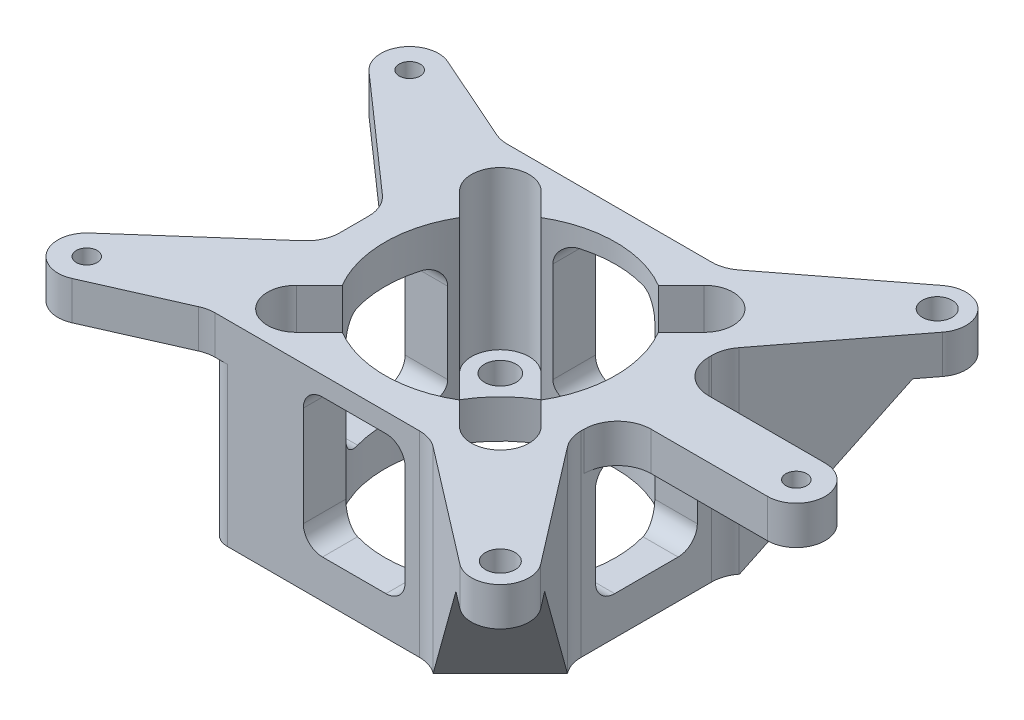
ISO-10303-21;
HEADER;
FILE_DESCRIPTION(('STEP AP214'),'2;1');
FILE_NAME('part.step','',(''),(''),'','','');
FILE_SCHEMA(('AUTOMOTIVE_DESIGN { 1 0 10303 214 1 1 1 1 }'));
ENDSEC;
DATA;
#1=APPLICATION_CONTEXT('core data for automotive mechanical design processes');
#2=APPLICATION_PROTOCOL_DEFINITION('international standard','automotive_design',2000,#1);
#3=PRODUCT_CONTEXT('',#1,'mechanical');
#4=PRODUCT('Part','Part','',(#3));
#5=PRODUCT_RELATED_PRODUCT_CATEGORY('part','',(#4));
#6=PRODUCT_DEFINITION_FORMATION('','',#4);
#7=PRODUCT_DEFINITION_CONTEXT('part definition',#1,'design');
#8=PRODUCT_DEFINITION('design','',#6,#7);
#9=PRODUCT_DEFINITION_SHAPE('','',#8);
#10=(LENGTH_UNIT() NAMED_UNIT(*) SI_UNIT(.MILLI.,.METRE.));
#11=(NAMED_UNIT(*) PLANE_ANGLE_UNIT() SI_UNIT($,.RADIAN.));
#12=(NAMED_UNIT(*) SI_UNIT($,.STERADIAN.) SOLID_ANGLE_UNIT());
#13=UNCERTAINTY_MEASURE_WITH_UNIT(LENGTH_MEASURE(1.E-05),#10,'distance_accuracy_value','');
#14=(GEOMETRIC_REPRESENTATION_CONTEXT(3) GLOBAL_UNCERTAINTY_ASSIGNED_CONTEXT((#13)) GLOBAL_UNIT_ASSIGNED_CONTEXT((#10,
#11,#12)) REPRESENTATION_CONTEXT('',''));
#15=CARTESIAN_POINT('',(0.,0.,0.));
#16=DIRECTION('',(0.,0.,1.));
#17=DIRECTION('',(1.,0.,0.));
#18=AXIS2_PLACEMENT_3D('',#15,#16,#17);
#19=CARTESIAN_POINT('',(-24.13,32.4104,-4.88184838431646));
#20=DIRECTION('',(1.,0.,0.));
#21=DIRECTION('',(0.,0.,-1.));
#22=AXIS2_PLACEMENT_3D('',#19,#20,#21);
#23=PLANE('',#22);
#24=DIRECTION('',(0.,-1.,0.));
#25=VECTOR('',#24,1.);
#26=CARTESIAN_POINT('',(-24.13,26.0604,-2.3736402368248));
#27=LINE('',#26,#25);
#28=CARTESIAN_POINT('',(-24.13,32.4104,-2.3736402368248));
#29=VERTEX_POINT('',#28);
#30=CARTESIAN_POINT('',(-24.13,26.0604,-2.3736402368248));
#31=VERTEX_POINT('',#30);
#32=EDGE_CURVE('E1448',#29,#31,#27,.T.);
#33=ORIENTED_EDGE('',*,*,#32,.T.);
#34=DIRECTION('',(0.,0.,-1.));
#35=VECTOR('',#34,1.);
#36=CARTESIAN_POINT('',(-24.13,26.0604,-5.23932191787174));
#37=LINE('',#36,#35);
#38=CARTESIAN_POINT('',(-24.13,26.0604,2.37364023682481));
#39=VERTEX_POINT('',#38);
#40=EDGE_CURVE('E580',#39,#31,#37,.T.);
#41=ORIENTED_EDGE('',*,*,#40,.F.);
#42=DIRECTION('',(0.,-1.,0.));
#43=VECTOR('',#42,1.);
#44=CARTESIAN_POINT('',(-24.13,32.4104,2.37364023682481));
#45=LINE('',#44,#43);
#46=CARTESIAN_POINT('',(-24.13,32.4104,2.37364023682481));
#47=VERTEX_POINT('',#46);
#48=EDGE_CURVE('E1450',#39,#47,#45,.F.);
#49=ORIENTED_EDGE('',*,*,#48,.T.);
#50=DIRECTION('',(0.,0.,1.));
#51=VECTOR('',#50,1.);
#52=CARTESIAN_POINT('',(-24.13,32.4104,-4.88184838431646));
#53=LINE('',#52,#51);
#54=EDGE_CURVE('E1293',#29,#47,#53,.T.);
#55=ORIENTED_EDGE('',*,*,#54,.F.);
#56=EDGE_LOOP('',(#33,#41,#49,#55));
#57=FACE_BOUND('',#56,.T.);
#58=ADVANCED_FACE('F39',(#57),#23,.F.);
#59=CARTESIAN_POINT('',(16.8402,32.4104,16.8402));
#60=DIRECTION('',(0.,1.,0.));
#61=DIRECTION('',(0.,0.,1.));
#62=AXIS2_PLACEMENT_3D('',#59,#60,#61);
#63=CYLINDRICAL_SURFACE('',#62,2.60984999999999);
#64=CARTESIAN_POINT('',(16.8402,0.,16.8402));
#65=DIRECTION('',(0.,1.,0.));
#66=DIRECTION('',(0.,0.,1.));
#67=AXIS2_PLACEMENT_3D('',#64,#65,#66);
#68=CIRCLE('',#67,2.60984999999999);
#69=CARTESIAN_POINT('',(16.8402,0.,19.45005));
#70=VERTEX_POINT('',#69);
#71=EDGE_CURVE('E1254',#70,#70,#68,.T.);
#72=ORIENTED_EDGE('',*,*,#71,.F.);
#73=EDGE_LOOP('',(#72));
#74=FACE_BOUND('',#73,.T.);
#75=CARTESIAN_POINT('',(16.8402,6.35,16.8402));
#76=DIRECTION('',(0.,1.,0.));
#77=DIRECTION('',(0.,0.,1.));
#78=AXIS2_PLACEMENT_3D('',#75,#76,#77);
#79=CIRCLE('',#78,2.60984999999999);
#80=CARTESIAN_POINT('',(16.8402,6.35,19.45005));
#81=VERTEX_POINT('',#80);
#82=EDGE_CURVE('E1169',#81,#81,#79,.F.);
#83=ORIENTED_EDGE('',*,*,#82,.F.);
#84=EDGE_LOOP('',(#83));
#85=FACE_BOUND('',#84,.T.);
#86=ADVANCED_FACE('F867',(#74,#85),#63,.F.);
#87=CARTESIAN_POINT('',(16.8402,32.4104,-16.8402));
#88=DIRECTION('',(0.,1.,0.));
#89=DIRECTION('',(0.,0.,1.));
#90=AXIS2_PLACEMENT_3D('',#87,#88,#89);
#91=CYLINDRICAL_SURFACE('',#90,2.60984999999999);
#92=CARTESIAN_POINT('',(16.8402,0.,-16.8402));
#93=DIRECTION('',(0.,1.,0.));
#94=DIRECTION('',(0.,0.,1.));
#95=AXIS2_PLACEMENT_3D('',#92,#93,#94);
#96=CIRCLE('',#95,2.60984999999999);
#97=CARTESIAN_POINT('',(16.8402,0.,-14.23035));
#98=VERTEX_POINT('',#97);
#99=EDGE_CURVE('E1251',#98,#98,#96,.T.);
#100=ORIENTED_EDGE('',*,*,#99,.F.);
#101=EDGE_LOOP('',(#100));
#102=FACE_BOUND('',#101,.T.);
#103=CARTESIAN_POINT('',(16.8402,6.35,-16.8402));
#104=DIRECTION('',(0.,1.,0.));
#105=DIRECTION('',(0.,0.,1.));
#106=AXIS2_PLACEMENT_3D('',#103,#104,#105);
#107=CIRCLE('',#106,2.60984999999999);
#108=CARTESIAN_POINT('',(16.8402,6.35,-14.23035));
#109=VERTEX_POINT('',#108);
#110=EDGE_CURVE('E1165',#109,#109,#107,.F.);
#111=ORIENTED_EDGE('',*,*,#110,.F.);
#112=EDGE_LOOP('',(#111));
#113=FACE_BOUND('',#112,.T.);
#114=ADVANCED_FACE('F873',(#102,#113),#91,.F.);
#115=CARTESIAN_POINT('',(-16.8402,32.4104,16.8402));
#116=DIRECTION('',(0.,1.,0.));
#117=DIRECTION('',(0.,0.,1.));
#118=AXIS2_PLACEMENT_3D('',#115,#116,#117);
#119=CYLINDRICAL_SURFACE('',#118,2.60984999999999);
#120=CARTESIAN_POINT('',(-16.8402,0.,16.8402));
#121=DIRECTION('',(0.,1.,0.));
#122=DIRECTION('',(0.,0.,1.));
#123=AXIS2_PLACEMENT_3D('',#120,#121,#122);
#124=CIRCLE('',#123,2.60985);
#125=CARTESIAN_POINT('',(-16.8402,0.,19.45005));
#126=VERTEX_POINT('',#125);
#127=EDGE_CURVE('E1245',#126,#126,#124,.T.);
#128=ORIENTED_EDGE('',*,*,#127,.F.);
#129=EDGE_LOOP('',(#128));
#130=FACE_BOUND('',#129,.T.);
#131=CARTESIAN_POINT('',(-16.8402,6.35,16.8402));
#132=DIRECTION('',(0.,1.,0.));
#133=DIRECTION('',(0.,0.,1.));
#134=AXIS2_PLACEMENT_3D('',#131,#132,#133);
#135=CIRCLE('',#134,2.60984999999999);
#136=CARTESIAN_POINT('',(-16.8402,6.35,19.45005));
#137=VERTEX_POINT('',#136);
#138=EDGE_CURVE('E1125',#137,#137,#135,.F.);
#139=ORIENTED_EDGE('',*,*,#138,.F.);
#140=EDGE_LOOP('',(#139));
#141=FACE_BOUND('',#140,.T.);
#142=ADVANCED_FACE('F1678',(#130,#141),#119,.F.);
#143=CARTESIAN_POINT('',(-16.8402,32.4104,-16.8402));
#144=DIRECTION('',(0.,1.,0.));
#145=DIRECTION('',(0.,0.,1.));
#146=AXIS2_PLACEMENT_3D('',#143,#144,#145);
#147=CYLINDRICAL_SURFACE('',#146,2.60984999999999);
#148=CARTESIAN_POINT('',(-16.8402,0.,-16.8402));
#149=DIRECTION('',(0.,1.,0.));
#150=DIRECTION('',(0.,0.,1.));
#151=AXIS2_PLACEMENT_3D('',#148,#149,#150);
#152=CIRCLE('',#151,2.60985);
#153=CARTESIAN_POINT('',(-16.8402,0.,-14.23035));
#154=VERTEX_POINT('',#153);
#155=EDGE_CURVE('E1248',#154,#154,#152,.T.);
#156=ORIENTED_EDGE('',*,*,#155,.F.);
#157=EDGE_LOOP('',(#156));
#158=FACE_BOUND('',#157,.T.);
#159=CARTESIAN_POINT('',(-16.8402,6.35,-16.8402));
#160=DIRECTION('',(0.,1.,0.));
#161=DIRECTION('',(0.,0.,1.));
#162=AXIS2_PLACEMENT_3D('',#159,#160,#161);
#163=CIRCLE('',#162,2.60984999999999);
#164=CARTESIAN_POINT('',(-16.8402,6.35,-14.23035));
#165=VERTEX_POINT('',#164);
#166=EDGE_CURVE('E1192',#165,#165,#163,.F.);
#167=ORIENTED_EDGE('',*,*,#166,.F.);
#168=EDGE_LOOP('',(#167));
#169=FACE_BOUND('',#168,.T.);
#170=ADVANCED_FACE('F1681',(#158,#169),#147,.F.);
#171=CARTESIAN_POINT('',(48.895,0.,0.));
#172=DIRECTION('',(0.,1.,0.));
#173=DIRECTION('',(0.,0.,1.));
#174=AXIS2_PLACEMENT_3D('',#171,#172,#173);
#175=PLANE('',#174);
#176=CARTESIAN_POINT('',(0.,0.,0.));
#177=DIRECTION('',(0.,1.,0.));
#178=DIRECTION('',(0.,0.,1.));
#179=AXIS2_PLACEMENT_3D('',#176,#177,#178);
#180=CIRCLE('',#179,19.0627);
#181=CARTESIAN_POINT('',(0.,0.,19.0627));
#182=VERTEX_POINT('',#181);
#183=EDGE_CURVE('E1257',#182,#182,#180,.T.);
#184=ORIENTED_EDGE('',*,*,#183,.T.);
#185=EDGE_LOOP('',(#184));
#186=FACE_BOUND('',#185,.T.);
#187=ORIENTED_EDGE('',*,*,#71,.T.);
#188=EDGE_LOOP('',(#187));
#189=FACE_BOUND('',#188,.T.);
#190=ORIENTED_EDGE('',*,*,#99,.T.);
#191=EDGE_LOOP('',(#190));
#192=FACE_BOUND('',#191,.T.);
#193=ORIENTED_EDGE('',*,*,#155,.T.);
#194=EDGE_LOOP('',(#193));
#195=FACE_BOUND('',#194,.T.);
#196=ORIENTED_EDGE('',*,*,#127,.T.);
#197=EDGE_LOOP('',(#196));
#198=FACE_BOUND('',#197,.T.);
#199=DIRECTION('',(1.,0.,0.));
#200=VECTOR('',#199,1.);
#201=CARTESIAN_POINT('',(-24.13,0.,24.13));
#202=LINE('',#201,#200);
#203=CARTESIAN_POINT('',(-20.955,0.,24.13));
#204=VERTEX_POINT('',#203);
#205=CARTESIAN_POINT('',(10.7954567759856,0.,24.13));
#206=VERTEX_POINT('',#205);
#207=EDGE_CURVE('E1326',#204,#206,#202,.T.);
#208=ORIENTED_EDGE('',*,*,#207,.F.);
#209=CARTESIAN_POINT('',(-20.955,0.,20.955));
#210=DIRECTION('',(0.,1.,0.));
#211=DIRECTION('',(0.,0.,1.));
#212=AXIS2_PLACEMENT_3D('',#209,#210,#211);
#213=CIRCLE('',#212,3.175);
#214=CARTESIAN_POINT('',(-24.13,0.,20.955));
#215=VERTEX_POINT('',#214);
#216=EDGE_CURVE('E1417',#204,#215,#213,.F.);
#217=ORIENTED_EDGE('',*,*,#216,.T.);
#218=DIRECTION('',(0.,0.,1.));
#219=VECTOR('',#218,1.);
#220=CARTESIAN_POINT('',(-24.13,0.,-4.88184838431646));
#221=LINE('',#220,#219);
#222=CARTESIAN_POINT('',(-24.13,0.,-20.955));
#223=VERTEX_POINT('',#222);
#224=EDGE_CURVE('E1323',#223,#215,#221,.T.);
#225=ORIENTED_EDGE('',*,*,#224,.F.);
#226=CARTESIAN_POINT('',(-20.955,0.,-20.955));
#227=DIRECTION('',(0.,1.,0.));
#228=DIRECTION('',(0.,0.,1.));
#229=AXIS2_PLACEMENT_3D('',#226,#227,#228);
#230=CIRCLE('',#229,3.175);
#231=CARTESIAN_POINT('',(-20.955,0.,-24.13));
#232=VERTEX_POINT('',#231);
#233=EDGE_CURVE('E1414',#223,#232,#230,.F.);
#234=ORIENTED_EDGE('',*,*,#233,.T.);
#235=DIRECTION('',(-1.,0.,0.));
#236=VECTOR('',#235,1.);
#237=CARTESIAN_POINT('',(-24.13,0.,-24.13));
#238=LINE('',#237,#236);
#239=CARTESIAN_POINT('',(10.7954567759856,0.,-24.13));
#240=VERTEX_POINT('',#239);
#241=EDGE_CURVE('E1321',#240,#232,#238,.T.);
#242=ORIENTED_EDGE('',*,*,#241,.F.);
#243=CARTESIAN_POINT('',(10.7954567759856,0.,-29.68625));
#244=DIRECTION('',(0.,1.,0.));
#245=DIRECTION('',(0.,0.,1.));
#246=AXIS2_PLACEMENT_3D('',#243,#244,#245);
#247=CIRCLE('',#246,5.55625);
#248=CARTESIAN_POINT('',(14.1778874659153,0.,-25.2781805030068));
#249=VERTEX_POINT('',#248);
#250=EDGE_CURVE('E1502',#240,#249,#247,.T.);
#251=ORIENTED_EDGE('',*,*,#250,.T.);
#252=DIRECTION('',(-0.793353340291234,0.,0.608761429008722));
#253=VECTOR('',#252,1.);
#254=CARTESIAN_POINT('',(33.1862005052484,0.,-39.8637720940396));
#255=LINE('',#254,#253);
#256=CARTESIAN_POINT('',(14.2101729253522,0.,-25.3029540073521));
#257=VERTEX_POINT('',#256);
#258=EDGE_CURVE('E1318',#257,#249,#255,.T.);
#259=ORIENTED_EDGE('',*,*,#258,.F.);
#260=DIRECTION('',(0.707106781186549,0.,0.707106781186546));
#261=VECTOR('',#260,1.);
#262=CARTESIAN_POINT('',(-23.866425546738,0.,-63.3795524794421));
#263=LINE('',#262,#261);
#264=CARTESIAN_POINT('',(25.302954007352,0.,-14.2101729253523));
#265=VERTEX_POINT('',#264);
#266=EDGE_CURVE('E1197',#257,#265,#263,.T.);
#267=ORIENTED_EDGE('',*,*,#266,.T.);
#268=DIRECTION('',(0.608761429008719,0.,-0.793353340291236));
#269=VECTOR('',#268,1.);
#270=CARTESIAN_POINT('',(39.8637720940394,0.,-33.1862005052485));
#271=LINE('',#270,#269);
#272=CARTESIAN_POINT('',(25.2781805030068,0.,-14.1778874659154));
#273=VERTEX_POINT('',#272);
#274=EDGE_CURVE('E1261',#273,#265,#271,.T.);
#275=ORIENTED_EDGE('',*,*,#274,.F.);
#276=CARTESIAN_POINT('',(29.68625,0.,-10.7954567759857));
#277=DIRECTION('',(0.,1.,0.));
#278=DIRECTION('',(0.,0.,1.));
#279=AXIS2_PLACEMENT_3D('',#276,#277,#278);
#280=CIRCLE('',#279,5.55625);
#281=CARTESIAN_POINT('',(24.13,0.,-10.7954567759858));
#282=VERTEX_POINT('',#281);
#283=EDGE_CURVE('E1506',#273,#282,#280,.T.);
#284=ORIENTED_EDGE('',*,*,#283,.T.);
#285=DIRECTION('',(0.,0.,-1.));
#286=VECTOR('',#285,1.);
#287=CARTESIAN_POINT('',(24.13,0.,4.7625));
#288=LINE('',#287,#286);
#289=CARTESIAN_POINT('',(24.13,0.,10.7954567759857));
#290=VERTEX_POINT('',#289);
#291=EDGE_CURVE('E1270',#290,#282,#288,.T.);
#292=ORIENTED_EDGE('',*,*,#291,.F.);
#293=CARTESIAN_POINT('',(29.68625,0.,10.7954567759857));
#294=DIRECTION('',(0.,1.,0.));
#295=DIRECTION('',(0.,0.,1.));
#296=AXIS2_PLACEMENT_3D('',#293,#294,#295);
#297=CIRCLE('',#296,5.55625);
#298=CARTESIAN_POINT('',(25.2781805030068,0.,14.1778874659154));
#299=VERTEX_POINT('',#298);
#300=EDGE_CURVE('E982',#290,#299,#297,.T.);
#301=ORIENTED_EDGE('',*,*,#300,.T.);
#302=DIRECTION('',(-0.608761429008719,0.,-0.793353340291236));
#303=VECTOR('',#302,1.);
#304=CARTESIAN_POINT('',(39.8637720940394,0.,33.1862005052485));
#305=LINE('',#304,#303);
#306=CARTESIAN_POINT('',(25.302954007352,0.,14.2101729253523));
#307=VERTEX_POINT('',#306);
#308=EDGE_CURVE('E1331',#307,#299,#305,.T.);
#309=ORIENTED_EDGE('',*,*,#308,.F.);
#310=DIRECTION('',(0.707106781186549,0.,-0.707106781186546));
#311=VECTOR('',#310,1.);
#312=CARTESIAN_POINT('',(-23.866425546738,0.,63.3795524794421));
#313=LINE('',#312,#311);
#314=CARTESIAN_POINT('',(14.2101729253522,0.,25.3029540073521));
#315=VERTEX_POINT('',#314);
#316=EDGE_CURVE('E1209',#315,#307,#313,.T.);
#317=ORIENTED_EDGE('',*,*,#316,.F.);
#318=DIRECTION('',(0.793353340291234,0.,0.608761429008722));
#319=VECTOR('',#318,1.);
#320=CARTESIAN_POINT('',(33.1862005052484,0.,39.8637720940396));
#321=LINE('',#320,#319);
#322=CARTESIAN_POINT('',(14.1778874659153,0.,25.2781805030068));
#323=VERTEX_POINT('',#322);
#324=EDGE_CURVE('E1329',#323,#315,#321,.T.);
#325=ORIENTED_EDGE('',*,*,#324,.F.);
#326=CARTESIAN_POINT('',(10.7954567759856,0.,29.68625));
#327=DIRECTION('',(0.,1.,0.));
#328=DIRECTION('',(0.,0.,1.));
#329=AXIS2_PLACEMENT_3D('',#326,#327,#328);
#330=CIRCLE('',#329,5.55625);
#331=EDGE_CURVE('E1481',#323,#206,#330,.T.);
#332=ORIENTED_EDGE('',*,*,#331,.T.);
#333=EDGE_LOOP('',(#208,#217,#225,#234,#242,#251,#259,#267,#275,#284,#292,#301,#309,#317,#325,#332));
#334=FACE_BOUND('',#333,.T.);
#335=ADVANCED_FACE('F917',(#186,#189,#192,#195,#198,#334),#175,.F.);
#336=CARTESIAN_POINT('',(39.8637720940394,32.4104,-33.1862005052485));
#337=DIRECTION('',(-0.793353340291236,0.,-0.608761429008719));
#338=DIRECTION('',(-0.608761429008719,0.,0.793353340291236));
#339=AXIS2_PLACEMENT_3D('',#336,#337,#338);
#340=PLANE('',#339);
#341=DIRECTION('',(0.608761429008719,0.,-0.793353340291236));
#342=VECTOR('',#341,1.);
#343=CARTESIAN_POINT('',(39.8637720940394,32.4104,-33.1862005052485));
#344=LINE('',#343,#342);
#345=CARTESIAN_POINT('',(25.2781805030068,32.4104,-14.1778874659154));
#346=VERTEX_POINT('',#345);
#347=CARTESIAN_POINT('',(39.8637720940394,32.4104,-33.1862005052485));
#348=VERTEX_POINT('',#347);
#349=EDGE_CURVE('E1276',#346,#348,#344,.T.);
#350=ORIENTED_EDGE('',*,*,#349,.F.);
#351=DIRECTION('',(0.,-1.,0.));
#352=VECTOR('',#351,1.);
#353=CARTESIAN_POINT('',(25.2781805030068,0.,-14.1778874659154));
#354=LINE('',#353,#352);
#355=EDGE_CURVE('E1464',#346,#273,#354,.T.);
#356=ORIENTED_EDGE('',*,*,#355,.T.);
#357=ORIENTED_EDGE('',*,*,#274,.T.);
#358=DIRECTION('',(-0.37535018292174,-0.787292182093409,0.489165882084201));
#359=VECTOR('',#358,1.);
#360=CARTESIAN_POINT('',(40.4161609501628,31.6997572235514,-33.9060876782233));
#361=LINE('',#360,#359);
#362=CARTESIAN_POINT('',(37.7275355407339,26.0604,-30.4022028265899));
#363=VERTEX_POINT('',#362);
#364=EDGE_CURVE('E1206',#363,#265,#361,.T.);
#365=ORIENTED_EDGE('',*,*,#364,.F.);
#366=DIRECTION('',(-0.608761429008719,0.,0.793353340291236));
#367=VECTOR('',#366,1.);
#368=CARTESIAN_POINT('',(39.8637720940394,26.0604,-33.1862005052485));
#369=LINE('',#368,#367);
#370=CARTESIAN_POINT('',(39.8637720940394,26.0604,-33.1862005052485));
#371=VERTEX_POINT('',#370);
#372=EDGE_CURVE('E1204',#371,#363,#369,.T.);
#373=ORIENTED_EDGE('',*,*,#372,.F.);
#374=DIRECTION('',(0.,-1.,0.));
#375=VECTOR('',#374,1.);
#376=CARTESIAN_POINT('',(39.8637720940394,32.4104,-33.1862005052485));
#377=LINE('',#376,#375);
#378=EDGE_CURVE('E1359',#348,#371,#377,.T.);
#379=ORIENTED_EDGE('',*,*,#378,.F.);
#380=EDGE_LOOP('',(#350,#356,#357,#365,#373,#379));
#381=FACE_BOUND('',#380,.T.);
#382=ADVANCED_FACE('F913',(#381),#340,.F.);
#383=CARTESIAN_POINT('',(36.0854268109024,32.4104,-36.0854268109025));
#384=DIRECTION('',(0.,-1.,0.));
#385=DIRECTION('',(0.,0.,-1.));
#386=AXIS2_PLACEMENT_3D('',#383,#384,#385);
#387=CYLINDRICAL_SURFACE('',#386,4.7625);
#388=CARTESIAN_POINT('',(36.0854268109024,26.0604,-36.0854268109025));
#389=DIRECTION('',(0.,-1.,0.));
#390=DIRECTION('',(0.,0.,-1.));
#391=AXIS2_PLACEMENT_3D('',#388,#389,#390);
#392=CIRCLE('',#391,4.7625);
#393=CARTESIAN_POINT('',(33.1862005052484,26.0604,-39.8637720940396));
#394=VERTEX_POINT('',#393);
#395=EDGE_CURVE('E1200',#394,#371,#392,.T.);
#396=ORIENTED_EDGE('',*,*,#395,.F.);
#397=DIRECTION('',(0.,-1.,0.));
#398=VECTOR('',#397,1.);
#399=CARTESIAN_POINT('',(33.1862005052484,32.4104,-39.8637720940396));
#400=LINE('',#399,#398);
#401=CARTESIAN_POINT('',(33.1862005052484,32.4104,-39.8637720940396));
#402=VERTEX_POINT('',#401);
#403=EDGE_CURVE('E1356',#402,#394,#400,.T.);
#404=ORIENTED_EDGE('',*,*,#403,.F.);
#405=CARTESIAN_POINT('',(36.0854268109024,32.4104,-36.0854268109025));
#406=DIRECTION('',(0.,1.,0.));
#407=DIRECTION('',(0.,0.,1.));
#408=AXIS2_PLACEMENT_3D('',#405,#406,#407);
#409=CIRCLE('',#408,4.7625);
#410=EDGE_CURVE('E1278',#348,#402,#409,.T.);
#411=ORIENTED_EDGE('',*,*,#410,.F.);
#412=ORIENTED_EDGE('',*,*,#378,.T.);
#413=EDGE_LOOP('',(#396,#404,#411,#412));
#414=FACE_BOUND('',#413,.T.);
#415=ADVANCED_FACE('F909',(#414),#387,.T.);
#416=CARTESIAN_POINT('',(33.1862005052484,32.4104,-39.8637720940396));
#417=DIRECTION('',(0.608761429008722,0.,0.793353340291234));
#418=DIRECTION('',(0.793353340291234,0.,-0.608761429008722));
#419=AXIS2_PLACEMENT_3D('',#416,#417,#418);
#420=PLANE('',#419);
#421=ORIENTED_EDGE('',*,*,#258,.T.);
#422=DIRECTION('',(0.,-1.,0.));
#423=VECTOR('',#422,1.);
#424=CARTESIAN_POINT('',(14.1778874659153,32.4104,-25.2781805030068));
#425=LINE('',#424,#423);
#426=CARTESIAN_POINT('',(14.1778874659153,32.4104,-25.2781805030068));
#427=VERTEX_POINT('',#426);
#428=EDGE_CURVE('E1462',#249,#427,#425,.F.);
#429=ORIENTED_EDGE('',*,*,#428,.T.);
#430=DIRECTION('',(-0.793353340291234,0.,0.608761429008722));
#431=VECTOR('',#430,1.);
#432=CARTESIAN_POINT('',(33.1862005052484,32.4104,-39.8637720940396));
#433=LINE('',#432,#431);
#434=EDGE_CURVE('E1280',#402,#427,#433,.T.);
#435=ORIENTED_EDGE('',*,*,#434,.F.);
#436=ORIENTED_EDGE('',*,*,#403,.T.);
#437=DIRECTION('',(0.793353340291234,0.,-0.608761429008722));
#438=VECTOR('',#437,1.);
#439=CARTESIAN_POINT('',(33.1862005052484,26.0604,-39.8637720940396));
#440=LINE('',#439,#438);
#441=CARTESIAN_POINT('',(30.4022028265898,26.0604,-37.727535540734));
#442=VERTEX_POINT('',#441);
#443=EDGE_CURVE('E1374',#442,#394,#440,.T.);
#444=ORIENTED_EDGE('',*,*,#443,.F.);
#445=DIRECTION('',(0.4891658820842,0.787292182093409,-0.375350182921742));
#446=VECTOR('',#445,1.);
#447=CARTESIAN_POINT('',(33.9060876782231,31.6997572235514,-40.4161609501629));
#448=LINE('',#447,#446);
#449=EDGE_CURVE('E1377',#257,#442,#448,.T.);
#450=ORIENTED_EDGE('',*,*,#449,.F.);
#451=EDGE_LOOP('',(#421,#429,#435,#436,#444,#450));
#452=FACE_BOUND('',#451,.T.);
#453=ADVANCED_FACE('F905',(#452),#420,.F.);
#454=CARTESIAN_POINT('',(48.895,32.4104,0.));
#455=DIRECTION('',(0.,1.,0.));
#456=DIRECTION('',(0.,0.,1.));
#457=AXIS2_PLACEMENT_3D('',#454,#455,#456);
#458=PLANE('',#457);
#459=CARTESIAN_POINT('',(36.0854268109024,32.4104,-36.0854268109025));
#460=DIRECTION('',(0.,1.,0.));
#461=DIRECTION('',(0.,0.,1.));
#462=AXIS2_PLACEMENT_3D('',#459,#460,#461);
#463=CIRCLE('',#462,2.45745);
#464=CARTESIAN_POINT('',(36.0854268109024,32.4104,-33.6279768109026));
#465=VERTEX_POINT('',#464);
#466=EDGE_CURVE('E1074',#465,#465,#463,.T.);
#467=ORIENTED_EDGE('',*,*,#466,.F.);
#468=EDGE_LOOP('',(#467));
#469=FACE_BOUND('',#468,.T.);
#470=CARTESIAN_POINT('',(36.0854268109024,32.4104,36.0854268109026));
#471=DIRECTION('',(0.,1.,0.));
#472=DIRECTION('',(0.,0.,1.));
#473=AXIS2_PLACEMENT_3D('',#470,#471,#472);
#474=CIRCLE('',#473,2.45745);
#475=CARTESIAN_POINT('',(36.0854268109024,32.4104,38.5428768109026));
#476=VERTEX_POINT('',#475);
#477=EDGE_CURVE('E1080',#476,#476,#474,.T.);
#478=ORIENTED_EDGE('',*,*,#477,.F.);
#479=EDGE_LOOP('',(#478));
#480=FACE_BOUND('',#479,.T.);
#481=CARTESIAN_POINT('',(-41.6355512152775,32.4104,-26.6699999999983));
#482=DIRECTION('',(0.,1.,0.));
#483=DIRECTION('',(0.,0.,1.));
#484=AXIS2_PLACEMENT_3D('',#481,#482,#483);
#485=CIRCLE('',#484,1.7272);
#486=CARTESIAN_POINT('',(-41.6355512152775,32.4104,-24.9427999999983));
#487=VERTEX_POINT('',#486);
#488=EDGE_CURVE('E1086',#487,#487,#485,.T.);
#489=ORIENTED_EDGE('',*,*,#488,.F.);
#490=EDGE_LOOP('',(#489));
#491=FACE_BOUND('',#490,.T.);
#492=CARTESIAN_POINT('',(-41.6355512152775,32.4104,26.6699999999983));
#493=DIRECTION('',(0.,1.,0.));
#494=DIRECTION('',(0.,0.,1.));
#495=AXIS2_PLACEMENT_3D('',#492,#493,#494);
#496=CIRCLE('',#495,1.7272);
#497=CARTESIAN_POINT('',(-41.6355512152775,32.4104,28.3971999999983));
#498=VERTEX_POINT('',#497);
#499=EDGE_CURVE('E1092',#498,#498,#496,.T.);
#500=ORIENTED_EDGE('',*,*,#499,.F.);
#501=EDGE_LOOP('',(#500));
#502=FACE_BOUND('',#501,.T.);
#503=CARTESIAN_POINT('',(48.895,32.4104,0.));
#504=DIRECTION('',(0.,1.,0.));
#505=DIRECTION('',(0.,0.,1.));
#506=AXIS2_PLACEMENT_3D('',#503,#504,#505);
#507=CIRCLE('',#506,1.7272);
#508=CARTESIAN_POINT('',(48.895,32.4104,1.7272));
#509=VERTEX_POINT('',#508);
#510=EDGE_CURVE('E1098',#509,#509,#507,.T.);
#511=ORIENTED_EDGE('',*,*,#510,.F.);
#512=EDGE_LOOP('',(#511));
#513=FACE_BOUND('',#512,.T.);
#514=DIRECTION('',(0.70710678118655,0.,-0.707106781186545));
#515=VECTOR('',#514,1.);
#516=CARTESIAN_POINT('',(14.8196423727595,32.4104,-8.08445028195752));
#517=LINE('',#516,#515);
#518=CARTESIAN_POINT('',(16.4195140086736,32.4104,-9.68432191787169));
#519=VERTEX_POINT('',#518);
#520=CARTESIAN_POINT('',(20.207796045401,32.4104,-13.472603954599));
#521=VERTEX_POINT('',#520);
#522=EDGE_CURVE('E1118',#519,#521,#517,.T.);
#523=ORIENTED_EDGE('',*,*,#522,.F.);
#524=CARTESIAN_POINT('',(0.,32.4104,0.));
#525=DIRECTION('',(0.,1.,0.));
#526=DIRECTION('',(0.,0.,1.));
#527=AXIS2_PLACEMENT_3D('',#524,#525,#526);
#528=CIRCLE('',#527,19.0627);
#529=CARTESIAN_POINT('',(16.4195140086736,32.4104,9.68432191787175));
#530=VERTEX_POINT('',#529);
#531=EDGE_CURVE('E1781',#530,#519,#528,.T.);
#532=ORIENTED_EDGE('',*,*,#531,.F.);
#533=DIRECTION('',(-0.707106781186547,0.,-0.707106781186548));
#534=VECTOR('',#533,1.);
#535=CARTESIAN_POINT('',(20.2077960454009,32.4104,13.4726039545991));
#536=LINE('',#535,#534);
#537=CARTESIAN_POINT('',(20.2077960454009,32.4104,13.4726039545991));
#538=VERTEX_POINT('',#537);
#539=EDGE_CURVE('E1135',#538,#530,#536,.T.);
#540=ORIENTED_EDGE('',*,*,#539,.F.);
#541=CARTESIAN_POINT('',(16.8402,32.4104,16.8402));
#542=DIRECTION('',(0.,1.,0.));
#543=DIRECTION('',(0.,0.,-1.));
#544=AXIS2_PLACEMENT_3D('',#541,#542,#543);
#545=CIRCLE('',#544,4.7625);
#546=CARTESIAN_POINT('',(13.4726039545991,32.4104,20.2077960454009));
#547=VERTEX_POINT('',#546);
#548=EDGE_CURVE('E1132',#547,#538,#545,.T.);
#549=ORIENTED_EDGE('',*,*,#548,.F.);
#550=DIRECTION('',(0.707106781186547,0.,0.707106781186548));
#551=VECTOR('',#550,1.);
#552=CARTESIAN_POINT('',(8.08445028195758,32.4104,14.8196423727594));
#553=LINE('',#552,#551);
#554=CARTESIAN_POINT('',(9.68432191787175,32.4104,16.4195140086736));
#555=VERTEX_POINT('',#554);
#556=EDGE_CURVE('E1138',#555,#547,#553,.T.);
#557=ORIENTED_EDGE('',*,*,#556,.F.);
#558=CARTESIAN_POINT('',(-9.68432191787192,32.4104,16.4195140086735));
#559=VERTEX_POINT('',#558);
#560=EDGE_CURVE('E1262',#559,#555,#528,.T.);
#561=ORIENTED_EDGE('',*,*,#560,.F.);
#562=DIRECTION('',(0.707106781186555,0.,-0.70710678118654));
#563=VECTOR('',#562,1.);
#564=CARTESIAN_POINT('',(-13.4726039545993,32.4104,20.2077960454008));
#565=LINE('',#564,#563);
#566=CARTESIAN_POINT('',(-13.4726039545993,32.4104,20.2077960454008));
#567=VERTEX_POINT('',#566);
#568=EDGE_CURVE('E1153',#567,#559,#565,.T.);
#569=ORIENTED_EDGE('',*,*,#568,.F.);
#570=CARTESIAN_POINT('',(-16.8402000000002,32.4104,16.8401999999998));
#571=DIRECTION('',(0.,1.,0.));
#572=DIRECTION('',(1.,0.,0.));
#573=AXIS2_PLACEMENT_3D('',#570,#571,#572);
#574=CIRCLE('',#573,4.7625);
#575=CARTESIAN_POINT('',(-20.2077960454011,32.4104,13.4726039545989));
#576=VERTEX_POINT('',#575);
#577=EDGE_CURVE('E1104',#576,#567,#574,.T.);
#578=ORIENTED_EDGE('',*,*,#577,.F.);
#579=DIRECTION('',(-0.707106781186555,0.,0.70710678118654));
#580=VECTOR('',#579,1.);
#581=CARTESIAN_POINT('',(-14.8196423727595,32.4104,8.08445028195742));
#582=LINE('',#581,#580);
#583=CARTESIAN_POINT('',(-16.4195140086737,32.4104,9.68432191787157));
#584=VERTEX_POINT('',#583);
#585=EDGE_CURVE('E1155',#584,#576,#582,.T.);
#586=ORIENTED_EDGE('',*,*,#585,.F.);
#587=CARTESIAN_POINT('',(-16.4195140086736,32.4104,-9.68432191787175));
#588=VERTEX_POINT('',#587);
#589=EDGE_CURVE('E1258',#588,#584,#528,.T.);
#590=ORIENTED_EDGE('',*,*,#589,.F.);
#591=DIRECTION('',(0.707106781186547,0.,0.707106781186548));
#592=VECTOR('',#591,1.);
#593=CARTESIAN_POINT('',(-20.2077960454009,32.4104,-13.4726039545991));
#594=LINE('',#593,#592);
#595=CARTESIAN_POINT('',(-20.2077960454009,32.4104,-13.4726039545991));
#596=VERTEX_POINT('',#595);
#597=EDGE_CURVE('E1183',#596,#588,#594,.T.);
#598=ORIENTED_EDGE('',*,*,#597,.F.);
#599=CARTESIAN_POINT('',(-16.8402,32.4104,-16.8402));
#600=DIRECTION('',(0.,1.,0.));
#601=DIRECTION('',(0.,0.,1.));
#602=AXIS2_PLACEMENT_3D('',#599,#600,#601);
#603=CIRCLE('',#602,4.7625);
#604=CARTESIAN_POINT('',(-13.4726039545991,32.4104,-20.2077960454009));
#605=VERTEX_POINT('',#604);
#606=EDGE_CURVE('E1173',#605,#596,#603,.T.);
#607=ORIENTED_EDGE('',*,*,#606,.F.);
#608=DIRECTION('',(-0.707106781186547,0.,-0.707106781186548));
#609=VECTOR('',#608,1.);
#610=CARTESIAN_POINT('',(-8.08445028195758,32.4104,-14.8196423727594));
#611=LINE('',#610,#609);
#612=CARTESIAN_POINT('',(-9.68432191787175,32.4104,-16.4195140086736));
#613=VERTEX_POINT('',#612);
#614=EDGE_CURVE('E1185',#613,#605,#611,.T.);
#615=ORIENTED_EDGE('',*,*,#614,.F.);
#616=CARTESIAN_POINT('',(9.6843219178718,32.4104,-16.4195140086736));
#617=VERTEX_POINT('',#616);
#618=EDGE_CURVE('E1263',#617,#613,#528,.T.);
#619=ORIENTED_EDGE('',*,*,#618,.F.);
#620=DIRECTION('',(-0.70710678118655,0.,0.707106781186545));
#621=VECTOR('',#620,1.);
#622=CARTESIAN_POINT('',(13.4726039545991,32.4104,-20.2077960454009));
#623=LINE('',#622,#621);
#624=CARTESIAN_POINT('',(13.4726039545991,32.4104,-20.2077960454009));
#625=VERTEX_POINT('',#624);
#626=EDGE_CURVE('E1115',#625,#617,#623,.T.);
#627=ORIENTED_EDGE('',*,*,#626,.F.);
#628=CARTESIAN_POINT('',(16.8402000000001,32.4104,-16.8401999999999));
#629=DIRECTION('',(0.,1.,0.));
#630=DIRECTION('',(-1.,0.,0.));
#631=AXIS2_PLACEMENT_3D('',#628,#629,#630);
#632=CIRCLE('',#631,4.7625);
#633=EDGE_CURVE('E1112',#521,#625,#632,.T.);
#634=ORIENTED_EDGE('',*,*,#633,.F.);
#635=EDGE_LOOP('',(#523,#532,#540,#549,#557,#561,#569,#578,#586,#590,#598,#607,#615,#619,#627,#634));
#636=FACE_BOUND('',#635,.T.);
#637=CARTESIAN_POINT('',(48.895,32.4104,0.));
#638=DIRECTION('',(0.,1.,0.));
#639=DIRECTION('',(0.,0.,1.));
#640=AXIS2_PLACEMENT_3D('',#637,#638,#639);
#641=CIRCLE('',#640,4.7625);
#642=CARTESIAN_POINT('',(48.895,32.4104,4.7625));
#643=VERTEX_POINT('',#642);
#644=CARTESIAN_POINT('',(48.895,32.4104,-4.7625));
#645=VERTEX_POINT('',#644);
#646=EDGE_CURVE('E1266',#643,#645,#641,.T.);
#647=ORIENTED_EDGE('',*,*,#646,.T.);
#648=DIRECTION('',(-1.,0.,0.));
#649=VECTOR('',#648,1.);
#650=CARTESIAN_POINT('',(48.895,32.4104,-4.7625));
#651=LINE('',#650,#649);
#652=CARTESIAN_POINT('',(29.68625,32.4104,-4.7625));
#653=VERTEX_POINT('',#652);
#654=EDGE_CURVE('E1269',#645,#653,#651,.T.);
#655=ORIENTED_EDGE('',*,*,#654,.T.);
#656=CARTESIAN_POINT('',(29.68625,32.4104,-10.31875));
#657=DIRECTION('',(0.,1.,0.));
#658=DIRECTION('',(0.,0.,1.));
#659=AXIS2_PLACEMENT_3D('',#656,#657,#658);
#660=CIRCLE('',#659,5.55625);
#661=CARTESIAN_POINT('',(24.13,32.4104,-10.31875));
#662=VERTEX_POINT('',#661);
#663=EDGE_CURVE('E987',#653,#662,#660,.F.);
#664=ORIENTED_EDGE('',*,*,#663,.T.);
#665=DIRECTION('',(0.,0.,-1.));
#666=VECTOR('',#665,1.);
#667=CARTESIAN_POINT('',(24.13,32.4104,-12.6815495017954));
#668=LINE('',#667,#666);
#669=CARTESIAN_POINT('',(24.13,32.4104,-10.7954567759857));
#670=VERTEX_POINT('',#669);
#671=EDGE_CURVE('E1273',#662,#670,#668,.T.);
#672=ORIENTED_EDGE('',*,*,#671,.T.);
#673=CARTESIAN_POINT('',(29.68625,32.4104,-10.7954567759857));
#674=DIRECTION('',(0.,1.,0.));
#675=DIRECTION('',(0.,0.,1.));
#676=AXIS2_PLACEMENT_3D('',#673,#674,#675);
#677=CIRCLE('',#676,5.55625);
#678=EDGE_CURVE('E1508',#670,#346,#677,.F.);
#679=ORIENTED_EDGE('',*,*,#678,.T.);
#680=ORIENTED_EDGE('',*,*,#349,.T.);
#681=ORIENTED_EDGE('',*,*,#410,.T.);
#682=ORIENTED_EDGE('',*,*,#434,.T.);
#683=CARTESIAN_POINT('',(10.7954567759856,32.4104,-29.68625));
#684=DIRECTION('',(0.,1.,0.));
#685=DIRECTION('',(0.,0.,1.));
#686=AXIS2_PLACEMENT_3D('',#683,#684,#685);
#687=CIRCLE('',#686,5.55625);
#688=CARTESIAN_POINT('',(10.7954567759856,32.4104,-24.13));
#689=VERTEX_POINT('',#688);
#690=EDGE_CURVE('E1504',#427,#689,#687,.F.);
#691=ORIENTED_EDGE('',*,*,#690,.T.);
#692=DIRECTION('',(-1.,0.,0.));
#693=VECTOR('',#692,1.);
#694=CARTESIAN_POINT('',(-24.13,32.4104,-24.13));
#695=LINE('',#694,#693);
#696=CARTESIAN_POINT('',(-22.9553310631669,32.4104,-24.13));
#697=VERTEX_POINT('',#696);
#698=EDGE_CURVE('E1283',#689,#697,#695,.T.);
#699=ORIENTED_EDGE('',*,*,#698,.T.);
#700=CARTESIAN_POINT('',(-22.9553310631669,32.4104,-29.68625));
#701=DIRECTION('',(0.,1.,0.));
#702=DIRECTION('',(0.,0.,1.));
#703=AXIS2_PLACEMENT_3D('',#700,#701,#702);
#704=CIRCLE('',#703,5.55625);
#705=CARTESIAN_POINT('',(-25.2041557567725,32.4104,-24.6054329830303));
#706=VERTEX_POINT('',#705);
#707=EDGE_CURVE('E1500',#697,#706,#704,.F.);
#708=ORIENTED_EDGE('',*,*,#707,.T.);
#709=DIRECTION('',(-0.914432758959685,0.,-0.404737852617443));
#710=VECTOR('',#709,1.);
#711=CARTESIAN_POINT('',(-39.7079871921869,32.4104,-31.0249860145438));
#712=LINE('',#711,#710);
#713=CARTESIAN_POINT('',(-39.7079871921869,32.4104,-31.0249860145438));
#714=VERTEX_POINT('',#713);
#715=EDGE_CURVE('E1286',#706,#714,#712,.T.);
#716=ORIENTED_EDGE('',*,*,#715,.T.);
#717=CARTESIAN_POINT('',(-41.6355512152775,32.4104,-26.6699999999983));
#718=DIRECTION('',(0.,1.,0.));
#719=DIRECTION('',(0.,0.,1.));
#720=AXIS2_PLACEMENT_3D('',#717,#718,#719);
#721=CIRCLE('',#720,4.7625);
#722=CARTESIAN_POINT('',(-44.78562032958,32.4104,-23.0980998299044));
#723=VERTEX_POINT('',#722);
#724=EDGE_CURVE('E1288',#714,#723,#721,.T.);
#725=ORIENTED_EDGE('',*,*,#724,.T.);
#726=DIRECTION('',(0.750005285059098,0.,0.661431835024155));
#727=VECTOR('',#726,1.);
#728=CARTESIAN_POINT('',(-44.78562032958,32.4104,-23.0980998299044));
#729=LINE('',#728,#727);
#730=CARTESIAN_POINT('',(-26.011169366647,32.4104,-6.54085710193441));
#731=VERTEX_POINT('',#730);
#732=EDGE_CURVE('E1290',#723,#731,#729,.T.);
#733=ORIENTED_EDGE('',*,*,#732,.T.);
#734=CARTESIAN_POINT('',(-29.68625,32.4104,-2.3736402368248));
#735=DIRECTION('',(0.,1.,0.));
#736=DIRECTION('',(0.,0.,1.));
#737=AXIS2_PLACEMENT_3D('',#734,#735,#736);
#738=CIRCLE('',#737,5.55625);
#739=EDGE_CURVE('E1496',#731,#29,#738,.F.);
#740=ORIENTED_EDGE('',*,*,#739,.T.);
#741=ORIENTED_EDGE('',*,*,#54,.T.);
#742=CARTESIAN_POINT('',(-29.68625,32.4104,2.37364023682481));
#743=DIRECTION('',(0.,1.,0.));
#744=DIRECTION('',(0.,0.,1.));
#745=AXIS2_PLACEMENT_3D('',#742,#743,#744);
#746=CIRCLE('',#745,5.55625);
#747=CARTESIAN_POINT('',(-26.011169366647,32.4104,6.54085710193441));
#748=VERTEX_POINT('',#747);
#749=EDGE_CURVE('E1492',#47,#748,#746,.F.);
#750=ORIENTED_EDGE('',*,*,#749,.T.);
#751=DIRECTION('',(-0.750005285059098,0.,0.661431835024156));
#752=VECTOR('',#751,1.);
#753=CARTESIAN_POINT('',(-44.78562032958,32.4104,23.0980998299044));
#754=LINE('',#753,#752);
#755=CARTESIAN_POINT('',(-44.78562032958,32.4104,23.0980998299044));
#756=VERTEX_POINT('',#755);
#757=EDGE_CURVE('E1296',#748,#756,#754,.T.);
#758=ORIENTED_EDGE('',*,*,#757,.T.);
#759=CARTESIAN_POINT('',(-41.6355512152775,32.4104,26.6699999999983));
#760=DIRECTION('',(0.,1.,0.));
#761=DIRECTION('',(0.,0.,-1.));
#762=AXIS2_PLACEMENT_3D('',#759,#760,#761);
#763=CIRCLE('',#762,4.7625);
#764=CARTESIAN_POINT('',(-39.7079871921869,32.4104,31.0249860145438));
#765=VERTEX_POINT('',#764);
#766=EDGE_CURVE('E1298',#756,#765,#763,.T.);
#767=ORIENTED_EDGE('',*,*,#766,.T.);
#768=DIRECTION('',(0.914432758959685,0.,-0.404737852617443));
#769=VECTOR('',#768,1.);
#770=CARTESIAN_POINT('',(-39.7079871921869,32.4104,31.0249860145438));
#771=LINE('',#770,#769);
#772=CARTESIAN_POINT('',(-25.2041557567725,32.4104,24.6054329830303));
#773=VERTEX_POINT('',#772);
#774=EDGE_CURVE('E1300',#765,#773,#771,.T.);
#775=ORIENTED_EDGE('',*,*,#774,.T.);
#776=CARTESIAN_POINT('',(-22.9553310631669,32.4104,29.68625));
#777=DIRECTION('',(0.,1.,0.));
#778=DIRECTION('',(0.,0.,1.));
#779=AXIS2_PLACEMENT_3D('',#776,#777,#778);
#780=CIRCLE('',#779,5.55625);
#781=CARTESIAN_POINT('',(-22.9553310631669,32.4104,24.13));
#782=VERTEX_POINT('',#781);
#783=EDGE_CURVE('E1487',#773,#782,#780,.F.);
#784=ORIENTED_EDGE('',*,*,#783,.T.);
#785=DIRECTION('',(1.,0.,0.));
#786=VECTOR('',#785,1.);
#787=CARTESIAN_POINT('',(-24.13,32.4104,24.13));
#788=LINE('',#787,#786);
#789=CARTESIAN_POINT('',(10.7954567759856,32.4104,24.13));
#790=VERTEX_POINT('',#789);
#791=EDGE_CURVE('E1303',#782,#790,#788,.T.);
#792=ORIENTED_EDGE('',*,*,#791,.T.);
#793=CARTESIAN_POINT('',(10.7954567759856,32.4104,29.68625));
#794=DIRECTION('',(0.,1.,0.));
#795=DIRECTION('',(0.,0.,1.));
#796=AXIS2_PLACEMENT_3D('',#793,#794,#795);
#797=CIRCLE('',#796,5.55625);
#798=CARTESIAN_POINT('',(14.1778874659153,32.4104,25.2781805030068));
#799=VERTEX_POINT('',#798);
#800=EDGE_CURVE('E1483',#790,#799,#797,.F.);
#801=ORIENTED_EDGE('',*,*,#800,.T.);
#802=DIRECTION('',(0.793353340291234,0.,0.608761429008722));
#803=VECTOR('',#802,1.);
#804=CARTESIAN_POINT('',(33.1862005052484,32.4104,39.8637720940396));
#805=LINE('',#804,#803);
#806=CARTESIAN_POINT('',(33.1862005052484,32.4104,39.8637720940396));
#807=VERTEX_POINT('',#806);
#808=EDGE_CURVE('E1306',#799,#807,#805,.T.);
#809=ORIENTED_EDGE('',*,*,#808,.T.);
#810=CARTESIAN_POINT('',(36.0854268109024,32.4104,36.0854268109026));
#811=DIRECTION('',(0.,1.,0.));
#812=DIRECTION('',(0.,0.,-1.));
#813=AXIS2_PLACEMENT_3D('',#810,#811,#812);
#814=CIRCLE('',#813,4.7625);
#815=CARTESIAN_POINT('',(39.8637720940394,32.4104,33.1862005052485));
#816=VERTEX_POINT('',#815);
#817=EDGE_CURVE('E1308',#807,#816,#814,.T.);
#818=ORIENTED_EDGE('',*,*,#817,.T.);
#819=DIRECTION('',(-0.608761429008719,0.,-0.793353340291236));
#820=VECTOR('',#819,1.);
#821=CARTESIAN_POINT('',(39.8637720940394,32.4104,33.1862005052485));
#822=LINE('',#821,#820);
#823=CARTESIAN_POINT('',(25.2781805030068,32.4104,14.1778874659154));
#824=VERTEX_POINT('',#823);
#825=EDGE_CURVE('E1310',#816,#824,#822,.T.);
#826=ORIENTED_EDGE('',*,*,#825,.T.);
#827=CARTESIAN_POINT('',(29.68625,32.4104,10.7954567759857));
#828=DIRECTION('',(0.,1.,0.));
#829=DIRECTION('',(0.,0.,1.));
#830=AXIS2_PLACEMENT_3D('',#827,#828,#829);
#831=CIRCLE('',#830,5.55625);
#832=CARTESIAN_POINT('',(24.13,32.4104,10.7954567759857));
#833=VERTEX_POINT('',#832);
#834=EDGE_CURVE('E985',#824,#833,#831,.F.);
#835=ORIENTED_EDGE('',*,*,#834,.T.);
#836=DIRECTION('',(0.,0.,-1.));
#837=VECTOR('',#836,1.);
#838=CARTESIAN_POINT('',(24.13,32.4104,4.7625));
#839=LINE('',#838,#837);
#840=CARTESIAN_POINT('',(24.13,32.4104,10.31875));
#841=VERTEX_POINT('',#840);
#842=EDGE_CURVE('E1312',#833,#841,#839,.T.);
#843=ORIENTED_EDGE('',*,*,#842,.T.);
#844=CARTESIAN_POINT('',(29.68625,32.4104,10.31875));
#845=DIRECTION('',(0.,1.,0.));
#846=DIRECTION('',(0.,0.,1.));
#847=AXIS2_PLACEMENT_3D('',#844,#845,#846);
#848=CIRCLE('',#847,5.55625);
#849=CARTESIAN_POINT('',(29.68625,32.4104,4.7625));
#850=VERTEX_POINT('',#849);
#851=EDGE_CURVE('E975',#841,#850,#848,.F.);
#852=ORIENTED_EDGE('',*,*,#851,.T.);
#853=DIRECTION('',(1.,0.,0.));
#854=VECTOR('',#853,1.);
#855=CARTESIAN_POINT('',(24.13,32.4104,4.7625));
#856=LINE('',#855,#854);
#857=EDGE_CURVE('E1314',#850,#643,#856,.T.);
#858=ORIENTED_EDGE('',*,*,#857,.T.);
#859=EDGE_LOOP('',(#647,#655,#664,#672,#679,#680,#681,#682,#691,#699,#708,#716,#725,#733,#740,
#741,#750,#758,#767,#775,#784,#792,#801,#809,#818,#826,#835,#843,#852,#858));
#860=FACE_BOUND('',#859,.T.);
#861=ADVANCED_FACE('F908',(#469,#480,#491,#502,#513,#636,#860),#458,.T.);
#862=CARTESIAN_POINT('',(48.895,32.4104,0.));
#863=DIRECTION('',(0.,-1.,0.));
#864=DIRECTION('',(0.,0.,-1.));
#865=AXIS2_PLACEMENT_3D('',#862,#863,#864);
#866=CYLINDRICAL_SURFACE('',#865,4.7625);
#867=DIRECTION('',(0.,-1.,0.));
#868=VECTOR('',#867,1.);
#869=CARTESIAN_POINT('',(48.895,32.4104,4.7625));
#870=LINE('',#869,#868);
#871=CARTESIAN_POINT('',(48.895,26.0604,4.76249999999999));
#872=VERTEX_POINT('',#871);
#873=EDGE_CURVE('E1316',#643,#872,#870,.T.);
#874=ORIENTED_EDGE('',*,*,#873,.T.);
#875=CARTESIAN_POINT('',(48.895,26.0604,0.));
#876=DIRECTION('',(0.,1.,0.));
#877=DIRECTION('',(0.,0.,1.));
#878=AXIS2_PLACEMENT_3D('',#875,#876,#877);
#879=CIRCLE('',#878,4.7625);
#880=CARTESIAN_POINT('',(48.895,26.0604,-4.7625));
#881=VERTEX_POINT('',#880);
#882=EDGE_CURVE('E1232',#881,#872,#879,.F.);
#883=ORIENTED_EDGE('',*,*,#882,.F.);
#884=DIRECTION('',(0.,-1.,0.));
#885=VECTOR('',#884,1.);
#886=CARTESIAN_POINT('',(48.895,32.4104,-4.7625));
#887=LINE('',#886,#885);
#888=EDGE_CURVE('E1362',#645,#881,#887,.T.);
#889=ORIENTED_EDGE('',*,*,#888,.F.);
#890=ORIENTED_EDGE('',*,*,#646,.F.);
#891=EDGE_LOOP('',(#874,#883,#889,#890));
#892=FACE_BOUND('',#891,.T.);
#893=ADVANCED_FACE('F921',(#892),#866,.T.);
#894=CARTESIAN_POINT('',(48.895,32.4104,-4.7625));
#895=DIRECTION('',(0.,0.,1.));
#896=DIRECTION('',(1.,0.,0.));
#897=AXIS2_PLACEMENT_3D('',#894,#895,#896);
#898=PLANE('',#897);
#899=DIRECTION('',(1.,0.,0.));
#900=VECTOR('',#899,1.);
#901=CARTESIAN_POINT('',(24.13,26.0604,-4.7625));
#902=LINE('',#901,#900);
#903=CARTESIAN_POINT('',(29.68625,26.0604,-4.7625));
#904=VERTEX_POINT('',#903);
#905=EDGE_CURVE('E1229',#904,#881,#902,.T.);
#906=ORIENTED_EDGE('',*,*,#905,.F.);
#907=DIRECTION('',(0.,-1.,0.));
#908=VECTOR('',#907,1.);
#909=CARTESIAN_POINT('',(29.68625,32.4104,-4.7625));
#910=LINE('',#909,#908);
#911=EDGE_CURVE('E1476',#904,#653,#910,.F.);
#912=ORIENTED_EDGE('',*,*,#911,.T.);
#913=ORIENTED_EDGE('',*,*,#654,.F.);
#914=ORIENTED_EDGE('',*,*,#888,.T.);
#915=EDGE_LOOP('',(#906,#912,#913,#914));
#916=FACE_BOUND('',#915,.T.);
#917=ADVANCED_FACE('F903',(#916),#898,.F.);
#918=CARTESIAN_POINT('',(-24.13,32.4104,-24.13));
#919=DIRECTION('',(0.,0.,1.));
#920=DIRECTION('',(1.,0.,0.));
#921=AXIS2_PLACEMENT_3D('',#918,#919,#920);
#922=PLANE('',#921);
#923=DIRECTION('',(0.,-1.,0.));
#924=VECTOR('',#923,1.);
#925=CARTESIAN_POINT('',(-8.41432191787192,32.4104,-24.13));
#926=LINE('',#925,#924);
#927=CARTESIAN_POINT('',(-8.41432191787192,26.0604,-24.13));
#928=VERTEX_POINT('',#927);
#929=CARTESIAN_POINT('',(-8.41432191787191,9.525,-24.13));
#930=VERTEX_POINT('',#929);
#931=EDGE_CURVE('E1068',#928,#930,#926,.T.);
#932=ORIENTED_EDGE('',*,*,#931,.T.);
#933=CARTESIAN_POINT('',(-5.23932191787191,9.525,-24.13));
#934=DIRECTION('',(0.,0.,1.));
#935=DIRECTION('',(1.,0.,0.));
#936=AXIS2_PLACEMENT_3D('',#933,#934,#935);
#937=CIRCLE('',#936,3.175);
#938=CARTESIAN_POINT('',(-5.23932191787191,6.35,-24.13));
#939=VERTEX_POINT('',#938);
#940=EDGE_CURVE('E1071',#930,#939,#937,.T.);
#941=ORIENTED_EDGE('',*,*,#940,.T.);
#942=DIRECTION('',(1.,0.,0.));
#943=VECTOR('',#942,1.);
#944=CARTESIAN_POINT('',(-24.13,6.35,-24.13));
#945=LINE('',#944,#943);
#946=CARTESIAN_POINT('',(5.23932191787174,6.35,-24.13));
#947=VERTEX_POINT('',#946);
#948=EDGE_CURVE('E1049',#939,#947,#945,.T.);
#949=ORIENTED_EDGE('',*,*,#948,.T.);
#950=CARTESIAN_POINT('',(5.23932191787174,9.525,-24.13));
#951=DIRECTION('',(0.,0.,1.));
#952=DIRECTION('',(1.,0.,0.));
#953=AXIS2_PLACEMENT_3D('',#950,#951,#952);
#954=CIRCLE('',#953,3.175);
#955=CARTESIAN_POINT('',(8.41432191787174,9.525,-24.13));
#956=VERTEX_POINT('',#955);
#957=EDGE_CURVE('E1052',#947,#956,#954,.T.);
#958=ORIENTED_EDGE('',*,*,#957,.T.);
#959=DIRECTION('',(0.,1.,0.));
#960=VECTOR('',#959,1.);
#961=CARTESIAN_POINT('',(8.41432191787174,32.4104,-24.13));
#962=LINE('',#961,#960);
#963=CARTESIAN_POINT('',(8.41432191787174,26.0604,-24.13));
#964=VERTEX_POINT('',#963);
#965=EDGE_CURVE('E1056',#956,#964,#962,.T.);
#966=ORIENTED_EDGE('',*,*,#965,.T.);
#967=CARTESIAN_POINT('',(5.23932191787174,26.0604,-24.13));
#968=DIRECTION('',(0.,0.,1.));
#969=DIRECTION('',(1.,0.,0.));
#970=AXIS2_PLACEMENT_3D('',#967,#968,#969);
#971=CIRCLE('',#970,3.175);
#972=CARTESIAN_POINT('',(5.23932191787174,29.2354,-24.13));
#973=VERTEX_POINT('',#972);
#974=EDGE_CURVE('E1059',#964,#973,#971,.T.);
#975=ORIENTED_EDGE('',*,*,#974,.T.);
#976=DIRECTION('',(-1.,0.,0.));
#977=VECTOR('',#976,1.);
#978=CARTESIAN_POINT('',(-24.13,29.2354,-24.13));
#979=LINE('',#978,#977);
#980=CARTESIAN_POINT('',(-5.23932191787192,29.2354,-24.13));
#981=VERTEX_POINT('',#980);
#982=EDGE_CURVE('E1062',#973,#981,#979,.T.);
#983=ORIENTED_EDGE('',*,*,#982,.T.);
#984=CARTESIAN_POINT('',(-5.23932191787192,26.0604,-24.13));
#985=DIRECTION('',(0.,0.,1.));
#986=DIRECTION('',(1.,0.,0.));
#987=AXIS2_PLACEMENT_3D('',#984,#985,#986);
#988=CIRCLE('',#987,3.175);
#989=EDGE_CURVE('E1065',#981,#928,#988,.T.);
#990=ORIENTED_EDGE('',*,*,#989,.T.);
#991=EDGE_LOOP('',(#932,#941,#949,#958,#966,#975,#983,#990));
#992=FACE_BOUND('',#991,.T.);
#993=DIRECTION('',(-1.,0.,0.));
#994=VECTOR('',#993,1.);
#995=CARTESIAN_POINT('',(-24.13,26.0604,-24.13));
#996=LINE('',#995,#994);
#997=CARTESIAN_POINT('',(-20.955,26.0604,-24.13));
#998=VERTEX_POINT('',#997);
#999=CARTESIAN_POINT('',(-22.9553310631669,26.0604,-24.13));
#1000=VERTEX_POINT('',#999);
#1001=EDGE_CURVE('E1424',#998,#1000,#996,.T.);
#1002=ORIENTED_EDGE('',*,*,#1001,.T.);
#1003=DIRECTION('',(0.,-1.,0.));
#1004=VECTOR('',#1003,1.);
#1005=CARTESIAN_POINT('',(-22.9553310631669,32.4104,-24.13));
#1006=LINE('',#1005,#1004);
#1007=EDGE_CURVE('E1460',#1000,#697,#1006,.F.);
#1008=ORIENTED_EDGE('',*,*,#1007,.T.);
#1009=ORIENTED_EDGE('',*,*,#698,.F.);
#1010=DIRECTION('',(0.,-1.,0.));
#1011=VECTOR('',#1010,1.);
#1012=CARTESIAN_POINT('',(10.7954567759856,0.,-24.13));
#1013=LINE('',#1012,#1011);
#1014=EDGE_CURVE('E1457',#689,#240,#1013,.T.);
#1015=ORIENTED_EDGE('',*,*,#1014,.T.);
#1016=ORIENTED_EDGE('',*,*,#241,.T.);
#1017=DIRECTION('',(0.,1.,0.));
#1018=VECTOR('',#1017,1.);
#1019=CARTESIAN_POINT('',(-20.955,32.4104,-24.13));
#1020=LINE('',#1019,#1018);
#1021=EDGE_CURVE('E1427',#232,#998,#1020,.T.);
#1022=ORIENTED_EDGE('',*,*,#1021,.T.);
#1023=EDGE_LOOP('',(#1002,#1008,#1009,#1015,#1016,#1022));
#1024=FACE_BOUND('',#1023,.T.);
#1025=ADVANCED_FACE('F899',(#992,#1024),#922,.F.);
#1026=CARTESIAN_POINT('',(-39.7079871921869,32.4104,-31.0249860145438));
#1027=DIRECTION('',(-0.404737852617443,0.,0.914432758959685));
#1028=DIRECTION('',(0.914432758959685,0.,0.404737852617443));
#1029=AXIS2_PLACEMENT_3D('',#1026,#1027,#1028);
#1030=PLANE('',#1029);
#1031=ORIENTED_EDGE('',*,*,#715,.F.);
#1032=DIRECTION('',(0.,-1.,0.));
#1033=VECTOR('',#1032,1.);
#1034=CARTESIAN_POINT('',(-25.2041557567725,26.0604,-24.6054329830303));
#1035=LINE('',#1034,#1033);
#1036=CARTESIAN_POINT('',(-25.2041557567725,26.0604,-24.6054329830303));
#1037=VERTEX_POINT('',#1036);
#1038=EDGE_CURVE('E1454',#706,#1037,#1035,.T.);
#1039=ORIENTED_EDGE('',*,*,#1038,.T.);
#1040=DIRECTION('',(-0.914432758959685,0.,-0.404737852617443));
#1041=VECTOR('',#1040,1.);
#1042=CARTESIAN_POINT('',(-39.7079871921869,26.0604,-31.0249860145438));
#1043=LINE('',#1042,#1041);
#1044=CARTESIAN_POINT('',(-39.7079871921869,26.0604,-31.0249860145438));
#1045=VERTEX_POINT('',#1044);
#1046=EDGE_CURVE('E1243',#1037,#1045,#1043,.T.);
#1047=ORIENTED_EDGE('',*,*,#1046,.T.);
#1048=DIRECTION('',(0.,-1.,0.));
#1049=VECTOR('',#1048,1.);
#1050=CARTESIAN_POINT('',(-39.7079871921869,32.4104,-31.0249860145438));
#1051=LINE('',#1050,#1049);
#1052=EDGE_CURVE('E1353',#714,#1045,#1051,.T.);
#1053=ORIENTED_EDGE('',*,*,#1052,.F.);
#1054=EDGE_LOOP('',(#1031,#1039,#1047,#1053));
#1055=FACE_BOUND('',#1054,.T.);
#1056=ADVANCED_FACE('F892',(#1055),#1030,.F.);
#1057=CARTESIAN_POINT('',(-41.6355512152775,32.4104,-26.6699999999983));
#1058=DIRECTION('',(0.,-1.,0.));
#1059=DIRECTION('',(0.,0.,-1.));
#1060=AXIS2_PLACEMENT_3D('',#1057,#1058,#1059);
#1061=CYLINDRICAL_SURFACE('',#1060,4.7625);
#1062=CARTESIAN_POINT('',(-41.6355512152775,26.0604,-26.6699999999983));
#1063=DIRECTION('',(0.,1.,0.));
#1064=DIRECTION('',(0.,0.,1.));
#1065=AXIS2_PLACEMENT_3D('',#1062,#1063,#1064);
#1066=CIRCLE('',#1065,4.7625);
#1067=CARTESIAN_POINT('',(-44.78562032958,26.0604,-23.0980998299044));
#1068=VERTEX_POINT('',#1067);
#1069=EDGE_CURVE('E1241',#1045,#1068,#1066,.T.);
#1070=ORIENTED_EDGE('',*,*,#1069,.T.);
#1071=DIRECTION('',(0.,-1.,0.));
#1072=VECTOR('',#1071,1.);
#1073=CARTESIAN_POINT('',(-44.78562032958,32.4104,-23.0980998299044));
#1074=LINE('',#1073,#1072);
#1075=EDGE_CURVE('E1350',#723,#1068,#1074,.T.);
#1076=ORIENTED_EDGE('',*,*,#1075,.F.);
#1077=ORIENTED_EDGE('',*,*,#724,.F.);
#1078=ORIENTED_EDGE('',*,*,#1052,.T.);
#1079=EDGE_LOOP('',(#1070,#1076,#1077,#1078));
#1080=FACE_BOUND('',#1079,.T.);
#1081=ADVANCED_FACE('F887',(#1080),#1061,.T.);
#1082=CARTESIAN_POINT('',(-44.78562032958,32.4104,-23.0980998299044));
#1083=DIRECTION('',(0.661431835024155,0.,-0.750005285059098));
#1084=DIRECTION('',(-0.750005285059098,0.,-0.661431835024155));
#1085=AXIS2_PLACEMENT_3D('',#1082,#1083,#1084);
#1086=PLANE('',#1085);
#1087=DIRECTION('',(0.750005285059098,0.,0.661431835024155));
#1088=VECTOR('',#1087,1.);
#1089=CARTESIAN_POINT('',(-44.78562032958,26.0604,-23.0980998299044));
#1090=LINE('',#1089,#1088);
#1091=CARTESIAN_POINT('',(-26.011169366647,26.0604,-6.54085710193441));
#1092=VERTEX_POINT('',#1091);
#1093=EDGE_CURVE('E1239',#1068,#1092,#1090,.T.);
#1094=ORIENTED_EDGE('',*,*,#1093,.T.);
#1095=DIRECTION('',(0.,-1.,0.));
#1096=VECTOR('',#1095,1.);
#1097=CARTESIAN_POINT('',(-26.011169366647,32.4104,-6.54085710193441));
#1098=LINE('',#1097,#1096);
#1099=EDGE_CURVE('E1452',#1092,#731,#1098,.F.);
#1100=ORIENTED_EDGE('',*,*,#1099,.T.);
#1101=ORIENTED_EDGE('',*,*,#732,.F.);
#1102=ORIENTED_EDGE('',*,*,#1075,.T.);
#1103=EDGE_LOOP('',(#1094,#1100,#1101,#1102));
#1104=FACE_BOUND('',#1103,.T.);
#1105=ADVANCED_FACE('F880',(#1104),#1086,.F.);
#1106=DIRECTION('',(0.,-1.,0.));
#1107=VECTOR('',#1106,1.);
#1108=CARTESIAN_POINT('',(-24.13,9.525,-8.41432191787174));
#1109=LINE('',#1108,#1107);
#1110=CARTESIAN_POINT('',(-24.13,22.8854,-8.41432191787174));
#1111=VERTEX_POINT('',#1110);
#1112=CARTESIAN_POINT('',(-24.13,9.525,-8.41432191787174));
#1113=VERTEX_POINT('',#1112);
#1114=EDGE_CURVE('E574',#1111,#1113,#1109,.T.);
#1115=ORIENTED_EDGE('',*,*,#1114,.F.);
#1116=CARTESIAN_POINT('',(-24.13,22.8854,-5.23932191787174));
#1117=DIRECTION('',(-1.,0.,0.));
#1118=DIRECTION('',(0.,0.,-1.));
#1119=AXIS2_PLACEMENT_3D('',#1116,#1117,#1118);
#1120=CIRCLE('',#1119,3.175);
#1121=CARTESIAN_POINT('',(-24.13,26.0604,-5.23932191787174));
#1122=VERTEX_POINT('',#1121);
#1123=EDGE_CURVE('E583',#1122,#1111,#1120,.T.);
#1124=ORIENTED_EDGE('',*,*,#1123,.F.);
#1125=DIRECTION('',(0.,0.,1.));
#1126=VECTOR('',#1125,1.);
#1127=CARTESIAN_POINT('',(-24.13,26.0604,31.4324999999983));
#1128=LINE('',#1127,#1126);
#1129=CARTESIAN_POINT('',(-24.13,26.0604,-20.955));
#1130=VERTEX_POINT('',#1129);
#1131=EDGE_CURVE('E1225',#1130,#1122,#1128,.T.);
#1132=ORIENTED_EDGE('',*,*,#1131,.F.);
#1133=DIRECTION('',(0.,1.,0.));
#1134=VECTOR('',#1133,1.);
#1135=CARTESIAN_POINT('',(-24.13,32.4104,-20.955));
#1136=LINE('',#1135,#1134);
#1137=EDGE_CURVE('E1419',#1130,#223,#1136,.F.);
#1138=ORIENTED_EDGE('',*,*,#1137,.T.);
#1139=ORIENTED_EDGE('',*,*,#224,.T.);
#1140=DIRECTION('',(0.,-1.,0.));
#1141=VECTOR('',#1140,1.);
#1142=CARTESIAN_POINT('',(-24.13,32.4104,20.955));
#1143=LINE('',#1142,#1141);
#1144=CARTESIAN_POINT('',(-24.13,26.0604,20.955));
#1145=VERTEX_POINT('',#1144);
#1146=EDGE_CURVE('E1421',#215,#1145,#1143,.F.);
#1147=ORIENTED_EDGE('',*,*,#1146,.T.);
#1148=CARTESIAN_POINT('',(-24.13,26.0604,5.23932191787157));
#1149=VERTEX_POINT('',#1148);
#1150=EDGE_CURVE('E1223',#1149,#1145,#1128,.T.);
#1151=ORIENTED_EDGE('',*,*,#1150,.F.);
#1152=CARTESIAN_POINT('',(-24.13,22.8854,5.23932191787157));
#1153=DIRECTION('',(-1.,0.,0.));
#1154=DIRECTION('',(0.,0.,-1.));
#1155=AXIS2_PLACEMENT_3D('',#1152,#1153,#1154);
#1156=CIRCLE('',#1155,3.175);
#1157=CARTESIAN_POINT('',(-24.13,22.8854,8.41432191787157));
#1158=VERTEX_POINT('',#1157);
#1159=EDGE_CURVE('E607',#1158,#1149,#1156,.T.);
#1160=ORIENTED_EDGE('',*,*,#1159,.F.);
#1161=DIRECTION('',(0.,1.,0.));
#1162=VECTOR('',#1161,1.);
#1163=CARTESIAN_POINT('',(-24.13,9.525,8.41432191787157));
#1164=LINE('',#1163,#1162);
#1165=CARTESIAN_POINT('',(-24.13,9.525,8.41432191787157));
#1166=VERTEX_POINT('',#1165);
#1167=EDGE_CURVE('E604',#1166,#1158,#1164,.T.);
#1168=ORIENTED_EDGE('',*,*,#1167,.F.);
#1169=CARTESIAN_POINT('',(-24.13,9.525,5.23932191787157));
#1170=DIRECTION('',(-1.,0.,0.));
#1171=DIRECTION('',(0.,0.,1.));
#1172=AXIS2_PLACEMENT_3D('',#1169,#1170,#1171);
#1173=CIRCLE('',#1172,3.175);
#1174=CARTESIAN_POINT('',(-24.13,6.35,5.23932191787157));
#1175=VERTEX_POINT('',#1174);
#1176=EDGE_CURVE('E601',#1175,#1166,#1173,.T.);
#1177=ORIENTED_EDGE('',*,*,#1176,.F.);
#1178=DIRECTION('',(0.,0.,1.));
#1179=VECTOR('',#1178,1.);
#1180=CARTESIAN_POINT('',(-24.13,6.35,-5.23932191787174));
#1181=LINE('',#1180,#1179);
#1182=CARTESIAN_POINT('',(-24.13,6.35,-5.23932191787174));
#1183=VERTEX_POINT('',#1182);
#1184=EDGE_CURVE('E596',#1183,#1175,#1181,.T.);
#1185=ORIENTED_EDGE('',*,*,#1184,.F.);
#1186=CARTESIAN_POINT('',(-24.13,9.525,-5.23932191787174));
#1187=DIRECTION('',(-1.,0.,0.));
#1188=DIRECTION('',(0.,0.,-1.));
#1189=AXIS2_PLACEMENT_3D('',#1186,#1187,#1188);
#1190=CIRCLE('',#1189,3.175);
#1191=EDGE_CURVE('E594',#1113,#1183,#1190,.T.);
#1192=ORIENTED_EDGE('',*,*,#1191,.F.);
#1193=EDGE_LOOP('',(#1115,#1124,#1132,#1138,#1139,#1147,#1151,#1160,#1168,#1177,#1185,#1192));
#1194=FACE_BOUND('',#1193,.T.);
#1195=ADVANCED_FACE('F591',(#1194),#23,.F.);
#1196=CARTESIAN_POINT('',(-44.78562032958,32.4104,23.0980998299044));
#1197=DIRECTION('',(0.661431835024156,0.,0.750005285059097));
#1198=DIRECTION('',(0.750005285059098,0.,-0.661431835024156));
#1199=AXIS2_PLACEMENT_3D('',#1196,#1197,#1198);
#1200=PLANE('',#1199);
#1201=ORIENTED_EDGE('',*,*,#757,.F.);
#1202=DIRECTION('',(0.,-1.,0.));
#1203=VECTOR('',#1202,1.);
#1204=CARTESIAN_POINT('',(-26.011169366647,26.0604,6.54085710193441));
#1205=LINE('',#1204,#1203);
#1206=CARTESIAN_POINT('',(-26.011169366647,26.0604,6.54085710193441));
#1207=VERTEX_POINT('',#1206);
#1208=EDGE_CURVE('E1445',#748,#1207,#1205,.T.);
#1209=ORIENTED_EDGE('',*,*,#1208,.T.);
#1210=DIRECTION('',(-0.750005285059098,0.,0.661431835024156));
#1211=VECTOR('',#1210,1.);
#1212=CARTESIAN_POINT('',(-44.78562032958,26.0604,23.0980998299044));
#1213=LINE('',#1212,#1211);
#1214=CARTESIAN_POINT('',(-44.78562032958,26.0604,23.0980998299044));
#1215=VERTEX_POINT('',#1214);
#1216=EDGE_CURVE('E1237',#1207,#1215,#1213,.T.);
#1217=ORIENTED_EDGE('',*,*,#1216,.T.);
#1218=DIRECTION('',(0.,-1.,0.));
#1219=VECTOR('',#1218,1.);
#1220=CARTESIAN_POINT('',(-44.78562032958,32.4104,23.0980998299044));
#1221=LINE('',#1220,#1219);
#1222=EDGE_CURVE('E1347',#756,#1215,#1221,.T.);
#1223=ORIENTED_EDGE('',*,*,#1222,.F.);
#1224=EDGE_LOOP('',(#1201,#1209,#1217,#1223));
#1225=FACE_BOUND('',#1224,.T.);
#1226=ADVANCED_FACE('F879',(#1225),#1200,.F.);
#1227=CARTESIAN_POINT('',(-41.6355512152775,32.4104,26.6699999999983));
#1228=DIRECTION('',(0.,-1.,0.));
#1229=DIRECTION('',(0.,0.,-1.));
#1230=AXIS2_PLACEMENT_3D('',#1227,#1228,#1229);
#1231=CYLINDRICAL_SURFACE('',#1230,4.7625);
#1232=ORIENTED_EDGE('',*,*,#1222,.T.);
#1233=CARTESIAN_POINT('',(-41.6355512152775,26.0604,26.6699999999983));
#1234=DIRECTION('',(0.,1.,0.));
#1235=DIRECTION('',(0.,0.,1.));
#1236=AXIS2_PLACEMENT_3D('',#1233,#1234,#1235);
#1237=CIRCLE('',#1236,4.7625);
#1238=CARTESIAN_POINT('',(-39.7079871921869,26.0604,31.0249860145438));
#1239=VERTEX_POINT('',#1238);
#1240=EDGE_CURVE('E1235',#1215,#1239,#1237,.T.);
#1241=ORIENTED_EDGE('',*,*,#1240,.T.);
#1242=DIRECTION('',(0.,-1.,0.));
#1243=VECTOR('',#1242,1.);
#1244=CARTESIAN_POINT('',(-39.7079871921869,32.4104,31.0249860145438));
#1245=LINE('',#1244,#1243);
#1246=EDGE_CURVE('E1344',#765,#1239,#1245,.T.);
#1247=ORIENTED_EDGE('',*,*,#1246,.F.);
#1248=ORIENTED_EDGE('',*,*,#766,.F.);
#1249=EDGE_LOOP('',(#1232,#1241,#1247,#1248));
#1250=FACE_BOUND('',#1249,.T.);
#1251=ADVANCED_FACE('F885',(#1250),#1231,.T.);
#1252=CARTESIAN_POINT('',(-39.7079871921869,32.4104,31.0249860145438));
#1253=DIRECTION('',(-0.404737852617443,0.,-0.914432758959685));
#1254=DIRECTION('',(-0.914432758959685,0.,0.404737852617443));
#1255=AXIS2_PLACEMENT_3D('',#1252,#1253,#1254);
#1256=PLANE('',#1255);
#1257=DIRECTION('',(0.914432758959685,0.,-0.404737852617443));
#1258=VECTOR('',#1257,1.);
#1259=CARTESIAN_POINT('',(-39.7079871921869,26.0604,31.0249860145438));
#1260=LINE('',#1259,#1258);
#1261=CARTESIAN_POINT('',(-25.2041557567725,26.0604,24.6054329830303));
#1262=VERTEX_POINT('',#1261);
#1263=EDGE_CURVE('E1365',#1239,#1262,#1260,.T.);
#1264=ORIENTED_EDGE('',*,*,#1263,.T.);
#1265=DIRECTION('',(0.,-1.,0.));
#1266=VECTOR('',#1265,1.);
#1267=CARTESIAN_POINT('',(-25.2041557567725,32.4104,24.6054329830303));
#1268=LINE('',#1267,#1266);
#1269=EDGE_CURVE('E1443',#1262,#773,#1268,.F.);
#1270=ORIENTED_EDGE('',*,*,#1269,.T.);
#1271=ORIENTED_EDGE('',*,*,#774,.F.);
#1272=ORIENTED_EDGE('',*,*,#1246,.T.);
#1273=EDGE_LOOP('',(#1264,#1270,#1271,#1272));
#1274=FACE_BOUND('',#1273,.T.);
#1275=ADVANCED_FACE('F1556',(#1274),#1256,.F.);
#1276=CARTESIAN_POINT('',(-24.13,32.4104,24.13));
#1277=DIRECTION('',(0.,0.,-1.));
#1278=DIRECTION('',(-1.,0.,0.));
#1279=AXIS2_PLACEMENT_3D('',#1276,#1277,#1278);
#1280=PLANE('',#1279);
#1281=DIRECTION('',(1.,0.,0.));
#1282=VECTOR('',#1281,1.);
#1283=CARTESIAN_POINT('',(5.23932191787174,6.35,24.13));
#1284=LINE('',#1283,#1282);
#1285=CARTESIAN_POINT('',(-5.23932191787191,6.35,24.13));
#1286=VERTEX_POINT('',#1285);
#1287=CARTESIAN_POINT('',(5.23932191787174,6.35,24.13));
#1288=VERTEX_POINT('',#1287);
#1289=EDGE_CURVE('E2245',#1286,#1288,#1284,.T.);
#1290=ORIENTED_EDGE('',*,*,#1289,.F.);
#1291=CARTESIAN_POINT('',(-5.23932191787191,9.525,24.13));
#1292=DIRECTION('',(0.,0.,1.));
#1293=DIRECTION('',(-1.,0.,0.));
#1294=AXIS2_PLACEMENT_3D('',#1291,#1292,#1293);
#1295=CIRCLE('',#1294,3.175);
#1296=CARTESIAN_POINT('',(-8.41432191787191,9.525,24.13));
#1297=VERTEX_POINT('',#1296);
#1298=EDGE_CURVE('E1010',#1297,#1286,#1295,.T.);
#1299=ORIENTED_EDGE('',*,*,#1298,.F.);
#1300=DIRECTION('',(0.,-1.,0.));
#1301=VECTOR('',#1300,1.);
#1302=CARTESIAN_POINT('',(-8.41432191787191,26.0604,24.13));
#1303=LINE('',#1302,#1301);
#1304=CARTESIAN_POINT('',(-8.41432191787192,26.0604,24.13));
#1305=VERTEX_POINT('',#1304);
#1306=EDGE_CURVE('E1012',#1305,#1297,#1303,.T.);
#1307=ORIENTED_EDGE('',*,*,#1306,.F.);
#1308=CARTESIAN_POINT('',(-5.23932191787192,26.0604,24.13));
#1309=DIRECTION('',(0.,0.,1.));
#1310=DIRECTION('',(1.,0.,0.));
#1311=AXIS2_PLACEMENT_3D('',#1308,#1309,#1310);
#1312=CIRCLE('',#1311,3.175);
#1313=CARTESIAN_POINT('',(-5.23932191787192,29.2354,24.13));
#1314=VERTEX_POINT('',#1313);
#1315=EDGE_CURVE('E1026',#1314,#1305,#1312,.T.);
#1316=ORIENTED_EDGE('',*,*,#1315,.F.);
#1317=DIRECTION('',(-1.,0.,0.));
#1318=VECTOR('',#1317,1.);
#1319=CARTESIAN_POINT('',(5.23932191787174,29.2354,24.13));
#1320=LINE('',#1319,#1318);
#1321=CARTESIAN_POINT('',(5.23932191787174,29.2354,24.13));
#1322=VERTEX_POINT('',#1321);
#1323=EDGE_CURVE('E2256',#1322,#1314,#1320,.T.);
#1324=ORIENTED_EDGE('',*,*,#1323,.F.);
#1325=CARTESIAN_POINT('',(5.23932191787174,26.0604,24.13));
#1326=DIRECTION('',(0.,0.,1.));
#1327=DIRECTION('',(-1.,0.,0.));
#1328=AXIS2_PLACEMENT_3D('',#1325,#1326,#1327);
#1329=CIRCLE('',#1328,3.175);
#1330=CARTESIAN_POINT('',(8.41432191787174,26.0604,24.13));
#1331=VERTEX_POINT('',#1330);
#1332=EDGE_CURVE('E2253',#1331,#1322,#1329,.T.);
#1333=ORIENTED_EDGE('',*,*,#1332,.F.);
#1334=DIRECTION('',(0.,1.,0.));
#1335=VECTOR('',#1334,1.);
#1336=CARTESIAN_POINT('',(8.41432191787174,26.0604,24.13));
#1337=LINE('',#1336,#1335);
#1338=CARTESIAN_POINT('',(8.41432191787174,9.525,24.13));
#1339=VERTEX_POINT('',#1338);
#1340=EDGE_CURVE('E2250',#1339,#1331,#1337,.T.);
#1341=ORIENTED_EDGE('',*,*,#1340,.F.);
#1342=CARTESIAN_POINT('',(5.23932191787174,9.525,24.13));
#1343=DIRECTION('',(0.,0.,1.));
#1344=DIRECTION('',(-1.,0.,0.));
#1345=AXIS2_PLACEMENT_3D('',#1342,#1343,#1344);
#1346=CIRCLE('',#1345,3.175);
#1347=EDGE_CURVE('E2247',#1288,#1339,#1346,.T.);
#1348=ORIENTED_EDGE('',*,*,#1347,.F.);
#1349=EDGE_LOOP('',(#1290,#1299,#1307,#1316,#1324,#1333,#1341,#1348));
#1350=FACE_BOUND('',#1349,.T.);
#1351=ORIENTED_EDGE('',*,*,#207,.T.);
#1352=DIRECTION('',(0.,-1.,0.));
#1353=VECTOR('',#1352,1.);
#1354=CARTESIAN_POINT('',(10.7954567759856,32.4104,24.13));
#1355=LINE('',#1354,#1353);
#1356=EDGE_CURVE('E1441',#206,#790,#1355,.F.);
#1357=ORIENTED_EDGE('',*,*,#1356,.T.);
#1358=ORIENTED_EDGE('',*,*,#791,.F.);
#1359=DIRECTION('',(0.,-1.,0.));
#1360=VECTOR('',#1359,1.);
#1361=CARTESIAN_POINT('',(-22.9553310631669,26.0604,24.13));
#1362=LINE('',#1361,#1360);
#1363=CARTESIAN_POINT('',(-22.9553310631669,26.0604,24.13));
#1364=VERTEX_POINT('',#1363);
#1365=EDGE_CURVE('E1438',#782,#1364,#1362,.T.);
#1366=ORIENTED_EDGE('',*,*,#1365,.T.);
#1367=DIRECTION('',(1.,0.,0.));
#1368=VECTOR('',#1367,1.);
#1369=CARTESIAN_POINT('',(-24.13,26.0604,24.13));
#1370=LINE('',#1369,#1368);
#1371=CARTESIAN_POINT('',(-20.955,26.0604,24.13));
#1372=VERTEX_POINT('',#1371);
#1373=EDGE_CURVE('E1409',#1364,#1372,#1370,.T.);
#1374=ORIENTED_EDGE('',*,*,#1373,.T.);
#1375=DIRECTION('',(0.,-1.,0.));
#1376=VECTOR('',#1375,1.);
#1377=CARTESIAN_POINT('',(-20.955,32.4104,24.13));
#1378=LINE('',#1377,#1376);
#1379=EDGE_CURVE('E1411',#1372,#204,#1378,.T.);
#1380=ORIENTED_EDGE('',*,*,#1379,.T.);
#1381=EDGE_LOOP('',(#1351,#1357,#1358,#1366,#1374,#1380));
#1382=FACE_BOUND('',#1381,.T.);
#1383=ADVANCED_FACE('F1552',(#1350,#1382),#1280,.F.);
#1384=CARTESIAN_POINT('',(33.1862005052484,32.4104,39.8637720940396));
#1385=DIRECTION('',(0.608761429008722,0.,-0.793353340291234));
#1386=DIRECTION('',(-0.793353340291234,0.,-0.608761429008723));
#1387=AXIS2_PLACEMENT_3D('',#1384,#1385,#1386);
#1388=PLANE('',#1387);
#1389=ORIENTED_EDGE('',*,*,#808,.F.);
#1390=DIRECTION('',(0.,-1.,0.));
#1391=VECTOR('',#1390,1.);
#1392=CARTESIAN_POINT('',(14.1778874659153,0.,25.2781805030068));
#1393=LINE('',#1392,#1391);
#1394=EDGE_CURVE('E1435',#799,#323,#1393,.T.);
#1395=ORIENTED_EDGE('',*,*,#1394,.T.);
#1396=ORIENTED_EDGE('',*,*,#324,.T.);
#1397=DIRECTION('',(0.4891658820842,0.787292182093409,0.375350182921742));
#1398=VECTOR('',#1397,1.);
#1399=CARTESIAN_POINT('',(33.9060876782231,31.6997572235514,40.4161609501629));
#1400=LINE('',#1399,#1398);
#1401=CARTESIAN_POINT('',(30.4022028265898,26.0604,37.727535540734));
#1402=VERTEX_POINT('',#1401);
#1403=EDGE_CURVE('E1213',#315,#1402,#1400,.T.);
#1404=ORIENTED_EDGE('',*,*,#1403,.T.);
#1405=DIRECTION('',(0.793353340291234,0.,0.608761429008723));
#1406=VECTOR('',#1405,1.);
#1407=CARTESIAN_POINT('',(33.1862005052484,26.0604,39.8637720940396));
#1408=LINE('',#1407,#1406);
#1409=CARTESIAN_POINT('',(33.1862005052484,26.0604,39.8637720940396));
#1410=VERTEX_POINT('',#1409);
#1411=EDGE_CURVE('E1219',#1402,#1410,#1408,.T.);
#1412=ORIENTED_EDGE('',*,*,#1411,.T.);
#1413=DIRECTION('',(0.,-1.,0.));
#1414=VECTOR('',#1413,1.);
#1415=CARTESIAN_POINT('',(33.1862005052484,32.4104,39.8637720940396));
#1416=LINE('',#1415,#1414);
#1417=EDGE_CURVE('E1341',#807,#1410,#1416,.T.);
#1418=ORIENTED_EDGE('',*,*,#1417,.F.);
#1419=EDGE_LOOP('',(#1389,#1395,#1396,#1404,#1412,#1418));
#1420=FACE_BOUND('',#1419,.T.);
#1421=ADVANCED_FACE('F1548',(#1420),#1388,.F.);
#1422=CARTESIAN_POINT('',(36.0854268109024,32.4104,36.0854268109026));
#1423=DIRECTION('',(0.,-1.,0.));
#1424=DIRECTION('',(0.,0.,-1.));
#1425=AXIS2_PLACEMENT_3D('',#1422,#1423,#1424);
#1426=CYLINDRICAL_SURFACE('',#1425,4.7625);
#1427=CARTESIAN_POINT('',(36.0854268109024,26.0604,36.0854268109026));
#1428=DIRECTION('',(0.,1.,0.));
#1429=DIRECTION('',(0.,0.,1.));
#1430=AXIS2_PLACEMENT_3D('',#1427,#1428,#1429);
#1431=CIRCLE('',#1430,4.7625);
#1432=CARTESIAN_POINT('',(39.8637720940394,26.0604,33.1862005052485));
#1433=VERTEX_POINT('',#1432);
#1434=EDGE_CURVE('E1217',#1410,#1433,#1431,.T.);
#1435=ORIENTED_EDGE('',*,*,#1434,.T.);
#1436=DIRECTION('',(0.,-1.,0.));
#1437=VECTOR('',#1436,1.);
#1438=CARTESIAN_POINT('',(39.8637720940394,32.4104,33.1862005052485));
#1439=LINE('',#1438,#1437);
#1440=EDGE_CURVE('E1338',#816,#1433,#1439,.T.);
#1441=ORIENTED_EDGE('',*,*,#1440,.F.);
#1442=ORIENTED_EDGE('',*,*,#817,.F.);
#1443=ORIENTED_EDGE('',*,*,#1417,.T.);
#1444=EDGE_LOOP('',(#1435,#1441,#1442,#1443));
#1445=FACE_BOUND('',#1444,.T.);
#1446=ADVANCED_FACE('F1544',(#1445),#1426,.T.);
#1447=CARTESIAN_POINT('',(39.8637720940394,32.4104,33.1862005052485));
#1448=DIRECTION('',(-0.793353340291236,0.,0.608761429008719));
#1449=DIRECTION('',(0.608761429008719,0.,0.793353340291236));
#1450=AXIS2_PLACEMENT_3D('',#1447,#1448,#1449);
#1451=PLANE('',#1450);
#1452=ORIENTED_EDGE('',*,*,#308,.T.);
#1453=DIRECTION('',(0.,-1.,0.));
#1454=VECTOR('',#1453,1.);
#1455=CARTESIAN_POINT('',(25.2781805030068,32.4104,14.1778874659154));
#1456=LINE('',#1455,#1454);
#1457=EDGE_CURVE('E1479',#299,#824,#1456,.F.);
#1458=ORIENTED_EDGE('',*,*,#1457,.T.);
#1459=ORIENTED_EDGE('',*,*,#825,.F.);
#1460=ORIENTED_EDGE('',*,*,#1440,.T.);
#1461=DIRECTION('',(-0.608761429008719,0.,-0.793353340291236));
#1462=VECTOR('',#1461,1.);
#1463=CARTESIAN_POINT('',(39.8637720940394,26.0604,33.1862005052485));
#1464=LINE('',#1463,#1462);
#1465=CARTESIAN_POINT('',(37.7275355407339,26.0604,30.4022028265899));
#1466=VERTEX_POINT('',#1465);
#1467=EDGE_CURVE('E1371',#1433,#1466,#1464,.T.);
#1468=ORIENTED_EDGE('',*,*,#1467,.T.);
#1469=DIRECTION('',(-0.37535018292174,-0.787292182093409,-0.489165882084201));
#1470=VECTOR('',#1469,1.);
#1471=CARTESIAN_POINT('',(40.4161609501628,31.6997572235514,33.9060876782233));
#1472=LINE('',#1471,#1470);
#1473=EDGE_CURVE('E1368',#1466,#307,#1472,.T.);
#1474=ORIENTED_EDGE('',*,*,#1473,.T.);
#1475=EDGE_LOOP('',(#1452,#1458,#1459,#1460,#1468,#1474));
#1476=FACE_BOUND('',#1475,.T.);
#1477=ADVANCED_FACE('F1538',(#1476),#1451,.F.);
#1478=CARTESIAN_POINT('',(24.13,32.4104,4.7625));
#1479=DIRECTION('',(-1.,0.,0.));
#1480=DIRECTION('',(0.,0.,1.));
#1481=AXIS2_PLACEMENT_3D('',#1478,#1479,#1480);
#1482=PLANE('',#1481);
#1483=DIRECTION('',(0.,0.,-1.));
#1484=VECTOR('',#1483,1.);
#1485=CARTESIAN_POINT('',(24.13,26.0604,4.7625));
#1486=LINE('',#1485,#1484);
#1487=CARTESIAN_POINT('',(24.13,26.0604,-5.23932191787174));
#1488=VERTEX_POINT('',#1487);
#1489=CARTESIAN_POINT('',(24.13,26.0604,-10.31875));
#1490=VERTEX_POINT('',#1489);
#1491=EDGE_CURVE('E1222',#1488,#1490,#1486,.T.);
#1492=ORIENTED_EDGE('',*,*,#1491,.F.);
#1493=CARTESIAN_POINT('',(24.13,22.8854,-5.23932191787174));
#1494=DIRECTION('',(-1.,0.,0.));
#1495=DIRECTION('',(0.,0.,1.));
#1496=AXIS2_PLACEMENT_3D('',#1493,#1494,#1495);
#1497=CIRCLE('',#1496,3.175);
#1498=CARTESIAN_POINT('',(24.13,22.8854,-8.41432191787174));
#1499=VERTEX_POINT('',#1498);
#1500=EDGE_CURVE('E2237',#1488,#1499,#1497,.T.);
#1501=ORIENTED_EDGE('',*,*,#1500,.T.);
#1502=DIRECTION('',(0.,-1.,0.));
#1503=VECTOR('',#1502,1.);
#1504=CARTESIAN_POINT('',(24.13,32.4104,-8.41432191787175));
#1505=LINE('',#1504,#1503);
#1506=CARTESIAN_POINT('',(24.13,9.52500000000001,-8.41432191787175));
#1507=VERTEX_POINT('',#1506);
#1508=EDGE_CURVE('E2234',#1499,#1507,#1505,.T.);
#1509=ORIENTED_EDGE('',*,*,#1508,.T.);
#1510=CARTESIAN_POINT('',(24.13,9.525,-5.23932191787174));
#1511=DIRECTION('',(-1.,0.,0.));
#1512=DIRECTION('',(0.,0.,1.));
#1513=AXIS2_PLACEMENT_3D('',#1510,#1511,#1512);
#1514=CIRCLE('',#1513,3.175);
#1515=CARTESIAN_POINT('',(24.13,6.35,-5.23932191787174));
#1516=VERTEX_POINT('',#1515);
#1517=EDGE_CURVE('E2231',#1507,#1516,#1514,.T.);
#1518=ORIENTED_EDGE('',*,*,#1517,.T.);
#1519=DIRECTION('',(0.,0.,1.));
#1520=VECTOR('',#1519,1.);
#1521=CARTESIAN_POINT('',(24.13,6.35,4.7625));
#1522=LINE('',#1521,#1520);
#1523=CARTESIAN_POINT('',(24.13,6.35,5.23932191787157));
#1524=VERTEX_POINT('',#1523);
#1525=EDGE_CURVE('E2233',#1516,#1524,#1522,.T.);
#1526=ORIENTED_EDGE('',*,*,#1525,.T.);
#1527=CARTESIAN_POINT('',(24.13,9.525,5.23932191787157));
#1528=DIRECTION('',(-1.,0.,0.));
#1529=DIRECTION('',(0.,0.,1.));
#1530=AXIS2_PLACEMENT_3D('',#1527,#1528,#1529);
#1531=CIRCLE('',#1530,3.175);
#1532=CARTESIAN_POINT('',(24.13,9.525,8.41432191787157));
#1533=VERTEX_POINT('',#1532);
#1534=EDGE_CURVE('E723',#1524,#1533,#1531,.T.);
#1535=ORIENTED_EDGE('',*,*,#1534,.T.);
#1536=DIRECTION('',(0.,1.,0.));
#1537=VECTOR('',#1536,1.);
#1538=CARTESIAN_POINT('',(24.13,32.4104,8.41432191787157));
#1539=LINE('',#1538,#1537);
#1540=CARTESIAN_POINT('',(24.13,22.8854,8.41432191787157));
#1541=VERTEX_POINT('',#1540);
#1542=EDGE_CURVE('E2242',#1533,#1541,#1539,.T.);
#1543=ORIENTED_EDGE('',*,*,#1542,.T.);
#1544=CARTESIAN_POINT('',(24.13,22.8854,5.23932191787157));
#1545=DIRECTION('',(-1.,0.,0.));
#1546=DIRECTION('',(0.,0.,1.));
#1547=AXIS2_PLACEMENT_3D('',#1544,#1545,#1546);
#1548=CIRCLE('',#1547,3.175);
#1549=CARTESIAN_POINT('',(24.13,26.0604,5.23932191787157));
#1550=VERTEX_POINT('',#1549);
#1551=EDGE_CURVE('E734',#1541,#1550,#1548,.T.);
#1552=ORIENTED_EDGE('',*,*,#1551,.T.);
#1553=CARTESIAN_POINT('',(24.13,26.0604,10.31875));
#1554=VERTEX_POINT('',#1553);
#1555=EDGE_CURVE('E1227',#1554,#1550,#1486,.T.);
#1556=ORIENTED_EDGE('',*,*,#1555,.F.);
#1557=DIRECTION('',(0.,-1.,0.));
#1558=VECTOR('',#1557,1.);
#1559=CARTESIAN_POINT('',(24.13,32.4104,10.31875));
#1560=LINE('',#1559,#1558);
#1561=EDGE_CURVE('E976',#1554,#841,#1560,.F.);
#1562=ORIENTED_EDGE('',*,*,#1561,.T.);
#1563=ORIENTED_EDGE('',*,*,#842,.F.);
#1564=DIRECTION('',(0.,-1.,0.));
#1565=VECTOR('',#1564,1.);
#1566=CARTESIAN_POINT('',(24.13,0.,10.7954567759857));
#1567=LINE('',#1566,#1565);
#1568=EDGE_CURVE('E1467',#833,#290,#1567,.T.);
#1569=ORIENTED_EDGE('',*,*,#1568,.T.);
#1570=ORIENTED_EDGE('',*,*,#291,.T.);
#1571=DIRECTION('',(0.,-1.,0.));
#1572=VECTOR('',#1571,1.);
#1573=CARTESIAN_POINT('',(24.13,32.4104,-10.7954567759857));
#1574=LINE('',#1573,#1572);
#1575=EDGE_CURVE('E1474',#282,#670,#1574,.F.);
#1576=ORIENTED_EDGE('',*,*,#1575,.T.);
#1577=ORIENTED_EDGE('',*,*,#671,.F.);
#1578=DIRECTION('',(0.,-1.,0.));
#1579=VECTOR('',#1578,1.);
#1580=CARTESIAN_POINT('',(24.13,26.0604,-10.31875));
#1581=LINE('',#1580,#1579);
#1582=EDGE_CURVE('E1471',#662,#1490,#1581,.T.);
#1583=ORIENTED_EDGE('',*,*,#1582,.T.);
#1584=EDGE_LOOP('',(#1492,#1501,#1509,#1518,#1526,#1535,#1543,#1552,#1556,#1562,#1563,#1569,
#1570,#1576,#1577,#1583));
#1585=FACE_BOUND('',#1584,.T.);
#1586=ADVANCED_FACE('F1517',(#1585),#1482,.F.);
#1587=CARTESIAN_POINT('',(24.13,32.4104,4.7625));
#1588=DIRECTION('',(0.,0.,-1.));
#1589=DIRECTION('',(-1.,0.,0.));
#1590=AXIS2_PLACEMENT_3D('',#1587,#1588,#1589);
#1591=PLANE('',#1590);
#1592=ORIENTED_EDGE('',*,*,#857,.F.);
#1593=DIRECTION('',(0.,-1.,0.));
#1594=VECTOR('',#1593,1.);
#1595=CARTESIAN_POINT('',(29.68625,26.0604,4.7625));
#1596=LINE('',#1595,#1594);
#1597=CARTESIAN_POINT('',(29.68625,26.0604,4.7625));
#1598=VERTEX_POINT('',#1597);
#1599=EDGE_CURVE('E978',#850,#1598,#1596,.T.);
#1600=ORIENTED_EDGE('',*,*,#1599,.T.);
#1601=DIRECTION('',(-1.,0.,0.));
#1602=VECTOR('',#1601,1.);
#1603=CARTESIAN_POINT('',(48.895,26.0604,4.7625));
#1604=LINE('',#1603,#1602);
#1605=EDGE_CURVE('E1226',#872,#1598,#1604,.T.);
#1606=ORIENTED_EDGE('',*,*,#1605,.F.);
#1607=ORIENTED_EDGE('',*,*,#873,.F.);
#1608=EDGE_LOOP('',(#1592,#1600,#1606,#1607));
#1609=FACE_BOUND('',#1608,.T.);
#1610=ADVANCED_FACE('F1531',(#1609),#1591,.F.);
#1611=CARTESIAN_POINT('',(0.,32.4104,0.));
#1612=DIRECTION('',(0.,-1.,0.));
#1613=DIRECTION('',(0.,0.,-1.));
#1614=AXIS2_PLACEMENT_3D('',#1611,#1612,#1613);
#1615=CYLINDRICAL_SURFACE('',#1614,19.0627);
#1616=CARTESIAN_POINT('',(18.3285579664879,26.0604,-5.23932191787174));
#1617=CARTESIAN_POINT('',(18.3016665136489,26.0603983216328,-5.3334111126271));
#1618=CARTESIAN_POINT('',(18.2740565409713,26.0562159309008,-5.42723780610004));
#1619=CARTESIAN_POINT('',(18.2176179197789,26.0396333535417,-5.61376849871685));
#1620=CARTESIAN_POINT('',(18.1887895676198,26.02723515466,-5.7064727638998));
#1621=CARTESIAN_POINT('',(18.1009012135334,25.977994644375,-5.98170771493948));
#1622=CARTESIAN_POINT('',(18.0403290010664,25.9291052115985,-6.16174026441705));
#1623=CARTESIAN_POINT('',(17.9176474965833,25.8010016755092,-6.50988359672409));
#1624=CARTESIAN_POINT('',(17.8555388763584,25.7218006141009,-6.67799947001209));
#1625=CARTESIAN_POINT('',(17.7324592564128,25.5351320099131,-6.99827612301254));
#1626=CARTESIAN_POINT('',(17.6714886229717,25.4276555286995,-7.15043183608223));
#1627=CARTESIAN_POINT('',(17.5530625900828,25.1851362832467,-7.43644997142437));
#1628=CARTESIAN_POINT('',(17.4956609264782,25.0497644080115,-7.57005877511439));
#1629=CARTESIAN_POINT('',(17.4156250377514,24.8291870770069,-7.75157720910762));
#1630=CARTESIAN_POINT('',(17.3899440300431,24.7526906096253,-7.8089627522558));
#1631=CARTESIAN_POINT('',(17.3410672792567,24.5942973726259,-7.91690697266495));
#1632=CARTESIAN_POINT('',(17.3178702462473,24.5124034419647,-7.96746919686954));
#1633=CARTESIAN_POINT('',(17.275539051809,24.3480694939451,-8.05882684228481));
#1634=CARTESIAN_POINT('',(17.2562578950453,24.2658709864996,-8.09998919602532));
#1635=CARTESIAN_POINT('',(17.22074894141,24.0976959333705,-8.17521048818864));
#1636=CARTESIAN_POINT('',(17.2045195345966,24.0117214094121,-8.2092731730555));
#1637=CARTESIAN_POINT('',(17.1754807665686,23.836739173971,-8.26985618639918));
#1638=CARTESIAN_POINT('',(17.1626663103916,23.7477362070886,-8.29638775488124));
#1639=CARTESIAN_POINT('',(17.1407316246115,23.5673572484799,-8.34161138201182));
#1640=CARTESIAN_POINT('',(17.1316094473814,23.4759825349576,-8.36030757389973));
#1641=CARTESIAN_POINT('',(17.1180510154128,23.3015522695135,-8.38803215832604));
#1642=CARTESIAN_POINT('',(17.1132166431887,23.2186575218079,-8.3978833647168));
#1643=CARTESIAN_POINT('',(17.1067557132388,23.0523117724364,-8.41103144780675));
#1644=CARTESIAN_POINT('',(17.1051258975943,22.9688614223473,-8.41433498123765));
#1645=CARTESIAN_POINT('',(17.1051371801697,22.8854,-8.41432191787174));
#1646=B_SPLINE_CURVE_WITH_KNOTS('',3,(#1616,#1617,#1618,#1619,#1620,#1621,#1622,#1623,#1624,
#1625,#1626,#1627,#1628,#1629,#1630,#1631,#1632,#1633,#1634,#1635,#1636,#1637,#1638,#1639,#1640,
#1641,#1642,#1643,#1644,#1645),.UNSPECIFIED.,.F.,.F.,(4,2,2,2,2,2,2,2,2,2,2,2,2,2,4),(0.,
0.293373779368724,0.586676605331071,1.17211256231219,1.75729691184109,2.34266647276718,
2.93538435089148,3.23209680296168,3.5286544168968,3.81006583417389,4.09132837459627,
4.37216890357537,4.65286109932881,4.90339958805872,5.15368323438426),.UNSPECIFIED.);
#1647=CARTESIAN_POINT('',(18.3285579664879,26.0604,-5.23932191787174));
#1648=VERTEX_POINT('',#1647);
#1649=CARTESIAN_POINT('',(17.1051371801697,22.8854,-8.41432191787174));
#1650=VERTEX_POINT('',#1649);
#1651=EDGE_CURVE('E742',#1648,#1650,#1646,.T.);
#1652=ORIENTED_EDGE('',*,*,#1651,.F.);
#1653=CARTESIAN_POINT('',(0.,26.0604,0.));
#1654=DIRECTION('',(0.,1.,0.));
#1655=DIRECTION('',(0.,0.,1.));
#1656=AXIS2_PLACEMENT_3D('',#1653,#1654,#1655);
#1657=CIRCLE('',#1656,19.0627);
#1658=CARTESIAN_POINT('',(18.328557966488,26.0604,5.23932191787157));
#1659=VERTEX_POINT('',#1658);
#1660=EDGE_CURVE('E739',#1659,#1648,#1657,.T.);
#1661=ORIENTED_EDGE('',*,*,#1660,.F.);
#1662=CARTESIAN_POINT('',(17.1051371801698,22.8854,8.41432191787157));
#1663=CARTESIAN_POINT('',(17.105125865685,22.9688594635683,8.41433501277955));
#1664=CARTESIAN_POINT('',(17.1067556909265,23.0523104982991,8.41103147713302));
#1665=CARTESIAN_POINT('',(17.113212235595,23.2185447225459,8.39789235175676));
#1666=CARTESIAN_POINT('',(17.1180378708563,23.3013281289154,8.38805897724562));
#1667=CARTESIAN_POINT('',(17.1307752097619,23.4653046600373,8.36201349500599));
#1668=CARTESIAN_POINT('',(17.1386744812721,23.5465028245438,8.34582708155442));
#1669=CARTESIAN_POINT('',(17.1573942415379,23.7070548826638,8.30727459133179));
#1670=CARTESIAN_POINT('',(17.1682148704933,23.7864086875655,8.28490821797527));
#1671=CARTESIAN_POINT('',(17.2047491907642,24.0207462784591,8.20891750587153));
#1672=CARTESIAN_POINT('',(17.2345596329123,24.1723063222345,8.14635302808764));
#1673=CARTESIAN_POINT('',(17.3030864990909,24.4624485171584,7.99976491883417));
#1674=CARTESIAN_POINT('',(17.3418103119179,24.6010197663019,7.9157234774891));
#1675=CARTESIAN_POINT('',(17.4280795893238,24.8692176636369,7.72399858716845));
#1676=CARTESIAN_POINT('',(17.4759750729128,24.9980237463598,7.6153254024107));
#1677=CARTESIAN_POINT('',(17.5765707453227,25.2360115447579,7.38017915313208));
#1678=CARTESIAN_POINT('',(17.6292728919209,25.3451852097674,7.25369882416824));
#1679=CARTESIAN_POINT('',(17.7419628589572,25.5509190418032,6.97380864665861));
#1680=CARTESIAN_POINT('',(17.8021791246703,25.6454541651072,6.81899892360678));
#1681=CARTESIAN_POINT('',(17.9226867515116,25.8068536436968,6.49565778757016));
#1682=CARTESIAN_POINT('',(17.9829780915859,25.8737245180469,6.32712961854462));
#1683=CARTESIAN_POINT('',(18.0923595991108,25.9701719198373,6.00643793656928));
#1684=CARTESIAN_POINT('',(18.1417730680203,26.0038388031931,5.8556131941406));
#1685=CARTESIAN_POINT('',(18.2136603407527,26.0376742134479,5.62632674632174));
#1686=CARTESIAN_POINT('',(18.2372547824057,26.0461752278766,5.54937513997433));
#1687=CARTESIAN_POINT('',(18.283583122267,26.0575387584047,5.39477964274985));
#1688=CARTESIAN_POINT('',(18.3063168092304,26.0603998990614,5.31713558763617));
#1689=CARTESIAN_POINT('',(18.328557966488,26.0604,5.23932191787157));
#1690=B_SPLINE_CURVE_WITH_KNOTS('',3,(#1662,#1663,#1664,#1665,#1666,#1667,#1668,#1669,#1670,
#1671,#1672,#1673,#1674,#1675,#1676,#1677,#1678,#1679,#1680,#1681,#1682,#1683,#1684,#1685,#1686,
#1687,#1688,#1689),.UNSPECIFIED.,.F.,.F.,(4,2,2,2,2,2,2,2,2,2,2,2,2,4),(0.,0.250283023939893,
0.500481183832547,0.749677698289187,0.998886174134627,1.49639984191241,1.99432742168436,
2.51773480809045,3.04135634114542,3.61219337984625,4.18289582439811,4.66796645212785,
4.91059186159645,5.15327643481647),.UNSPECIFIED.);
#1691=CARTESIAN_POINT('',(17.1051371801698,22.8854,8.41432191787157));
#1692=VERTEX_POINT('',#1691);
#1693=EDGE_CURVE('E630',#1692,#1659,#1690,.T.);
#1694=ORIENTED_EDGE('',*,*,#1693,.F.);
#1695=DIRECTION('',(0.,-1.,0.));
#1696=VECTOR('',#1695,1.);
#1697=CARTESIAN_POINT('',(17.1051371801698,32.4104,8.41432191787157));
#1698=LINE('',#1697,#1696);
#1699=CARTESIAN_POINT('',(17.1051371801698,9.525,8.41432191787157));
#1700=VERTEX_POINT('',#1699);
#1701=EDGE_CURVE('E12',#1700,#1692,#1698,.F.);
#1702=ORIENTED_EDGE('',*,*,#1701,.F.);
#1703=CARTESIAN_POINT('',(18.328557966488,6.35,5.23932191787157));
#1704=CARTESIAN_POINT('',(18.3016665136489,6.35000167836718,5.33341111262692));
#1705=CARTESIAN_POINT('',(18.2740565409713,6.35418406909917,5.42723780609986));
#1706=CARTESIAN_POINT('',(18.2176179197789,6.37076664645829,5.61376849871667));
#1707=CARTESIAN_POINT('',(18.1887895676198,6.38316484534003,5.70647276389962));
#1708=CARTESIAN_POINT('',(18.1009012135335,6.43240535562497,5.9817077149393));
#1709=CARTESIAN_POINT('',(18.0403290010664,6.48129478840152,6.16174026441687));
#1710=CARTESIAN_POINT('',(17.9176474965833,6.60939832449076,6.50988359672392));
#1711=CARTESIAN_POINT('',(17.8555388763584,6.68859938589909,6.67799947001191));
#1712=CARTESIAN_POINT('',(17.7324592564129,6.87526799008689,6.99827612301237));
#1713=CARTESIAN_POINT('',(17.6714886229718,6.98274447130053,7.15043183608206));
#1714=CARTESIAN_POINT('',(17.5530625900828,7.22526371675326,7.43644997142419));
#1715=CARTESIAN_POINT('',(17.4956609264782,7.36063559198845,7.57005877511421));
#1716=CARTESIAN_POINT('',(17.4156250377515,7.58121292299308,7.75157720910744));
#1717=CARTESIAN_POINT('',(17.3899440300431,7.6577093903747,7.80896275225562));
#1718=CARTESIAN_POINT('',(17.3410672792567,7.81610262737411,7.91690697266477));
#1719=CARTESIAN_POINT('',(17.3178702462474,7.89799655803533,7.96746919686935));
#1720=CARTESIAN_POINT('',(17.2755390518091,8.06233050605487,8.05882684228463));
#1721=CARTESIAN_POINT('',(17.2562578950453,8.14452901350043,8.09998919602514));
#1722=CARTESIAN_POINT('',(17.2207489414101,8.31270406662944,8.17521048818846));
#1723=CARTESIAN_POINT('',(17.2045195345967,8.39867859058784,8.20927317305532));
#1724=CARTESIAN_POINT('',(17.1754807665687,8.57366082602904,8.269856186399));
#1725=CARTESIAN_POINT('',(17.1626663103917,8.6626637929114,8.29638775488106));
#1726=CARTESIAN_POINT('',(17.1407316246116,8.84304275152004,8.34161138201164));
#1727=CARTESIAN_POINT('',(17.1316094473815,8.93441746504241,8.36030757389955));
#1728=CARTESIAN_POINT('',(17.1180510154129,9.10884773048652,8.38803215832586));
#1729=CARTESIAN_POINT('',(17.1132166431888,9.19174247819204,8.39788336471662));
#1730=CARTESIAN_POINT('',(17.1067557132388,9.35808822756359,8.41103144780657));
#1731=CARTESIAN_POINT('',(17.1051258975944,9.44153857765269,8.41433498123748));
#1732=CARTESIAN_POINT('',(17.1051371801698,9.525,8.41432191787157));
#1733=B_SPLINE_CURVE_WITH_KNOTS('',3,(#1703,#1704,#1705,#1706,#1707,#1708,#1709,#1710,#1711,
#1712,#1713,#1714,#1715,#1716,#1717,#1718,#1719,#1720,#1721,#1722,#1723,#1724,#1725,#1726,#1727,
#1728,#1729,#1730,#1731,#1732),.UNSPECIFIED.,.F.,.F.,(4,2,2,2,2,2,2,2,2,2,2,2,2,2,4),(0.,
0.293373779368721,0.586676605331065,1.17211256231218,1.75729691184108,2.34266647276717,
2.93538435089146,3.23209680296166,3.52865441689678,3.81006583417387,4.09132837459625,
4.37216890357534,4.65286109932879,4.9033995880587,5.15368323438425),.UNSPECIFIED.);
#1734=CARTESIAN_POINT('',(18.328557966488,6.35,5.23932191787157));
#1735=VERTEX_POINT('',#1734);
#1736=EDGE_CURVE('E47',#1735,#1700,#1733,.T.);
#1737=ORIENTED_EDGE('',*,*,#1736,.F.);
#1738=CARTESIAN_POINT('',(0.,6.35,0.));
#1739=DIRECTION('',(0.,-1.,0.));
#1740=DIRECTION('',(0.,0.,-1.));
#1741=AXIS2_PLACEMENT_3D('',#1738,#1739,#1740);
#1742=CIRCLE('',#1741,19.0627);
#1743=CARTESIAN_POINT('',(18.3285579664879,6.35,-5.23932191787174));
#1744=VERTEX_POINT('',#1743);
#1745=EDGE_CURVE('E680',#1744,#1735,#1742,.T.);
#1746=ORIENTED_EDGE('',*,*,#1745,.F.);
#1747=CARTESIAN_POINT('',(17.1051371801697,9.525,-8.41432191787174));
#1748=CARTESIAN_POINT('',(17.1051258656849,9.44154053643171,-8.41433501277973));
#1749=CARTESIAN_POINT('',(17.1067556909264,9.35808950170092,-8.4110314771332));
#1750=CARTESIAN_POINT('',(17.1132122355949,9.1918552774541,-8.39789235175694));
#1751=CARTESIAN_POINT('',(17.1180378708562,9.10907187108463,-8.3880589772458));
#1752=CARTESIAN_POINT('',(17.1307752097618,8.94509533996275,-8.36201349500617));
#1753=CARTESIAN_POINT('',(17.138674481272,8.86389717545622,-8.3458270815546));
#1754=CARTESIAN_POINT('',(17.1573942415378,8.70334511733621,-8.30727459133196));
#1755=CARTESIAN_POINT('',(17.1682148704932,8.62399131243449,-8.28490821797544));
#1756=CARTESIAN_POINT('',(17.2047491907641,8.38965372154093,-8.20891750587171));
#1757=CARTESIAN_POINT('',(17.2345596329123,8.23809367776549,-8.14635302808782));
#1758=CARTESIAN_POINT('',(17.3030864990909,7.94795148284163,-7.99976491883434));
#1759=CARTESIAN_POINT('',(17.3418103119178,7.80938023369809,-7.91572347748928));
#1760=CARTESIAN_POINT('',(17.4280795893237,7.54118233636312,-7.72399858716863));
#1761=CARTESIAN_POINT('',(17.4759750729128,7.41237625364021,-7.61532540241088));
#1762=CARTESIAN_POINT('',(17.5765707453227,7.17438845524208,-7.38017915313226));
#1763=CARTESIAN_POINT('',(17.6292728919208,7.06521479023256,-7.25369882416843));
#1764=CARTESIAN_POINT('',(17.7419628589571,6.85948095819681,-6.9738086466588));
#1765=CARTESIAN_POINT('',(17.8021791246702,6.76494583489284,-6.81899892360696));
#1766=CARTESIAN_POINT('',(17.9226867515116,6.60354635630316,-6.49565778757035));
#1767=CARTESIAN_POINT('',(17.9829780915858,6.53667548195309,-6.32712961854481));
#1768=CARTESIAN_POINT('',(18.0923595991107,6.44022808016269,-6.00643793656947));
#1769=CARTESIAN_POINT('',(18.1417730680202,6.40656119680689,-5.85561319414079));
#1770=CARTESIAN_POINT('',(18.2136603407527,6.37272578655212,-5.62632674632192));
#1771=CARTESIAN_POINT('',(18.2372547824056,6.36422477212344,-5.54937513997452));
#1772=CARTESIAN_POINT('',(18.2835831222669,6.3528612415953,-5.39477964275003));
#1773=CARTESIAN_POINT('',(18.3063168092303,6.35000010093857,-5.31713558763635));
#1774=CARTESIAN_POINT('',(18.3285579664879,6.35,-5.23932191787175));
#1775=B_SPLINE_CURVE_WITH_KNOTS('',3,(#1747,#1748,#1749,#1750,#1751,#1752,#1753,#1754,#1755,
#1756,#1757,#1758,#1759,#1760,#1761,#1762,#1763,#1764,#1765,#1766,#1767,#1768,#1769,#1770,#1771,
#1772,#1773,#1774),.UNSPECIFIED.,.F.,.F.,(4,2,2,2,2,2,2,2,2,2,2,2,2,4),(0.,0.250283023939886,
0.500481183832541,0.74967769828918,0.998886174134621,1.4963998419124,1.99432742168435,
2.51773480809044,3.04135634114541,3.61219337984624,4.18289582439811,4.66796645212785,
4.91059186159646,5.15327643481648),.UNSPECIFIED.);
#1776=CARTESIAN_POINT('',(17.1051371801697,9.525,-8.41432191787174));
#1777=VERTEX_POINT('',#1776);
#1778=EDGE_CURVE('E681',#1777,#1744,#1775,.T.);
#1779=ORIENTED_EDGE('',*,*,#1778,.F.);
#1780=DIRECTION('',(0.,-1.,0.));
#1781=VECTOR('',#1780,1.);
#1782=CARTESIAN_POINT('',(17.1051371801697,32.4104,-8.41432191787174));
#1783=LINE('',#1782,#1781);
#1784=EDGE_CURVE('E686',#1650,#1777,#1783,.T.);
#1785=ORIENTED_EDGE('',*,*,#1784,.F.);
#1786=EDGE_LOOP('',(#1652,#1661,#1694,#1702,#1737,#1746,#1779,#1785));
#1787=FACE_BOUND('',#1786,.T.);
#1788=CARTESIAN_POINT('',(-17.1051371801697,22.8854,-8.41432191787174));
#1789=CARTESIAN_POINT('',(-17.1051258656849,22.9688594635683,-8.41433501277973));
#1790=CARTESIAN_POINT('',(-17.1067556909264,23.0523104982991,-8.4110314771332));
#1791=CARTESIAN_POINT('',(-17.1132122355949,23.2185447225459,-8.39789235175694));
#1792=CARTESIAN_POINT('',(-17.1180378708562,23.3013281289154,-8.3880589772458));
#1793=CARTESIAN_POINT('',(-17.1307752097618,23.4653046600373,-8.36201349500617));
#1794=CARTESIAN_POINT('',(-17.138674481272,23.5465028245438,-8.3458270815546));
#1795=CARTESIAN_POINT('',(-17.1573942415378,23.7070548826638,-8.30727459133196));
#1796=CARTESIAN_POINT('',(-17.1682148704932,23.7864086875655,-8.28490821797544));
#1797=CARTESIAN_POINT('',(-17.2047491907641,24.0207462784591,-8.20891750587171));
#1798=CARTESIAN_POINT('',(-17.2345596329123,24.1723063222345,-8.14635302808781));
#1799=CARTESIAN_POINT('',(-17.3030864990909,24.4624485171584,-7.99976491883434));
#1800=CARTESIAN_POINT('',(-17.3418103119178,24.6010197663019,-7.91572347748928));
#1801=CARTESIAN_POINT('',(-17.4280795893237,24.8692176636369,-7.72399858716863));
#1802=CARTESIAN_POINT('',(-17.4759750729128,24.9980237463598,-7.61532540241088));
#1803=CARTESIAN_POINT('',(-17.5765707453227,25.2360115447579,-7.38017915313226));
#1804=CARTESIAN_POINT('',(-17.6292728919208,25.3451852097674,-7.25369882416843));
#1805=CARTESIAN_POINT('',(-17.7419628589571,25.5509190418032,-6.9738086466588));
#1806=CARTESIAN_POINT('',(-17.8021791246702,25.6454541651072,-6.81899892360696));
#1807=CARTESIAN_POINT('',(-17.9226867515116,25.8068536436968,-6.49565778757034));
#1808=CARTESIAN_POINT('',(-17.9829780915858,25.8737245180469,-6.3271296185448));
#1809=CARTESIAN_POINT('',(-18.0923595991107,25.9701719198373,-6.00643793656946));
#1810=CARTESIAN_POINT('',(-18.1417730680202,26.0038388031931,-5.85561319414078));
#1811=CARTESIAN_POINT('',(-18.2136603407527,26.0376742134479,-5.62632674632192));
#1812=CARTESIAN_POINT('',(-18.2372547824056,26.0461752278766,-5.54937513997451));
#1813=CARTESIAN_POINT('',(-18.2835831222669,26.0575387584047,-5.39477964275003));
#1814=CARTESIAN_POINT('',(-18.3063168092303,26.0603998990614,-5.31713558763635));
#1815=CARTESIAN_POINT('',(-18.3285579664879,26.0604,-5.23932191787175));
#1816=B_SPLINE_CURVE_WITH_KNOTS('',3,(#1788,#1789,#1790,#1791,#1792,#1793,#1794,#1795,#1796,
#1797,#1798,#1799,#1800,#1801,#1802,#1803,#1804,#1805,#1806,#1807,#1808,#1809,#1810,#1811,#1812,
#1813,#1814,#1815),.UNSPECIFIED.,.F.,.F.,(4,2,2,2,2,2,2,2,2,2,2,2,2,4),(0.,0.250283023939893,
0.500481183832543,0.74967769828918,0.998886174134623,1.49639984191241,1.99432742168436,
2.51773480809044,3.04135634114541,3.61219337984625,4.18289582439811,4.66796645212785,
4.91059186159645,5.15327643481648),.UNSPECIFIED.);
#1817=CARTESIAN_POINT('',(-17.1051371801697,22.8854,-8.41432191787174));
#1818=VERTEX_POINT('',#1817);
#1819=CARTESIAN_POINT('',(-18.3285579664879,26.0604,-5.23932191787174));
#1820=VERTEX_POINT('',#1819);
#1821=EDGE_CURVE('E747',#1818,#1820,#1816,.T.);
#1822=ORIENTED_EDGE('',*,*,#1821,.F.);
#1823=DIRECTION('',(0.,-1.,0.));
#1824=VECTOR('',#1823,1.);
#1825=CARTESIAN_POINT('',(-17.1051371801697,32.4104,-8.41432191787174));
#1826=LINE('',#1825,#1824);
#1827=CARTESIAN_POINT('',(-17.1051371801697,9.52500000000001,-8.41432191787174));
#1828=VERTEX_POINT('',#1827);
#1829=EDGE_CURVE('E577',#1828,#1818,#1826,.F.);
#1830=ORIENTED_EDGE('',*,*,#1829,.F.);
#1831=CARTESIAN_POINT('',(-18.3285579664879,6.35,-5.23932191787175));
#1832=CARTESIAN_POINT('',(-18.3016665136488,6.35000167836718,-5.3334111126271));
#1833=CARTESIAN_POINT('',(-18.2740565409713,6.35418406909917,-5.42723780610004));
#1834=CARTESIAN_POINT('',(-18.2176179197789,6.37076664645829,-5.61376849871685));
#1835=CARTESIAN_POINT('',(-18.1887895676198,6.38316484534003,-5.7064727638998));
#1836=CARTESIAN_POINT('',(-18.1009012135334,6.43240535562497,-5.98170771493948));
#1837=CARTESIAN_POINT('',(-18.0403290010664,6.48129478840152,-6.16174026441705));
#1838=CARTESIAN_POINT('',(-17.9176474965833,6.60939832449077,-6.50988359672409));
#1839=CARTESIAN_POINT('',(-17.8555388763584,6.68859938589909,-6.67799947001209));
#1840=CARTESIAN_POINT('',(-17.7324592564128,6.8752679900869,-6.99827612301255));
#1841=CARTESIAN_POINT('',(-17.6714886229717,6.98274447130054,-7.15043183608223));
#1842=CARTESIAN_POINT('',(-17.5530625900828,7.22526371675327,-7.43644997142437));
#1843=CARTESIAN_POINT('',(-17.4956609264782,7.36063559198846,-7.57005877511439));
#1844=CARTESIAN_POINT('',(-17.4156250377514,7.58121292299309,-7.75157720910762));
#1845=CARTESIAN_POINT('',(-17.3899440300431,7.65770939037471,-7.8089627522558));
#1846=CARTESIAN_POINT('',(-17.3410672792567,7.81610262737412,-7.91690697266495));
#1847=CARTESIAN_POINT('',(-17.3178702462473,7.89799655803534,-7.96746919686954));
#1848=CARTESIAN_POINT('',(-17.275539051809,8.06233050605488,-8.05882684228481));
#1849=CARTESIAN_POINT('',(-17.2562578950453,8.14452901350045,-8.09998919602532));
#1850=CARTESIAN_POINT('',(-17.22074894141,8.31270406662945,-8.17521048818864));
#1851=CARTESIAN_POINT('',(-17.2045195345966,8.39867859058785,-8.2092731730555));
#1852=CARTESIAN_POINT('',(-17.1754807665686,8.57366082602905,-8.26985618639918));
#1853=CARTESIAN_POINT('',(-17.1626663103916,8.66266379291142,-8.29638775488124));
#1854=CARTESIAN_POINT('',(-17.1407316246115,8.84304275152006,-8.34161138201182));
#1855=CARTESIAN_POINT('',(-17.1316094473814,8.93441746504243,-8.36030757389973));
#1856=CARTESIAN_POINT('',(-17.1180510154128,9.10884773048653,-8.38803215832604));
#1857=CARTESIAN_POINT('',(-17.1132166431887,9.19174247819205,-8.3978833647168));
#1858=CARTESIAN_POINT('',(-17.1067557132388,9.35808822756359,-8.41103144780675));
#1859=CARTESIAN_POINT('',(-17.1051258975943,9.4415385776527,-8.41433498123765));
#1860=CARTESIAN_POINT('',(-17.1051371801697,9.525,-8.41432191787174));
#1861=B_SPLINE_CURVE_WITH_KNOTS('',3,(#1831,#1832,#1833,#1834,#1835,#1836,#1837,#1838,#1839,
#1840,#1841,#1842,#1843,#1844,#1845,#1846,#1847,#1848,#1849,#1850,#1851,#1852,#1853,#1854,#1855,
#1856,#1857,#1858,#1859,#1860),.UNSPECIFIED.,.F.,.F.,(4,2,2,2,2,2,2,2,2,2,2,2,2,2,4),(0.,
0.293373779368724,0.586676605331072,1.17211256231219,1.75729691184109,2.34266647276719,
2.93538435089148,3.23209680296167,3.5286544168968,3.81006583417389,4.09132837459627,
4.37216890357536,4.65286109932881,4.90339958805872,5.15368323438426),.UNSPECIFIED.);
#1862=CARTESIAN_POINT('',(-18.3285579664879,6.35,-5.23932191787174));
#1863=VERTEX_POINT('',#1862);
#1864=EDGE_CURVE('E697',#1863,#1828,#1861,.T.);
#1865=ORIENTED_EDGE('',*,*,#1864,.F.);
#1866=CARTESIAN_POINT('',(-18.328557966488,6.35,5.23932191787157));
#1867=VERTEX_POINT('',#1866);
#1868=EDGE_CURVE('E703',#1867,#1863,#1742,.T.);
#1869=ORIENTED_EDGE('',*,*,#1868,.F.);
#1870=CARTESIAN_POINT('',(-17.1051371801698,9.525,8.41432191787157));
#1871=CARTESIAN_POINT('',(-17.105125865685,9.44154053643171,8.41433501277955));
#1872=CARTESIAN_POINT('',(-17.1067556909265,9.35808950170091,8.41103147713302));
#1873=CARTESIAN_POINT('',(-17.113212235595,9.1918552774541,8.39789235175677));
#1874=CARTESIAN_POINT('',(-17.1180378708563,9.10907187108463,8.38805897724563));
#1875=CARTESIAN_POINT('',(-17.1307752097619,8.94509533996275,8.36201349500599));
#1876=CARTESIAN_POINT('',(-17.1386744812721,8.86389717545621,8.34582708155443));
#1877=CARTESIAN_POINT('',(-17.1573942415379,8.7033451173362,8.30727459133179));
#1878=CARTESIAN_POINT('',(-17.1682148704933,8.62399131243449,8.28490821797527));
#1879=CARTESIAN_POINT('',(-17.2047491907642,8.38965372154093,8.20891750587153));
#1880=CARTESIAN_POINT('',(-17.2345596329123,8.23809367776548,8.14635302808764));
#1881=CARTESIAN_POINT('',(-17.3030864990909,7.94795148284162,7.99976491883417));
#1882=CARTESIAN_POINT('',(-17.3418103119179,7.80938023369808,7.9157234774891));
#1883=CARTESIAN_POINT('',(-17.4280795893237,7.54118233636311,7.72399858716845));
#1884=CARTESIAN_POINT('',(-17.4759750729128,7.4123762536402,7.6153254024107));
#1885=CARTESIAN_POINT('',(-17.5765707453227,7.17438845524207,7.38017915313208));
#1886=CARTESIAN_POINT('',(-17.6292728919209,7.06521479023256,7.25369882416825));
#1887=CARTESIAN_POINT('',(-17.7419628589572,6.8594809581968,6.97380864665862));
#1888=CARTESIAN_POINT('',(-17.8021791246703,6.76494583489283,6.81899892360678));
#1889=CARTESIAN_POINT('',(-17.9226867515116,6.60354635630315,6.49565778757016));
#1890=CARTESIAN_POINT('',(-17.9829780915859,6.53667548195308,6.32712961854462));
#1891=CARTESIAN_POINT('',(-18.0923595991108,6.44022808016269,6.00643793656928));
#1892=CARTESIAN_POINT('',(-18.1417730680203,6.40656119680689,5.8556131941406));
#1893=CARTESIAN_POINT('',(-18.2136603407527,6.37272578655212,5.62632674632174));
#1894=CARTESIAN_POINT('',(-18.2372547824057,6.36422477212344,5.54937513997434));
#1895=CARTESIAN_POINT('',(-18.283583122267,6.3528612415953,5.39477964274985));
#1896=CARTESIAN_POINT('',(-18.3063168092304,6.35000010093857,5.31713558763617));
#1897=CARTESIAN_POINT('',(-18.328557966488,6.35,5.23932191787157));
#1898=B_SPLINE_CURVE_WITH_KNOTS('',3,(#1870,#1871,#1872,#1873,#1874,#1875,#1876,#1877,#1878,
#1879,#1880,#1881,#1882,#1883,#1884,#1885,#1886,#1887,#1888,#1889,#1890,#1891,#1892,#1893,#1894,
#1895,#1896,#1897),.UNSPECIFIED.,.F.,.F.,(4,2,2,2,2,2,2,2,2,2,2,2,2,4),(0.,0.250283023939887,
0.500481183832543,0.749677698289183,0.998886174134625,1.49639984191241,1.99432742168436,
2.51773480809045,3.04135634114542,3.61219337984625,4.18289582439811,4.66796645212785,
4.91059186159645,5.15327643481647),.UNSPECIFIED.);
#1899=CARTESIAN_POINT('',(-17.1051371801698,9.525,8.41432191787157));
#1900=VERTEX_POINT('',#1899);
#1901=EDGE_CURVE('E670',#1900,#1867,#1898,.T.);
#1902=ORIENTED_EDGE('',*,*,#1901,.F.);
#1903=DIRECTION('',(0.,-1.,0.));
#1904=VECTOR('',#1903,1.);
#1905=CARTESIAN_POINT('',(-17.1051371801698,32.4104,8.41432191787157));
#1906=LINE('',#1905,#1904);
#1907=CARTESIAN_POINT('',(-17.1051371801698,22.8854,8.41432191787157));
#1908=VERTEX_POINT('',#1907);
#1909=EDGE_CURVE('E709',#1908,#1900,#1906,.T.);
#1910=ORIENTED_EDGE('',*,*,#1909,.F.);
#1911=CARTESIAN_POINT('',(-18.328557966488,26.0604,5.23932191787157));
#1912=CARTESIAN_POINT('',(-18.3016665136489,26.0603983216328,5.33341111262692));
#1913=CARTESIAN_POINT('',(-18.2740565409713,26.0562159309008,5.42723780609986));
#1914=CARTESIAN_POINT('',(-18.2176179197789,26.0396333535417,5.61376849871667));
#1915=CARTESIAN_POINT('',(-18.1887895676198,26.02723515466,5.70647276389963));
#1916=CARTESIAN_POINT('',(-18.1009012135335,25.977994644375,5.9817077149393));
#1917=CARTESIAN_POINT('',(-18.0403290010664,25.9291052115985,6.16174026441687));
#1918=CARTESIAN_POINT('',(-17.9176474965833,25.8010016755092,6.50988359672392));
#1919=CARTESIAN_POINT('',(-17.8555388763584,25.7218006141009,6.67799947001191));
#1920=CARTESIAN_POINT('',(-17.7324592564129,25.5351320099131,6.99827612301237));
#1921=CARTESIAN_POINT('',(-17.6714886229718,25.4276555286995,7.15043183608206));
#1922=CARTESIAN_POINT('',(-17.5530625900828,25.1851362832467,7.43644997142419));
#1923=CARTESIAN_POINT('',(-17.4956609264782,25.0497644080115,7.57005877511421));
#1924=CARTESIAN_POINT('',(-17.4156250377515,24.8291870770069,7.75157720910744));
#1925=CARTESIAN_POINT('',(-17.3899440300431,24.7526906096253,7.80896275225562));
#1926=CARTESIAN_POINT('',(-17.3410672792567,24.5942973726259,7.91690697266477));
#1927=CARTESIAN_POINT('',(-17.3178702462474,24.5124034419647,7.96746919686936));
#1928=CARTESIAN_POINT('',(-17.2755390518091,24.3480694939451,8.05882684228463));
#1929=CARTESIAN_POINT('',(-17.2562578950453,24.2658709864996,8.09998919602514));
#1930=CARTESIAN_POINT('',(-17.2207489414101,24.0976959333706,8.17521048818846));
#1931=CARTESIAN_POINT('',(-17.2045195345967,24.0117214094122,8.20927317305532));
#1932=CARTESIAN_POINT('',(-17.1754807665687,23.836739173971,8.269856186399));
#1933=CARTESIAN_POINT('',(-17.1626663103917,23.7477362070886,8.29638775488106));
#1934=CARTESIAN_POINT('',(-17.1407316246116,23.56735724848,8.34161138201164));
#1935=CARTESIAN_POINT('',(-17.1316094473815,23.4759825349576,8.36030757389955));
#1936=CARTESIAN_POINT('',(-17.1180510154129,23.3015522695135,8.38803215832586));
#1937=CARTESIAN_POINT('',(-17.1132166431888,23.218657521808,8.39788336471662));
#1938=CARTESIAN_POINT('',(-17.1067557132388,23.0523117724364,8.41103144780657));
#1939=CARTESIAN_POINT('',(-17.1051258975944,22.9688614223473,8.41433498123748));
#1940=CARTESIAN_POINT('',(-17.1051371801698,22.8854,8.41432191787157));
#1941=B_SPLINE_CURVE_WITH_KNOTS('',3,(#1911,#1912,#1913,#1914,#1915,#1916,#1917,#1918,#1919,
#1920,#1921,#1922,#1923,#1924,#1925,#1926,#1927,#1928,#1929,#1930,#1931,#1932,#1933,#1934,#1935,
#1936,#1937,#1938,#1939,#1940),.UNSPECIFIED.,.F.,.F.,(4,2,2,2,2,2,2,2,2,2,2,2,2,2,4),(0.,
0.293373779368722,0.586676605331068,1.17211256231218,1.75729691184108,2.34266647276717,
2.93538435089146,3.23209680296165,3.52865441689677,3.81006583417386,4.09132837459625,
4.37216890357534,4.65286109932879,4.9033995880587,5.15368323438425),.UNSPECIFIED.);
#1942=CARTESIAN_POINT('',(-18.328557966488,26.0604,5.23932191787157));
#1943=VERTEX_POINT('',#1942);
#1944=EDGE_CURVE('E637',#1943,#1908,#1941,.T.);
#1945=ORIENTED_EDGE('',*,*,#1944,.F.);
#1946=EDGE_CURVE('E738',#1820,#1943,#1657,.T.);
#1947=ORIENTED_EDGE('',*,*,#1946,.F.);
#1948=EDGE_LOOP('',(#1822,#1830,#1865,#1869,#1902,#1910,#1945,#1947));
#1949=FACE_BOUND('',#1948,.T.);
#1950=CARTESIAN_POINT('',(-5.23932191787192,6.35,18.3285579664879));
#1951=CARTESIAN_POINT('',(-5.33341111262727,6.35000167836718,18.3016665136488));
#1952=CARTESIAN_POINT('',(-5.42723780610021,6.35418406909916,18.2740565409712));
#1953=CARTESIAN_POINT('',(-5.61376849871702,6.37076664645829,18.2176179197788));
#1954=CARTESIAN_POINT('',(-5.70647276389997,6.38316484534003,18.1887895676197));
#1955=CARTESIAN_POINT('',(-5.98170771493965,6.43240535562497,18.1009012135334));
#1956=CARTESIAN_POINT('',(-6.16174026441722,6.48129478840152,18.0403290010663));
#1957=CARTESIAN_POINT('',(-6.50988359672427,6.60939832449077,17.9176474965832));
#1958=CARTESIAN_POINT('',(-6.67799947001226,6.68859938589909,17.8555388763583));
#1959=CARTESIAN_POINT('',(-6.99827612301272,6.8752679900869,17.7324592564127));
#1960=CARTESIAN_POINT('',(-7.15043183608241,6.98274447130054,17.6714886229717));
#1961=CARTESIAN_POINT('',(-7.43644997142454,7.22526371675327,17.5530625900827));
#1962=CARTESIAN_POINT('',(-7.57005877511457,7.36063559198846,17.4956609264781));
#1963=CARTESIAN_POINT('',(-7.7515772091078,7.58121292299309,17.4156250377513));
#1964=CARTESIAN_POINT('',(-7.80896275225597,7.65770939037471,17.389944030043));
#1965=CARTESIAN_POINT('',(-7.91690697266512,7.81610262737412,17.3410672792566));
#1966=CARTESIAN_POINT('',(-7.96746919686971,7.89799655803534,17.3178702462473));
#1967=CARTESIAN_POINT('',(-8.05882684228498,8.06233050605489,17.2755390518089));
#1968=CARTESIAN_POINT('',(-8.0999891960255,8.14452901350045,17.2562578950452));
#1969=CARTESIAN_POINT('',(-8.17521048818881,8.31270406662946,17.2207489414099));
#1970=CARTESIAN_POINT('',(-8.20927317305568,8.39867859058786,17.2045195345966));
#1971=CARTESIAN_POINT('',(-8.26985618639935,8.57366082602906,17.1754807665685));
#1972=CARTESIAN_POINT('',(-8.29638775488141,8.66266379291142,17.1626663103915));
#1973=CARTESIAN_POINT('',(-8.34161138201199,8.84304275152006,17.1407316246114));
#1974=CARTESIAN_POINT('',(-8.3603075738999,8.93441746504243,17.1316094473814));
#1975=CARTESIAN_POINT('',(-8.38803215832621,9.10884773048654,17.1180510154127));
#1976=CARTESIAN_POINT('',(-8.39788336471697,9.19174247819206,17.1132166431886));
#1977=CARTESIAN_POINT('',(-8.41103144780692,9.3580882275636,17.1067557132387));
#1978=CARTESIAN_POINT('',(-8.41433498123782,9.4415385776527,17.1051258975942));
#1979=CARTESIAN_POINT('',(-8.41432191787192,9.525,17.1051371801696));
#1980=B_SPLINE_CURVE_WITH_KNOTS('',3,(#1950,#1951,#1952,#1953,#1954,#1955,#1956,#1957,#1958,
#1959,#1960,#1961,#1962,#1963,#1964,#1965,#1966,#1967,#1968,#1969,#1970,#1971,#1972,#1973,#1974,
#1975,#1976,#1977,#1978,#1979),.UNSPECIFIED.,.F.,.F.,(4,2,2,2,2,2,2,2,2,2,2,2,2,2,4),(0.,
0.293373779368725,0.586676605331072,1.1721125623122,1.7572969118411,2.3426664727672,
2.93538435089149,3.23209680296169,3.52865441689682,3.81006583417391,4.09132837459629,
4.37216890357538,4.65286109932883,4.90339958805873,5.15368323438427),.UNSPECIFIED.);
#1981=CARTESIAN_POINT('',(-5.23932191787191,6.35,18.3285579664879));
#1982=VERTEX_POINT('',#1981);
#1983=CARTESIAN_POINT('',(-8.41432191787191,9.525,17.1051371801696));
#1984=VERTEX_POINT('',#1983);
#1985=EDGE_CURVE('E794',#1982,#1984,#1980,.T.);
#1986=ORIENTED_EDGE('',*,*,#1985,.F.);
#1987=CARTESIAN_POINT('',(0.,6.35,0.));
#1988=DIRECTION('',(0.,-1.,0.));
#1989=DIRECTION('',(1.,0.,0.));
#1990=AXIS2_PLACEMENT_3D('',#1987,#1988,#1989);
#1991=CIRCLE('',#1990,19.0627);
#1992=CARTESIAN_POINT('',(5.23932191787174,6.35,18.3285579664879));
#1993=VERTEX_POINT('',#1992);
#1994=EDGE_CURVE('E818',#1993,#1982,#1991,.T.);
#1995=ORIENTED_EDGE('',*,*,#1994,.F.);
#1996=CARTESIAN_POINT('',(8.41432191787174,9.525,17.1051371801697));
#1997=CARTESIAN_POINT('',(8.41433501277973,9.44154053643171,17.1051258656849));
#1998=CARTESIAN_POINT('',(8.41103147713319,9.35808950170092,17.1067556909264));
#1999=CARTESIAN_POINT('',(8.39789235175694,9.1918552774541,17.1132122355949));
#2000=CARTESIAN_POINT('',(8.3880589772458,9.10907187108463,17.1180378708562));
#2001=CARTESIAN_POINT('',(8.36201349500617,8.94509533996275,17.1307752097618));
#2002=CARTESIAN_POINT('',(8.3458270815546,8.86389717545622,17.138674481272));
#2003=CARTESIAN_POINT('',(8.30727459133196,8.70334511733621,17.1573942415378));
#2004=CARTESIAN_POINT('',(8.28490821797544,8.62399131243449,17.1682148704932));
#2005=CARTESIAN_POINT('',(8.20891750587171,8.38965372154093,17.2047491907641));
#2006=CARTESIAN_POINT('',(8.14635302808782,8.23809367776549,17.2345596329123));
#2007=CARTESIAN_POINT('',(7.99976491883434,7.94795148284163,17.3030864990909));
#2008=CARTESIAN_POINT('',(7.91572347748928,7.80938023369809,17.3418103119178));
#2009=CARTESIAN_POINT('',(7.72399858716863,7.54118233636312,17.4280795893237));
#2010=CARTESIAN_POINT('',(7.61532540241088,7.41237625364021,17.4759750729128));
#2011=CARTESIAN_POINT('',(7.38017915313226,7.17438845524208,17.5765707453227));
#2012=CARTESIAN_POINT('',(7.25369882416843,7.06521479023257,17.6292728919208));
#2013=CARTESIAN_POINT('',(6.9738086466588,6.85948095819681,17.7419628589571));
#2014=CARTESIAN_POINT('',(6.81899892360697,6.76494583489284,17.8021791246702));
#2015=CARTESIAN_POINT('',(6.49565778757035,6.60354635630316,17.9226867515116));
#2016=CARTESIAN_POINT('',(6.32712961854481,6.53667548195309,17.9829780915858));
#2017=CARTESIAN_POINT('',(6.00643793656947,6.44022808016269,18.0923595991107));
#2018=CARTESIAN_POINT('',(5.85561319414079,6.40656119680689,18.1417730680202));
#2019=CARTESIAN_POINT('',(5.62632674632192,6.37272578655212,18.2136603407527));
#2020=CARTESIAN_POINT('',(5.54937513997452,6.36422477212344,18.2372547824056));
#2021=CARTESIAN_POINT('',(5.39477964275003,6.3528612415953,18.2835831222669));
#2022=CARTESIAN_POINT('',(5.31713558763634,6.35000010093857,18.3063168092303));
#2023=CARTESIAN_POINT('',(5.23932191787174,6.35,18.3285579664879));
#2024=B_SPLINE_CURVE_WITH_KNOTS('',3,(#1996,#1997,#1998,#1999,#2000,#2001,#2002,#2003,#2004,
#2005,#2006,#2007,#2008,#2009,#2010,#2011,#2012,#2013,#2014,#2015,#2016,#2017,#2018,#2019,#2020,
#2021,#2022,#2023),.UNSPECIFIED.,.F.,.F.,(4,2,2,2,2,2,2,2,2,2,2,2,2,4),(0.,0.250283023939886,
0.50048118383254,0.749677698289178,0.99888617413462,1.4963998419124,1.99432742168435,
2.51773480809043,3.04135634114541,3.61219337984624,4.1828958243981,4.66796645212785,
4.91059186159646,5.15327643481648),.UNSPECIFIED.);
#2025=CARTESIAN_POINT('',(8.41432191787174,9.525,17.1051371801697));
#2026=VERTEX_POINT('',#2025);
#2027=EDGE_CURVE('E820',#2026,#1993,#2024,.T.);
#2028=ORIENTED_EDGE('',*,*,#2027,.F.);
#2029=DIRECTION('',(0.,-1.,0.));
#2030=VECTOR('',#2029,1.);
#2031=CARTESIAN_POINT('',(8.41432191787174,32.4104,17.1051371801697));
#2032=LINE('',#2031,#2030);
#2033=CARTESIAN_POINT('',(8.41432191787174,26.0604,17.1051371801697));
#2034=VERTEX_POINT('',#2033);
#2035=EDGE_CURVE('E825',#2034,#2026,#2032,.T.);
#2036=ORIENTED_EDGE('',*,*,#2035,.F.);
#2037=CARTESIAN_POINT('',(5.23932191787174,29.2354,18.3285579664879));
#2038=CARTESIAN_POINT('',(5.33341111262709,29.2353983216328,18.3016665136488));
#2039=CARTESIAN_POINT('',(5.42723780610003,29.2312159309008,18.2740565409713));
#2040=CARTESIAN_POINT('',(5.61376849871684,29.2146333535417,18.2176179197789));
#2041=CARTESIAN_POINT('',(5.7064727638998,29.20223515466,18.1887895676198));
#2042=CARTESIAN_POINT('',(5.98170771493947,29.152994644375,18.1009012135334));
#2043=CARTESIAN_POINT('',(6.16174026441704,29.1041052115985,18.0403290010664));
#2044=CARTESIAN_POINT('',(6.50988359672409,28.9760016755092,17.9176474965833));
#2045=CARTESIAN_POINT('',(6.67799947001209,28.8968006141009,17.8555388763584));
#2046=CARTESIAN_POINT('',(6.99827612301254,28.7101320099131,17.7324592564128));
#2047=CARTESIAN_POINT('',(7.15043183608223,28.6026555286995,17.6714886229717));
#2048=CARTESIAN_POINT('',(7.43644997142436,28.3601362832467,17.5530625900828));
#2049=CARTESIAN_POINT('',(7.57005877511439,28.2247644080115,17.4956609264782));
#2050=CARTESIAN_POINT('',(7.75157720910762,28.0041870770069,17.4156250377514));
#2051=CARTESIAN_POINT('',(7.80896275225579,27.9276906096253,17.3899440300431));
#2052=CARTESIAN_POINT('',(7.91690697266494,27.7692973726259,17.3410672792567));
#2053=CARTESIAN_POINT('',(7.96746919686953,27.6874034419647,17.3178702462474));
#2054=CARTESIAN_POINT('',(8.0588268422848,27.5230694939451,17.275539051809));
#2055=CARTESIAN_POINT('',(8.09998919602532,27.4408709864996,17.2562578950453));
#2056=CARTESIAN_POINT('',(8.17521048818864,27.2726959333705,17.22074894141));
#2057=CARTESIAN_POINT('',(8.2092731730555,27.1867214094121,17.2045195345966));
#2058=CARTESIAN_POINT('',(8.26985618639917,27.011739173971,17.1754807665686));
#2059=CARTESIAN_POINT('',(8.29638775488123,26.9227362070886,17.1626663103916));
#2060=CARTESIAN_POINT('',(8.34161138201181,26.7423572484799,17.1407316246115));
#2061=CARTESIAN_POINT('',(8.36030757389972,26.6509825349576,17.1316094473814));
#2062=CARTESIAN_POINT('',(8.38803215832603,26.4765522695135,17.1180510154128));
#2063=CARTESIAN_POINT('',(8.3978833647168,26.3936575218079,17.1132166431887));
#2064=CARTESIAN_POINT('',(8.41103144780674,26.2273117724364,17.1067557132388));
#2065=CARTESIAN_POINT('',(8.41433498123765,26.1438614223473,17.1051258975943));
#2066=CARTESIAN_POINT('',(8.41432191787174,26.0604,17.1051371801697));
#2067=B_SPLINE_CURVE_WITH_KNOTS('',3,(#2037,#2038,#2039,#2040,#2041,#2042,#2043,#2044,#2045,
#2046,#2047,#2048,#2049,#2050,#2051,#2052,#2053,#2054,#2055,#2056,#2057,#2058,#2059,#2060,#2061,
#2062,#2063,#2064,#2065,#2066),.UNSPECIFIED.,.F.,.F.,(4,2,2,2,2,2,2,2,2,2,2,2,2,2,4),(0.,
0.293373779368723,0.586676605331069,1.17211256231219,1.75729691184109,2.34266647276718,
2.93538435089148,3.23209680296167,3.52865441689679,3.81006583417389,4.09132837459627,
4.37216890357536,4.65286109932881,4.90339958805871,5.15368323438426),.UNSPECIFIED.);
#2068=CARTESIAN_POINT('',(5.23932191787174,29.2354,18.3285579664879));
#2069=VERTEX_POINT('',#2068);
#2070=EDGE_CURVE('E789',#2069,#2034,#2067,.T.);
#2071=ORIENTED_EDGE('',*,*,#2070,.F.);
#2072=CARTESIAN_POINT('',(0.,29.2354,0.));
#2073=DIRECTION('',(0.,1.,0.));
#2074=DIRECTION('',(0.,0.,1.));
#2075=AXIS2_PLACEMENT_3D('',#2072,#2073,#2074);
#2076=CIRCLE('',#2075,19.0627);
#2077=CARTESIAN_POINT('',(-5.23932191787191,29.2354,18.3285579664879));
#2078=VERTEX_POINT('',#2077);
#2079=EDGE_CURVE('E788',#2078,#2069,#2076,.T.);
#2080=ORIENTED_EDGE('',*,*,#2079,.F.);
#2081=CARTESIAN_POINT('',(-8.41432191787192,26.0604,17.1051371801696));
#2082=CARTESIAN_POINT('',(-8.4143350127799,26.1438594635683,17.1051258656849));
#2083=CARTESIAN_POINT('',(-8.41103147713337,26.2273104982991,17.1067556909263));
#2084=CARTESIAN_POINT('',(-8.39789235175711,26.3935447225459,17.1132122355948));
#2085=CARTESIAN_POINT('',(-8.38805897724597,26.4763281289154,17.1180378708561));
#2086=CARTESIAN_POINT('',(-8.36201349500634,26.6403046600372,17.1307752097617));
#2087=CARTESIAN_POINT('',(-8.34582708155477,26.7215028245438,17.1386744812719));
#2088=CARTESIAN_POINT('',(-8.30727459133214,26.8820548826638,17.1573942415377));
#2089=CARTESIAN_POINT('',(-8.28490821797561,26.9614086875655,17.1682148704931));
#2090=CARTESIAN_POINT('',(-8.20891750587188,27.1957462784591,17.204749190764));
#2091=CARTESIAN_POINT('',(-8.14635302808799,27.3473063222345,17.2345596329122));
#2092=CARTESIAN_POINT('',(-7.99976491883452,27.6374485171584,17.3030864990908));
#2093=CARTESIAN_POINT('',(-7.91572347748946,27.7760197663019,17.3418103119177));
#2094=CARTESIAN_POINT('',(-7.72399858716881,28.0442176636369,17.4280795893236));
#2095=CARTESIAN_POINT('',(-7.61532540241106,28.1730237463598,17.4759750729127));
#2096=CARTESIAN_POINT('',(-7.38017915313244,28.4110115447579,17.5765707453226));
#2097=CARTESIAN_POINT('',(-7.25369882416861,28.5201852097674,17.6292728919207));
#2098=CARTESIAN_POINT('',(-6.97380864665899,28.7259190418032,17.741962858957));
#2099=CARTESIAN_POINT('',(-6.81899892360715,28.8204541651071,17.8021791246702));
#2100=CARTESIAN_POINT('',(-6.49565778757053,28.9818536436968,17.9226867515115));
#2101=CARTESIAN_POINT('',(-6.32712961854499,29.0487245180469,17.9829780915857));
#2102=CARTESIAN_POINT('',(-6.00643793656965,29.1451719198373,18.0923595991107));
#2103=CARTESIAN_POINT('',(-5.85561319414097,29.1788388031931,18.1417730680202));
#2104=CARTESIAN_POINT('',(-5.6263267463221,29.2126742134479,18.2136603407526));
#2105=CARTESIAN_POINT('',(-5.54937513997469,29.2211752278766,18.2372547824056));
#2106=CARTESIAN_POINT('',(-5.3947796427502,29.2325387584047,18.2835831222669));
#2107=CARTESIAN_POINT('',(-5.31713558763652,29.2353998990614,18.3063168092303));
#2108=CARTESIAN_POINT('',(-5.23932191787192,29.2354,18.3285579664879));
#2109=B_SPLINE_CURVE_WITH_KNOTS('',3,(#2081,#2082,#2083,#2084,#2085,#2086,#2087,#2088,#2089,
#2090,#2091,#2092,#2093,#2094,#2095,#2096,#2097,#2098,#2099,#2100,#2101,#2102,#2103,#2104,#2105,
#2106,#2107,#2108),.UNSPECIFIED.,.F.,.F.,(4,2,2,2,2,2,2,2,2,2,2,2,2,4),(0.,0.250283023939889,
0.500481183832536,0.749677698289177,0.998886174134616,1.49639984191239,1.99432742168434,
2.51773480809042,3.0413563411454,3.61219337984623,4.1828958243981,4.66796645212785,
4.91059186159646,5.15327643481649),.UNSPECIFIED.);
#2110=CARTESIAN_POINT('',(-8.41432191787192,26.0604,17.1051371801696));
#2111=VERTEX_POINT('',#2110);
#2112=EDGE_CURVE('E781',#2111,#2078,#2109,.T.);
#2113=ORIENTED_EDGE('',*,*,#2112,.F.);
#2114=DIRECTION('',(0.,-1.,0.));
#2115=VECTOR('',#2114,1.);
#2116=CARTESIAN_POINT('',(-8.41432191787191,32.4104,17.1051371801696));
#2117=LINE('',#2116,#2115);
#2118=EDGE_CURVE('E787',#1984,#2111,#2117,.F.);
#2119=ORIENTED_EDGE('',*,*,#2118,.F.);
#2120=EDGE_LOOP('',(#1986,#1995,#2028,#2036,#2071,#2080,#2113,#2119));
#2121=FACE_BOUND('',#2120,.T.);
#2122=CARTESIAN_POINT('',(-8.41432191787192,9.525,-17.1051371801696));
#2123=CARTESIAN_POINT('',(-8.4143350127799,9.44154053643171,-17.1051258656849));
#2124=CARTESIAN_POINT('',(-8.41103147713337,9.35808950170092,-17.1067556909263));
#2125=CARTESIAN_POINT('',(-8.39789235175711,9.1918552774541,-17.1132122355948));
#2126=CARTESIAN_POINT('',(-8.38805897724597,9.10907187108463,-17.1180378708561));
#2127=CARTESIAN_POINT('',(-8.36201349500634,8.94509533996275,-17.1307752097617));
#2128=CARTESIAN_POINT('',(-8.34582708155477,8.86389717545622,-17.1386744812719));
#2129=CARTESIAN_POINT('',(-8.30727459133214,8.70334511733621,-17.1573942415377));
#2130=CARTESIAN_POINT('',(-8.28490821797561,8.62399131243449,-17.1682148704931));
#2131=CARTESIAN_POINT('',(-8.20891750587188,8.38965372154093,-17.204749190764));
#2132=CARTESIAN_POINT('',(-8.14635302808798,8.23809367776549,-17.2345596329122));
#2133=CARTESIAN_POINT('',(-7.99976491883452,7.94795148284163,-17.3030864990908));
#2134=CARTESIAN_POINT('',(-7.91572347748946,7.80938023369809,-17.3418103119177));
#2135=CARTESIAN_POINT('',(-7.72399858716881,7.54118233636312,-17.4280795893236));
#2136=CARTESIAN_POINT('',(-7.61532540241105,7.41237625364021,-17.4759750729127));
#2137=CARTESIAN_POINT('',(-7.38017915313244,7.17438845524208,-17.5765707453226));
#2138=CARTESIAN_POINT('',(-7.2536988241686,7.06521479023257,-17.6292728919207));
#2139=CARTESIAN_POINT('',(-6.97380864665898,6.85948095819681,-17.741962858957));
#2140=CARTESIAN_POINT('',(-6.81899892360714,6.76494583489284,-17.8021791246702));
#2141=CARTESIAN_POINT('',(-6.49565778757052,6.60354635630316,-17.9226867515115));
#2142=CARTESIAN_POINT('',(-6.32712961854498,6.53667548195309,-17.9829780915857));
#2143=CARTESIAN_POINT('',(-6.00643793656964,6.44022808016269,-18.0923595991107));
#2144=CARTESIAN_POINT('',(-5.85561319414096,6.40656119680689,-18.1417730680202));
#2145=CARTESIAN_POINT('',(-5.62632674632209,6.37272578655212,-18.2136603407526));
#2146=CARTESIAN_POINT('',(-5.54937513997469,6.36422477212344,-18.2372547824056));
#2147=CARTESIAN_POINT('',(-5.3947796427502,6.3528612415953,-18.2835831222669));
#2148=CARTESIAN_POINT('',(-5.31713558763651,6.35000010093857,-18.3063168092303));
#2149=CARTESIAN_POINT('',(-5.23932191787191,6.35,-18.3285579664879));
#2150=B_SPLINE_CURVE_WITH_KNOTS('',3,(#2122,#2123,#2124,#2125,#2126,#2127,#2128,#2129,#2130,
#2131,#2132,#2133,#2134,#2135,#2136,#2137,#2138,#2139,#2140,#2141,#2142,#2143,#2144,#2145,#2146,
#2147,#2148,#2149),.UNSPECIFIED.,.F.,.F.,(4,2,2,2,2,2,2,2,2,2,2,2,2,4),(0.,0.250283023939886,
0.500481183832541,0.74967769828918,0.99888617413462,1.4963998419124,1.99432742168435,
2.51773480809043,3.04135634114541,3.61219337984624,4.18289582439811,4.66796645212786,
4.91059186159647,5.1532764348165),.UNSPECIFIED.);
#2151=CARTESIAN_POINT('',(-8.41432191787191,9.525,-17.1051371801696));
#2152=VERTEX_POINT('',#2151);
#2153=CARTESIAN_POINT('',(-5.23932191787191,6.35,-18.3285579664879));
#2154=VERTEX_POINT('',#2153);
#2155=EDGE_CURVE('E812',#2152,#2154,#2150,.T.);
#2156=ORIENTED_EDGE('',*,*,#2155,.F.);
#2157=DIRECTION('',(0.,-1.,0.));
#2158=VECTOR('',#2157,1.);
#2159=CARTESIAN_POINT('',(-8.41432191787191,32.4104,-17.1051371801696));
#2160=LINE('',#2159,#2158);
#2161=CARTESIAN_POINT('',(-8.41432191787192,26.0604,-17.1051371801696));
#2162=VERTEX_POINT('',#2161);
#2163=EDGE_CURVE('E819',#2162,#2152,#2160,.T.);
#2164=ORIENTED_EDGE('',*,*,#2163,.F.);
#2165=CARTESIAN_POINT('',(-5.23932191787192,29.2354,-18.3285579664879));
#2166=CARTESIAN_POINT('',(-5.33341111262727,29.2353983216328,-18.3016665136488));
#2167=CARTESIAN_POINT('',(-5.42723780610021,29.2312159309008,-18.2740565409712));
#2168=CARTESIAN_POINT('',(-5.61376849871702,29.2146333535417,-18.2176179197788));
#2169=CARTESIAN_POINT('',(-5.70647276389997,29.20223515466,-18.1887895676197));
#2170=CARTESIAN_POINT('',(-5.98170771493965,29.152994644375,-18.1009012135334));
#2171=CARTESIAN_POINT('',(-6.16174026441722,29.1041052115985,-18.0403290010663));
#2172=CARTESIAN_POINT('',(-6.50988359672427,28.9760016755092,-17.9176474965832));
#2173=CARTESIAN_POINT('',(-6.67799947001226,28.8968006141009,-17.8555388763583));
#2174=CARTESIAN_POINT('',(-6.99827612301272,28.7101320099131,-17.7324592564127));
#2175=CARTESIAN_POINT('',(-7.15043183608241,28.6026555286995,-17.6714886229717));
#2176=CARTESIAN_POINT('',(-7.43644997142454,28.3601362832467,-17.5530625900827));
#2177=CARTESIAN_POINT('',(-7.57005877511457,28.2247644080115,-17.4956609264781));
#2178=CARTESIAN_POINT('',(-7.7515772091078,28.0041870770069,-17.4156250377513));
#2179=CARTESIAN_POINT('',(-7.80896275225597,27.9276906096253,-17.389944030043));
#2180=CARTESIAN_POINT('',(-7.91690697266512,27.7692973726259,-17.3410672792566));
#2181=CARTESIAN_POINT('',(-7.96746919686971,27.6874034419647,-17.3178702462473));
#2182=CARTESIAN_POINT('',(-8.05882684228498,27.5230694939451,-17.2755390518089));
#2183=CARTESIAN_POINT('',(-8.0999891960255,27.4408709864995,-17.2562578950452));
#2184=CARTESIAN_POINT('',(-8.17521048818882,27.2726959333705,-17.2207489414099));
#2185=CARTESIAN_POINT('',(-8.20927317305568,27.1867214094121,-17.2045195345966));
#2186=CARTESIAN_POINT('',(-8.26985618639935,27.0117391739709,-17.1754807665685));
#2187=CARTESIAN_POINT('',(-8.29638775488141,26.9227362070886,-17.1626663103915));
#2188=CARTESIAN_POINT('',(-8.34161138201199,26.7423572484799,-17.1407316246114));
#2189=CARTESIAN_POINT('',(-8.3603075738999,26.6509825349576,-17.1316094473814));
#2190=CARTESIAN_POINT('',(-8.38803215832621,26.4765522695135,-17.1180510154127));
#2191=CARTESIAN_POINT('',(-8.39788336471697,26.3936575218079,-17.1132166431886));
#2192=CARTESIAN_POINT('',(-8.41103144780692,26.2273117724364,-17.1067557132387));
#2193=CARTESIAN_POINT('',(-8.41433498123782,26.1438614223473,-17.1051258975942));
#2194=CARTESIAN_POINT('',(-8.41432191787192,26.0604,-17.1051371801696));
#2195=B_SPLINE_CURVE_WITH_KNOTS('',3,(#2165,#2166,#2167,#2168,#2169,#2170,#2171,#2172,#2173,
#2174,#2175,#2176,#2177,#2178,#2179,#2180,#2181,#2182,#2183,#2184,#2185,#2186,#2187,#2188,#2189,
#2190,#2191,#2192,#2193,#2194),.UNSPECIFIED.,.F.,.F.,(4,2,2,2,2,2,2,2,2,2,2,2,2,2,4),(0.,
0.293373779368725,0.586676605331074,1.1721125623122,1.7572969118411,2.3426664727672,
2.9353843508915,3.23209680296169,3.52865441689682,3.81006583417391,4.0913283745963,
4.37216890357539,4.65286109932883,4.90339958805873,5.15368323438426),.UNSPECIFIED.);
#2196=CARTESIAN_POINT('',(-5.23932191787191,29.2354,-18.3285579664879));
#2197=VERTEX_POINT('',#2196);
#2198=EDGE_CURVE('E774',#2197,#2162,#2195,.T.);
#2199=ORIENTED_EDGE('',*,*,#2198,.F.);
#2200=CARTESIAN_POINT('',(5.23932191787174,29.2354,-18.3285579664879));
#2201=VERTEX_POINT('',#2200);
#2202=EDGE_CURVE('E849',#2201,#2197,#2076,.T.);
#2203=ORIENTED_EDGE('',*,*,#2202,.F.);
#2204=CARTESIAN_POINT('',(8.41432191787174,26.0604,-17.1051371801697));
#2205=CARTESIAN_POINT('',(8.41433501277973,26.1438594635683,-17.105125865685));
#2206=CARTESIAN_POINT('',(8.41103147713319,26.2273104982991,-17.1067556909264));
#2207=CARTESIAN_POINT('',(8.39789235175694,26.3935447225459,-17.1132122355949));
#2208=CARTESIAN_POINT('',(8.38805897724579,26.4763281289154,-17.1180378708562));
#2209=CARTESIAN_POINT('',(8.36201349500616,26.6403046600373,-17.1307752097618));
#2210=CARTESIAN_POINT('',(8.34582708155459,26.7215028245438,-17.138674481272));
#2211=CARTESIAN_POINT('',(8.30727459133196,26.8820548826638,-17.1573942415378));
#2212=CARTESIAN_POINT('',(8.28490821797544,26.9614086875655,-17.1682148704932));
#2213=CARTESIAN_POINT('',(8.2089175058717,27.1957462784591,-17.2047491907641));
#2214=CARTESIAN_POINT('',(8.14635302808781,27.3473063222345,-17.2345596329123));
#2215=CARTESIAN_POINT('',(7.99976491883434,27.6374485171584,-17.3030864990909));
#2216=CARTESIAN_POINT('',(7.91572347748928,27.7760197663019,-17.3418103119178));
#2217=CARTESIAN_POINT('',(7.72399858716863,28.0442176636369,-17.4280795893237));
#2218=CARTESIAN_POINT('',(7.61532540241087,28.1730237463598,-17.4759750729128));
#2219=CARTESIAN_POINT('',(7.38017915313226,28.4110115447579,-17.5765707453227));
#2220=CARTESIAN_POINT('',(7.25369882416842,28.5201852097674,-17.6292728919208));
#2221=CARTESIAN_POINT('',(6.97380864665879,28.7259190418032,-17.7419628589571));
#2222=CARTESIAN_POINT('',(6.81899892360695,28.8204541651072,-17.8021791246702));
#2223=CARTESIAN_POINT('',(6.49565778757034,28.9818536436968,-17.9226867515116));
#2224=CARTESIAN_POINT('',(6.3271296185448,29.0487245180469,-17.9829780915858));
#2225=CARTESIAN_POINT('',(6.00643793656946,29.1451719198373,-18.0923595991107));
#2226=CARTESIAN_POINT('',(5.85561319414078,29.1788388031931,-18.1417730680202));
#2227=CARTESIAN_POINT('',(5.62632674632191,29.2126742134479,-18.2136603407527));
#2228=CARTESIAN_POINT('',(5.54937513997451,29.2211752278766,-18.2372547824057));
#2229=CARTESIAN_POINT('',(5.39477964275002,29.2325387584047,-18.2835831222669));
#2230=CARTESIAN_POINT('',(5.31713558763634,29.2353998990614,-18.3063168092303));
#2231=CARTESIAN_POINT('',(5.23932191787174,29.2354,-18.3285579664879));
#2232=B_SPLINE_CURVE_WITH_KNOTS('',3,(#2204,#2205,#2206,#2207,#2208,#2209,#2210,#2211,#2212,
#2213,#2214,#2215,#2216,#2217,#2218,#2219,#2220,#2221,#2222,#2223,#2224,#2225,#2226,#2227,#2228,
#2229,#2230,#2231),.UNSPECIFIED.,.F.,.F.,(4,2,2,2,2,2,2,2,2,2,2,2,2,4),(0.,0.250283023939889,
0.500481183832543,0.749677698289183,0.998886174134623,1.4963998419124,1.99432742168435,
2.51773480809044,3.04135634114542,3.61219337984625,4.18289582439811,4.66796645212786,
4.91059186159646,5.15327643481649),.UNSPECIFIED.);
#2233=CARTESIAN_POINT('',(8.41432191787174,26.0604,-17.1051371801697));
#2234=VERTEX_POINT('',#2233);
#2235=EDGE_CURVE('E845',#2234,#2201,#2232,.T.);
#2236=ORIENTED_EDGE('',*,*,#2235,.F.);
#2237=DIRECTION('',(0.,-1.,0.));
#2238=VECTOR('',#2237,1.);
#2239=CARTESIAN_POINT('',(8.41432191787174,32.4104,-17.1051371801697));
#2240=LINE('',#2239,#2238);
#2241=CARTESIAN_POINT('',(8.41432191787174,9.525,-17.1051371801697));
#2242=VERTEX_POINT('',#2241);
#2243=EDGE_CURVE('E841',#2242,#2234,#2240,.F.);
#2244=ORIENTED_EDGE('',*,*,#2243,.F.);
#2245=CARTESIAN_POINT('',(5.23932191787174,6.35,-18.3285579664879));
#2246=CARTESIAN_POINT('',(5.33341111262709,6.35000167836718,-18.3016665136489));
#2247=CARTESIAN_POINT('',(5.42723780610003,6.35418406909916,-18.2740565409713));
#2248=CARTESIAN_POINT('',(5.61376849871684,6.37076664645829,-18.2176179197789));
#2249=CARTESIAN_POINT('',(5.7064727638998,6.38316484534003,-18.1887895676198));
#2250=CARTESIAN_POINT('',(5.98170771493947,6.43240535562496,-18.1009012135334));
#2251=CARTESIAN_POINT('',(6.16174026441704,6.48129478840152,-18.0403290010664));
#2252=CARTESIAN_POINT('',(6.50988359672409,6.60939832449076,-17.9176474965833));
#2253=CARTESIAN_POINT('',(6.67799947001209,6.68859938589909,-17.8555388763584));
#2254=CARTESIAN_POINT('',(6.99827612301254,6.87526799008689,-17.7324592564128));
#2255=CARTESIAN_POINT('',(7.15043183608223,6.98274447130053,-17.6714886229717));
#2256=CARTESIAN_POINT('',(7.43644997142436,7.22526371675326,-17.5530625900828));
#2257=CARTESIAN_POINT('',(7.57005877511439,7.36063559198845,-17.4956609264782));
#2258=CARTESIAN_POINT('',(7.75157720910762,7.58121292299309,-17.4156250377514));
#2259=CARTESIAN_POINT('',(7.8089627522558,7.65770939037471,-17.3899440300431));
#2260=CARTESIAN_POINT('',(7.91690697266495,7.81610262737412,-17.3410672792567));
#2261=CARTESIAN_POINT('',(7.96746919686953,7.89799655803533,-17.3178702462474));
#2262=CARTESIAN_POINT('',(8.05882684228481,8.06233050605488,-17.275539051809));
#2263=CARTESIAN_POINT('',(8.09998919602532,8.14452901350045,-17.2562578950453));
#2264=CARTESIAN_POINT('',(8.17521048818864,8.31270406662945,-17.22074894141));
#2265=CARTESIAN_POINT('',(8.2092731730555,8.39867859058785,-17.2045195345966));
#2266=CARTESIAN_POINT('',(8.26985618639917,8.57366082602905,-17.1754807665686));
#2267=CARTESIAN_POINT('',(8.29638775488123,8.66266379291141,-17.1626663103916));
#2268=CARTESIAN_POINT('',(8.34161138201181,8.84304275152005,-17.1407316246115));
#2269=CARTESIAN_POINT('',(8.36030757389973,8.93441746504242,-17.1316094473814));
#2270=CARTESIAN_POINT('',(8.38803215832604,9.10884773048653,-17.1180510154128));
#2271=CARTESIAN_POINT('',(8.3978833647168,9.19174247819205,-17.1132166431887));
#2272=CARTESIAN_POINT('',(8.41103144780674,9.35808822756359,-17.1067557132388));
#2273=CARTESIAN_POINT('',(8.41433498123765,9.4415385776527,-17.1051258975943));
#2274=CARTESIAN_POINT('',(8.41432191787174,9.525,-17.1051371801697));
#2275=B_SPLINE_CURVE_WITH_KNOTS('',3,(#2245,#2246,#2247,#2248,#2249,#2250,#2251,#2252,#2253,
#2254,#2255,#2256,#2257,#2258,#2259,#2260,#2261,#2262,#2263,#2264,#2265,#2266,#2267,#2268,#2269,
#2270,#2271,#2272,#2273,#2274),.UNSPECIFIED.,.F.,.F.,(4,2,2,2,2,2,2,2,2,2,2,2,2,2,4),(0.,
0.293373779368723,0.58667660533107,1.17211256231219,1.75729691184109,2.34266647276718,
2.93538435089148,3.23209680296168,3.5286544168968,3.81006583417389,4.09132837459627,
4.37216890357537,4.65286109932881,4.90339958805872,5.15368323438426),.UNSPECIFIED.);
#2276=CARTESIAN_POINT('',(5.23932191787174,6.35,-18.3285579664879));
#2277=VERTEX_POINT('',#2276);
#2278=EDGE_CURVE('E835',#2277,#2242,#2275,.T.);
#2279=ORIENTED_EDGE('',*,*,#2278,.F.);
#2280=EDGE_CURVE('E842',#2154,#2277,#1991,.T.);
#2281=ORIENTED_EDGE('',*,*,#2280,.F.);
#2282=EDGE_LOOP('',(#2156,#2164,#2199,#2203,#2236,#2244,#2279,#2281));
#2283=FACE_BOUND('',#2282,.T.);
#2284=DIRECTION('',(0.,-1.,0.));
#2285=VECTOR('',#2284,1.);
#2286=CARTESIAN_POINT('',(16.4195140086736,32.4104,-9.68432191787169));
#2287=LINE('',#2286,#2285);
#2288=CARTESIAN_POINT('',(16.4195140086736,6.35,-9.68432191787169));
#2289=VERTEX_POINT('',#2288);
#2290=EDGE_CURVE('E1407',#2289,#519,#2287,.F.);
#2291=ORIENTED_EDGE('',*,*,#2290,.F.);
#2292=CARTESIAN_POINT('',(0.,6.35,0.));
#2293=DIRECTION('',(0.,1.,0.));
#2294=DIRECTION('',(0.,0.,1.));
#2295=AXIS2_PLACEMENT_3D('',#2292,#2293,#2294);
#2296=CIRCLE('',#2295,19.0627);
#2297=CARTESIAN_POINT('',(9.6843219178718,6.35,-16.4195140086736));
#2298=VERTEX_POINT('',#2297);
#2299=EDGE_CURVE('E1166',#2289,#2298,#2296,.T.);
#2300=ORIENTED_EDGE('',*,*,#2299,.T.);
#2301=DIRECTION('',(0.,-1.,0.));
#2302=VECTOR('',#2301,1.);
#2303=CARTESIAN_POINT('',(9.6843219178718,32.4104,-16.4195140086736));
#2304=LINE('',#2303,#2302);
#2305=EDGE_CURVE('E1404',#617,#2298,#2304,.T.);
#2306=ORIENTED_EDGE('',*,*,#2305,.F.);
#2307=ORIENTED_EDGE('',*,*,#618,.T.);
#2308=DIRECTION('',(0.,-1.,0.));
#2309=VECTOR('',#2308,1.);
#2310=CARTESIAN_POINT('',(-9.68432191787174,32.4104,-16.4195140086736));
#2311=LINE('',#2310,#2309);
#2312=CARTESIAN_POINT('',(-9.68432191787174,6.35,-16.4195140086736));
#2313=VERTEX_POINT('',#2312);
#2314=EDGE_CURVE('E1385',#2313,#613,#2311,.F.);
#2315=ORIENTED_EDGE('',*,*,#2314,.F.);
#2316=CARTESIAN_POINT('',(0.,6.35,0.));
#2317=DIRECTION('',(0.,1.,0.));
#2318=DIRECTION('',(0.,0.,1.));
#2319=AXIS2_PLACEMENT_3D('',#2316,#2317,#2318);
#2320=CIRCLE('',#2319,19.0627);
#2321=CARTESIAN_POINT('',(-16.4195140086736,6.35,-9.68432191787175));
#2322=VERTEX_POINT('',#2321);
#2323=EDGE_CURVE('E1193',#2313,#2322,#2320,.T.);
#2324=ORIENTED_EDGE('',*,*,#2323,.T.);
#2325=DIRECTION('',(0.,-1.,0.));
#2326=VECTOR('',#2325,1.);
#2327=CARTESIAN_POINT('',(-16.4195140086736,32.4104,-9.68432191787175));
#2328=LINE('',#2327,#2326);
#2329=EDGE_CURVE('E1380',#588,#2322,#2328,.T.);
#2330=ORIENTED_EDGE('',*,*,#2329,.F.);
#2331=ORIENTED_EDGE('',*,*,#589,.T.);
#2332=DIRECTION('',(0.,-1.,0.));
#2333=VECTOR('',#2332,1.);
#2334=CARTESIAN_POINT('',(-16.4195140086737,32.4104,9.68432191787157));
#2335=LINE('',#2334,#2333);
#2336=CARTESIAN_POINT('',(-16.4195140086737,6.35,9.68432191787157));
#2337=VERTEX_POINT('',#2336);
#2338=EDGE_CURVE('E1397',#2337,#584,#2335,.F.);
#2339=ORIENTED_EDGE('',*,*,#2338,.F.);
#2340=CARTESIAN_POINT('',(0.,6.35,0.));
#2341=DIRECTION('',(0.,1.,0.));
#2342=DIRECTION('',(0.,0.,1.));
#2343=AXIS2_PLACEMENT_3D('',#2340,#2341,#2342);
#2344=CIRCLE('',#2343,19.0627);
#2345=CARTESIAN_POINT('',(-9.68432191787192,6.35,16.4195140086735));
#2346=VERTEX_POINT('',#2345);
#2347=EDGE_CURVE('E1162',#2337,#2346,#2344,.T.);
#2348=ORIENTED_EDGE('',*,*,#2347,.T.);
#2349=DIRECTION('',(0.,-1.,0.));
#2350=VECTOR('',#2349,1.);
#2351=CARTESIAN_POINT('',(-9.68432191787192,32.4104,16.4195140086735));
#2352=LINE('',#2351,#2350);
#2353=EDGE_CURVE('E1388',#559,#2346,#2352,.T.);
#2354=ORIENTED_EDGE('',*,*,#2353,.F.);
#2355=ORIENTED_EDGE('',*,*,#560,.T.);
#2356=DIRECTION('',(0.,-1.,0.));
#2357=VECTOR('',#2356,1.);
#2358=CARTESIAN_POINT('',(9.68432191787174,32.4104,16.4195140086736));
#2359=LINE('',#2358,#2357);
#2360=CARTESIAN_POINT('',(9.68432191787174,6.35,16.4195140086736));
#2361=VERTEX_POINT('',#2360);
#2362=EDGE_CURVE('E1402',#2361,#555,#2359,.F.);
#2363=ORIENTED_EDGE('',*,*,#2362,.F.);
#2364=CARTESIAN_POINT('',(0.,6.35,0.));
#2365=DIRECTION('',(0.,1.,0.));
#2366=DIRECTION('',(0.,0.,1.));
#2367=AXIS2_PLACEMENT_3D('',#2364,#2365,#2366);
#2368=CIRCLE('',#2367,19.0627);
#2369=CARTESIAN_POINT('',(16.4195140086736,6.35,9.68432191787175));
#2370=VERTEX_POINT('',#2369);
#2371=EDGE_CURVE('E1170',#2361,#2370,#2368,.T.);
#2372=ORIENTED_EDGE('',*,*,#2371,.T.);
#2373=DIRECTION('',(0.,-1.,0.));
#2374=VECTOR('',#2373,1.);
#2375=CARTESIAN_POINT('',(16.4195140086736,32.4104,9.68432191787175));
#2376=LINE('',#2375,#2374);
#2377=EDGE_CURVE('E1399',#530,#2370,#2376,.T.);
#2378=ORIENTED_EDGE('',*,*,#2377,.F.);
#2379=ORIENTED_EDGE('',*,*,#531,.T.);
#2380=EDGE_LOOP('',(#2291,#2300,#2306,#2307,#2315,#2324,#2330,#2331,#2339,#2348,#2354,#2355,
#2363,#2372,#2378,#2379));
#2381=FACE_BOUND('',#2380,.T.);
#2382=ORIENTED_EDGE('',*,*,#183,.F.);
#2383=EDGE_LOOP('',(#2382));
#2384=FACE_BOUND('',#2383,.T.);
#2385=ADVANCED_FACE('F642',(#1787,#1949,#2121,#2283,#2381,#2384),#1615,.F.);
#2386=CARTESIAN_POINT('',(48.895,26.0604,0.));
#2387=DIRECTION('',(0.,1.,0.));
#2388=DIRECTION('',(0.,0.,1.));
#2389=AXIS2_PLACEMENT_3D('',#2386,#2387,#2388);
#2390=PLANE('',#2389);
#2391=CARTESIAN_POINT('',(29.68625,26.0604,-10.31875));
#2392=DIRECTION('',(0.,1.,0.));
#2393=DIRECTION('',(0.,0.,1.));
#2394=AXIS2_PLACEMENT_3D('',#2391,#2392,#2393);
#2395=CIRCLE('',#2394,5.55625);
#2396=EDGE_CURVE('E1510',#1490,#904,#2395,.T.);
#2397=ORIENTED_EDGE('',*,*,#2396,.T.);
#2398=ORIENTED_EDGE('',*,*,#905,.T.);
#2399=ORIENTED_EDGE('',*,*,#882,.T.);
#2400=ORIENTED_EDGE('',*,*,#1605,.T.);
#2401=CARTESIAN_POINT('',(29.68625,26.0604,10.31875));
#2402=DIRECTION('',(0.,1.,0.));
#2403=DIRECTION('',(0.,0.,1.));
#2404=AXIS2_PLACEMENT_3D('',#2401,#2402,#2403);
#2405=CIRCLE('',#2404,5.55625);
#2406=EDGE_CURVE('E983',#1598,#1554,#2405,.T.);
#2407=ORIENTED_EDGE('',*,*,#2406,.T.);
#2408=ORIENTED_EDGE('',*,*,#1555,.T.);
#2409=DIRECTION('',(-1.,0.,0.));
#2410=VECTOR('',#2409,1.);
#2411=CARTESIAN_POINT('',(53.6575,26.0604,5.23932191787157));
#2412=LINE('',#2411,#2410);
#2413=EDGE_CURVE('E613',#1550,#1659,#2412,.T.);
#2414=ORIENTED_EDGE('',*,*,#2413,.T.);
#2415=ORIENTED_EDGE('',*,*,#1660,.T.);
#2416=DIRECTION('',(-1.,0.,0.));
#2417=VECTOR('',#2416,1.);
#2418=CARTESIAN_POINT('',(53.6575,26.0604,-5.23932191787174));
#2419=LINE('',#2418,#2417);
#2420=EDGE_CURVE('E612',#1488,#1648,#2419,.T.);
#2421=ORIENTED_EDGE('',*,*,#2420,.F.);
#2422=ORIENTED_EDGE('',*,*,#1491,.T.);
#2423=EDGE_LOOP('',(#2397,#2398,#2399,#2400,#2407,#2408,#2414,#2415,#2421,#2422));
#2424=FACE_BOUND('',#2423,.T.);
#2425=CARTESIAN_POINT('',(48.895,26.0604,0.));
#2426=DIRECTION('',(0.,1.,0.));
#2427=DIRECTION('',(0.,0.,1.));
#2428=AXIS2_PLACEMENT_3D('',#2425,#2426,#2427);
#2429=CIRCLE('',#2428,1.7272);
#2430=CARTESIAN_POINT('',(48.895,26.0604,1.7272));
#2431=VERTEX_POINT('',#2430);
#2432=EDGE_CURVE('E1101',#2431,#2431,#2429,.T.);
#2433=ORIENTED_EDGE('',*,*,#2432,.T.);
#2434=EDGE_LOOP('',(#2433));
#2435=FACE_BOUND('',#2434,.T.);
#2436=ADVANCED_FACE('F1522',(#2424,#2435),#2390,.F.);
#2437=CARTESIAN_POINT('',(48.895,26.0604,0.));
#2438=DIRECTION('',(0.,1.,0.));
#2439=DIRECTION('',(0.,0.,1.));
#2440=AXIS2_PLACEMENT_3D('',#2437,#2438,#2439);
#2441=PLANE('',#2440);
#2442=CARTESIAN_POINT('',(-41.6355512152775,26.0604,-26.6699999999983));
#2443=DIRECTION('',(0.,1.,0.));
#2444=DIRECTION('',(0.,0.,1.));
#2445=AXIS2_PLACEMENT_3D('',#2442,#2443,#2444);
#2446=CIRCLE('',#2445,1.7272);
#2447=CARTESIAN_POINT('',(-41.6355512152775,26.0604,-24.9427999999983));
#2448=VERTEX_POINT('',#2447);
#2449=EDGE_CURVE('E1089',#2448,#2448,#2446,.T.);
#2450=ORIENTED_EDGE('',*,*,#2449,.T.);
#2451=EDGE_LOOP('',(#2450));
#2452=FACE_BOUND('',#2451,.T.);
#2453=ORIENTED_EDGE('',*,*,#1046,.F.);
#2454=CARTESIAN_POINT('',(-22.9553310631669,26.0604,-29.68625));
#2455=DIRECTION('',(0.,1.,0.));
#2456=DIRECTION('',(0.,0.,1.));
#2457=AXIS2_PLACEMENT_3D('',#2454,#2455,#2456);
#2458=CIRCLE('',#2457,5.55625);
#2459=EDGE_CURVE('E1498',#1037,#1000,#2458,.T.);
#2460=ORIENTED_EDGE('',*,*,#2459,.T.);
#2461=ORIENTED_EDGE('',*,*,#1001,.F.);
#2462=CARTESIAN_POINT('',(-20.955,26.0604,-20.955));
#2463=DIRECTION('',(0.,1.,0.));
#2464=DIRECTION('',(0.,0.,1.));
#2465=AXIS2_PLACEMENT_3D('',#2462,#2463,#2464);
#2466=CIRCLE('',#2465,3.175);
#2467=EDGE_CURVE('E1433',#998,#1130,#2466,.T.);
#2468=ORIENTED_EDGE('',*,*,#2467,.T.);
#2469=ORIENTED_EDGE('',*,*,#1131,.T.);
#2470=EDGE_CURVE('E586',#1820,#1122,#2419,.T.);
#2471=ORIENTED_EDGE('',*,*,#2470,.F.);
#2472=ORIENTED_EDGE('',*,*,#1946,.T.);
#2473=EDGE_CURVE('E614',#1943,#1149,#2412,.T.);
#2474=ORIENTED_EDGE('',*,*,#2473,.T.);
#2475=ORIENTED_EDGE('',*,*,#1150,.T.);
#2476=CARTESIAN_POINT('',(-20.955,26.0604,20.955));
#2477=DIRECTION('',(0.,1.,0.));
#2478=DIRECTION('',(0.,0.,1.));
#2479=AXIS2_PLACEMENT_3D('',#2476,#2477,#2478);
#2480=CIRCLE('',#2479,3.175);
#2481=EDGE_CURVE('E1430',#1145,#1372,#2480,.T.);
#2482=ORIENTED_EDGE('',*,*,#2481,.T.);
#2483=ORIENTED_EDGE('',*,*,#1373,.F.);
#2484=CARTESIAN_POINT('',(-22.9553310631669,26.0604,29.68625));
#2485=DIRECTION('',(0.,1.,0.));
#2486=DIRECTION('',(0.,0.,1.));
#2487=AXIS2_PLACEMENT_3D('',#2484,#2485,#2486);
#2488=CIRCLE('',#2487,5.55625);
#2489=EDGE_CURVE('E1485',#1364,#1262,#2488,.T.);
#2490=ORIENTED_EDGE('',*,*,#2489,.T.);
#2491=ORIENTED_EDGE('',*,*,#1263,.F.);
#2492=ORIENTED_EDGE('',*,*,#1240,.F.);
#2493=ORIENTED_EDGE('',*,*,#1216,.F.);
#2494=CARTESIAN_POINT('',(-29.68625,26.0604,2.37364023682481));
#2495=DIRECTION('',(0.,1.,0.));
#2496=DIRECTION('',(0.,0.,1.));
#2497=AXIS2_PLACEMENT_3D('',#2494,#2495,#2496);
#2498=CIRCLE('',#2497,5.55625);
#2499=EDGE_CURVE('E1489',#1207,#39,#2498,.T.);
#2500=ORIENTED_EDGE('',*,*,#2499,.T.);
#2501=ORIENTED_EDGE('',*,*,#40,.T.);
#2502=CARTESIAN_POINT('',(-29.68625,26.0604,-2.3736402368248));
#2503=DIRECTION('',(0.,1.,0.));
#2504=DIRECTION('',(0.,0.,1.));
#2505=AXIS2_PLACEMENT_3D('',#2502,#2503,#2504);
#2506=CIRCLE('',#2505,5.55625);
#2507=EDGE_CURVE('E1494',#31,#1092,#2506,.T.);
#2508=ORIENTED_EDGE('',*,*,#2507,.T.);
#2509=ORIENTED_EDGE('',*,*,#1093,.F.);
#2510=ORIENTED_EDGE('',*,*,#1069,.F.);
#2511=EDGE_LOOP('',(#2453,#2460,#2461,#2468,#2469,#2471,#2472,#2474,#2475,#2482,#2483,#2490,
#2491,#2492,#2493,#2500,#2501,#2508,#2509,#2510));
#2512=FACE_BOUND('',#2511,.T.);
#2513=CARTESIAN_POINT('',(-41.6355512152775,26.0604,26.6699999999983));
#2514=DIRECTION('',(0.,1.,0.));
#2515=DIRECTION('',(0.,0.,1.));
#2516=AXIS2_PLACEMENT_3D('',#2513,#2514,#2515);
#2517=CIRCLE('',#2516,1.7272);
#2518=CARTESIAN_POINT('',(-41.6355512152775,26.0604,28.3971999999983));
#2519=VERTEX_POINT('',#2518);
#2520=EDGE_CURVE('E1095',#2519,#2519,#2517,.T.);
#2521=ORIENTED_EDGE('',*,*,#2520,.T.);
#2522=EDGE_LOOP('',(#2521));
#2523=FACE_BOUND('',#2522,.T.);
#2524=ADVANCED_FACE('F1575',(#2452,#2512,#2523),#2441,.F.);
#2525=CARTESIAN_POINT('',(-9.55811982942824,26.0604,77.6878581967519));
#2526=DIRECTION('',(0.,1.,0.));
#2527=DIRECTION('',(0.,0.,1.));
#2528=AXIS2_PLACEMENT_3D('',#2525,#2526,#2527);
#2529=PLANE('',#2528);
#2530=CARTESIAN_POINT('',(36.0854268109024,26.0604,36.0854268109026));
#2531=DIRECTION('',(0.,1.,0.));
#2532=DIRECTION('',(0.,0.,1.));
#2533=AXIS2_PLACEMENT_3D('',#2530,#2531,#2532);
#2534=CIRCLE('',#2533,2.45745);
#2535=CARTESIAN_POINT('',(36.0854268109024,26.0604,38.5428768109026));
#2536=VERTEX_POINT('',#2535);
#2537=EDGE_CURVE('E1083',#2536,#2536,#2534,.T.);
#2538=ORIENTED_EDGE('',*,*,#2537,.T.);
#2539=EDGE_LOOP('',(#2538));
#2540=FACE_BOUND('',#2539,.T.);
#2541=DIRECTION('',(0.707106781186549,0.,-0.707106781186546));
#2542=VECTOR('',#2541,1.);
#2543=CARTESIAN_POINT('',(-9.55811982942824,26.0604,77.6878581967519));
#2544=LINE('',#2543,#2542);
#2545=EDGE_CURVE('E1210',#1402,#1466,#2544,.T.);
#2546=ORIENTED_EDGE('',*,*,#2545,.T.);
#2547=ORIENTED_EDGE('',*,*,#1467,.F.);
#2548=ORIENTED_EDGE('',*,*,#1434,.F.);
#2549=ORIENTED_EDGE('',*,*,#1411,.F.);
#2550=EDGE_LOOP('',(#2546,#2547,#2548,#2549));
#2551=FACE_BOUND('',#2550,.T.);
#2552=ADVANCED_FACE('F1666',(#2540,#2551),#2529,.F.);
#2553=CARTESIAN_POINT('',(-23.866425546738,0.,63.3795524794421));
#2554=DIRECTION('',(-0.558511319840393,0.613294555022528,-0.558511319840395));
#2555=DIRECTION('',(0.,0.673313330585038,0.739357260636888));
#2556=AXIS2_PLACEMENT_3D('',#2553,#2554,#2555);
#2557=PLANE('',#2556);
#2558=ORIENTED_EDGE('',*,*,#316,.T.);
#2559=ORIENTED_EDGE('',*,*,#1473,.F.);
#2560=ORIENTED_EDGE('',*,*,#2545,.F.);
#2561=ORIENTED_EDGE('',*,*,#1403,.F.);
#2562=EDGE_LOOP('',(#2558,#2559,#2560,#2561));
#2563=FACE_BOUND('',#2562,.T.);
#2564=ADVANCED_FACE('F1661',(#2563),#2557,.F.);
#2565=CARTESIAN_POINT('',(-23.866425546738,0.,-63.3795524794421));
#2566=DIRECTION('',(0.558511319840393,-0.613294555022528,-0.558511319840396));
#2567=DIRECTION('',(0.,0.673313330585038,-0.739357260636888));
#2568=AXIS2_PLACEMENT_3D('',#2565,#2566,#2567);
#2569=PLANE('',#2568);
#2570=ORIENTED_EDGE('',*,*,#364,.T.);
#2571=ORIENTED_EDGE('',*,*,#266,.F.);
#2572=ORIENTED_EDGE('',*,*,#449,.T.);
#2573=DIRECTION('',(0.707106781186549,0.,0.707106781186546));
#2574=VECTOR('',#2573,1.);
#2575=CARTESIAN_POINT('',(-9.55811982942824,26.0604,-77.6878581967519));
#2576=LINE('',#2575,#2574);
#2577=EDGE_CURVE('E1196',#442,#363,#2576,.T.);
#2578=ORIENTED_EDGE('',*,*,#2577,.T.);
#2579=EDGE_LOOP('',(#2570,#2571,#2572,#2578));
#2580=FACE_BOUND('',#2579,.T.);
#2581=ADVANCED_FACE('F1647',(#2580),#2569,.T.);
#2582=CARTESIAN_POINT('',(-9.55811982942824,26.0604,-77.6878581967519));
#2583=DIRECTION('',(0.,-1.,0.));
#2584=DIRECTION('',(0.,0.,-1.));
#2585=AXIS2_PLACEMENT_3D('',#2582,#2583,#2584);
#2586=PLANE('',#2585);
#2587=CARTESIAN_POINT('',(36.0854268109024,26.0604,-36.0854268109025));
#2588=DIRECTION('',(0.,-1.,0.));
#2589=DIRECTION('',(0.,0.,-1.));
#2590=AXIS2_PLACEMENT_3D('',#2587,#2588,#2589);
#2591=CIRCLE('',#2590,2.45745);
#2592=CARTESIAN_POINT('',(36.0854268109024,26.0604,-38.5428768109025));
#2593=VERTEX_POINT('',#2592);
#2594=EDGE_CURVE('E1077',#2593,#2593,#2591,.T.);
#2595=ORIENTED_EDGE('',*,*,#2594,.F.);
#2596=EDGE_LOOP('',(#2595));
#2597=FACE_BOUND('',#2596,.T.);
#2598=ORIENTED_EDGE('',*,*,#372,.T.);
#2599=ORIENTED_EDGE('',*,*,#2577,.F.);
#2600=ORIENTED_EDGE('',*,*,#443,.T.);
#2601=ORIENTED_EDGE('',*,*,#395,.T.);
#2602=EDGE_LOOP('',(#2598,#2599,#2600,#2601));
#2603=FACE_BOUND('',#2602,.T.);
#2604=ADVANCED_FACE('F1649',(#2597,#2603),#2586,.T.);
#2605=CARTESIAN_POINT('',(48.895,6.35,0.));
#2606=DIRECTION('',(0.,1.,0.));
#2607=DIRECTION('',(0.,0.,1.));
#2608=AXIS2_PLACEMENT_3D('',#2605,#2606,#2607);
#2609=PLANE('',#2608);
#2610=DIRECTION('',(0.707106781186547,0.,0.707106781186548));
#2611=VECTOR('',#2610,1.);
#2612=CARTESIAN_POINT('',(-8.08445028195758,6.35,-14.8196423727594));
#2613=LINE('',#2612,#2611);
#2614=CARTESIAN_POINT('',(-13.4726039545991,6.35,-20.2077960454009));
#2615=VERTEX_POINT('',#2614);
#2616=EDGE_CURVE('E1174',#2615,#2313,#2613,.T.);
#2617=ORIENTED_EDGE('',*,*,#2616,.F.);
#2618=CARTESIAN_POINT('',(-16.8402,6.35,-16.8402));
#2619=DIRECTION('',(0.,1.,0.));
#2620=DIRECTION('',(0.,0.,1.));
#2621=AXIS2_PLACEMENT_3D('',#2618,#2619,#2620);
#2622=CIRCLE('',#2621,4.7625);
#2623=CARTESIAN_POINT('',(-20.2077960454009,6.35,-13.4726039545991));
#2624=VERTEX_POINT('',#2623);
#2625=EDGE_CURVE('E1177',#2624,#2615,#2622,.F.);
#2626=ORIENTED_EDGE('',*,*,#2625,.F.);
#2627=DIRECTION('',(-0.707106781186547,0.,-0.707106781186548));
#2628=VECTOR('',#2627,1.);
#2629=CARTESIAN_POINT('',(-20.2077960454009,6.35,-13.4726039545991));
#2630=LINE('',#2629,#2628);
#2631=EDGE_CURVE('E1180',#2322,#2624,#2630,.T.);
#2632=ORIENTED_EDGE('',*,*,#2631,.F.);
#2633=ORIENTED_EDGE('',*,*,#2323,.F.);
#2634=EDGE_LOOP('',(#2617,#2626,#2632,#2633));
#2635=FACE_BOUND('',#2634,.T.);
#2636=ORIENTED_EDGE('',*,*,#166,.T.);
#2637=EDGE_LOOP('',(#2636));
#2638=FACE_BOUND('',#2637,.T.);
#2639=ADVANCED_FACE('F1651',(#2635,#2638),#2609,.T.);
#2640=CARTESIAN_POINT('',(-16.8402,-19.1176920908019,-16.8402));
#2641=DIRECTION('',(0.,1.,0.));
#2642=DIRECTION('',(0.,0.,1.));
#2643=AXIS2_PLACEMENT_3D('',#2640,#2641,#2642);
#2644=CYLINDRICAL_SURFACE('',#2643,4.7625);
#2645=ORIENTED_EDGE('',*,*,#2625,.T.);
#2646=DIRECTION('',(0.,1.,0.));
#2647=VECTOR('',#2646,1.);
#2648=CARTESIAN_POINT('',(-13.4726039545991,-19.1176920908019,-20.2077960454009));
#2649=LINE('',#2648,#2647);
#2650=EDGE_CURVE('E1178',#2615,#605,#2649,.T.);
#2651=ORIENTED_EDGE('',*,*,#2650,.T.);
#2652=ORIENTED_EDGE('',*,*,#606,.T.);
#2653=DIRECTION('',(0.,1.,0.));
#2654=VECTOR('',#2653,1.);
#2655=CARTESIAN_POINT('',(-20.2077960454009,-19.1176920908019,-13.4726039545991));
#2656=LINE('',#2655,#2654);
#2657=EDGE_CURVE('E1187',#2624,#596,#2656,.T.);
#2658=ORIENTED_EDGE('',*,*,#2657,.F.);
#2659=EDGE_LOOP('',(#2645,#2651,#2652,#2658));
#2660=FACE_BOUND('',#2659,.T.);
#2661=ADVANCED_FACE('F1658',(#2660),#2644,.F.);
#2662=CARTESIAN_POINT('',(-8.08445028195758,-19.1176920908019,-14.8196423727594));
#2663=DIRECTION('',(0.707106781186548,0.,-0.707106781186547));
#2664=DIRECTION('',(-0.707106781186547,0.,-0.707106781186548));
#2665=AXIS2_PLACEMENT_3D('',#2662,#2663,#2664);
#2666=PLANE('',#2665);
#2667=ORIENTED_EDGE('',*,*,#2314,.T.);
#2668=ORIENTED_EDGE('',*,*,#614,.T.);
#2669=ORIENTED_EDGE('',*,*,#2650,.F.);
#2670=ORIENTED_EDGE('',*,*,#2616,.T.);
#2671=EDGE_LOOP('',(#2667,#2668,#2669,#2670));
#2672=FACE_BOUND('',#2671,.T.);
#2673=ADVANCED_FACE('F1750',(#2672),#2666,.F.);
#2674=CARTESIAN_POINT('',(-20.2077960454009,-19.1176920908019,-13.4726039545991));
#2675=DIRECTION('',(-0.707106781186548,0.,0.707106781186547));
#2676=DIRECTION('',(0.707106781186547,0.,0.707106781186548));
#2677=AXIS2_PLACEMENT_3D('',#2674,#2675,#2676);
#2678=PLANE('',#2677);
#2679=ORIENTED_EDGE('',*,*,#2329,.T.);
#2680=ORIENTED_EDGE('',*,*,#2631,.T.);
#2681=ORIENTED_EDGE('',*,*,#2657,.T.);
#2682=ORIENTED_EDGE('',*,*,#597,.T.);
#2683=EDGE_LOOP('',(#2679,#2680,#2681,#2682));
#2684=FACE_BOUND('',#2683,.T.);
#2685=ADVANCED_FACE('F1742',(#2684),#2678,.F.);
#2686=CARTESIAN_POINT('',(48.895,6.35,0.));
#2687=DIRECTION('',(0.,1.,0.));
#2688=DIRECTION('',(0.,0.,1.));
#2689=AXIS2_PLACEMENT_3D('',#2686,#2687,#2688);
#2690=PLANE('',#2689);
#2691=DIRECTION('',(0.707106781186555,0.,-0.70710678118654));
#2692=VECTOR('',#2691,1.);
#2693=CARTESIAN_POINT('',(-14.8196423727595,6.35,8.08445028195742));
#2694=LINE('',#2693,#2692);
#2695=CARTESIAN_POINT('',(-20.2077960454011,6.35,13.4726039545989));
#2696=VERTEX_POINT('',#2695);
#2697=EDGE_CURVE('E1145',#2696,#2337,#2694,.T.);
#2698=ORIENTED_EDGE('',*,*,#2697,.F.);
#2699=CARTESIAN_POINT('',(-16.8402000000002,6.35,16.8401999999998));
#2700=DIRECTION('',(0.,1.,0.));
#2701=DIRECTION('',(0.,0.,1.));
#2702=AXIS2_PLACEMENT_3D('',#2699,#2700,#2701);
#2703=CIRCLE('',#2702,4.7625);
#2704=CARTESIAN_POINT('',(-13.4726039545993,6.35,20.2077960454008));
#2705=VERTEX_POINT('',#2704);
#2706=EDGE_CURVE('E1148',#2705,#2696,#2703,.F.);
#2707=ORIENTED_EDGE('',*,*,#2706,.F.);
#2708=DIRECTION('',(-0.707106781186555,0.,0.70710678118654));
#2709=VECTOR('',#2708,1.);
#2710=CARTESIAN_POINT('',(-13.4726039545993,6.35,20.2077960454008));
#2711=LINE('',#2710,#2709);
#2712=EDGE_CURVE('E1136',#2346,#2705,#2711,.T.);
#2713=ORIENTED_EDGE('',*,*,#2712,.F.);
#2714=ORIENTED_EDGE('',*,*,#2347,.F.);
#2715=EDGE_LOOP('',(#2698,#2707,#2713,#2714));
#2716=FACE_BOUND('',#2715,.T.);
#2717=ORIENTED_EDGE('',*,*,#138,.T.);
#2718=EDGE_LOOP('',(#2717));
#2719=FACE_BOUND('',#2718,.T.);
#2720=ADVANCED_FACE('F1738',(#2716,#2719),#2690,.T.);
#2721=CARTESIAN_POINT('',(-16.8402000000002,-19.1176920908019,16.8401999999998));
#2722=DIRECTION('',(0.,1.,0.));
#2723=DIRECTION('',(0.,0.,1.));
#2724=AXIS2_PLACEMENT_3D('',#2721,#2722,#2723);
#2725=CYLINDRICAL_SURFACE('',#2724,4.7625);
#2726=ORIENTED_EDGE('',*,*,#2706,.T.);
#2727=DIRECTION('',(0.,1.,0.));
#2728=VECTOR('',#2727,1.);
#2729=CARTESIAN_POINT('',(-20.2077960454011,-19.1176920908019,13.4726039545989));
#2730=LINE('',#2729,#2728);
#2731=EDGE_CURVE('E1149',#2696,#576,#2730,.T.);
#2732=ORIENTED_EDGE('',*,*,#2731,.T.);
#2733=ORIENTED_EDGE('',*,*,#577,.T.);
#2734=DIRECTION('',(0.,1.,0.));
#2735=VECTOR('',#2734,1.);
#2736=CARTESIAN_POINT('',(-13.4726039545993,-19.1176920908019,20.2077960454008));
#2737=LINE('',#2736,#2735);
#2738=EDGE_CURVE('E1157',#2705,#567,#2737,.T.);
#2739=ORIENTED_EDGE('',*,*,#2738,.F.);
#2740=EDGE_LOOP('',(#2726,#2732,#2733,#2739));
#2741=FACE_BOUND('',#2740,.T.);
#2742=ADVANCED_FACE('F1741',(#2741),#2725,.F.);
#2743=CARTESIAN_POINT('',(-14.8196423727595,-19.1176920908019,8.08445028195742));
#2744=DIRECTION('',(-0.70710678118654,0.,-0.707106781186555));
#2745=DIRECTION('',(-0.707106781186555,0.,0.70710678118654));
#2746=AXIS2_PLACEMENT_3D('',#2743,#2744,#2745);
#2747=PLANE('',#2746);
#2748=ORIENTED_EDGE('',*,*,#2338,.T.);
#2749=ORIENTED_EDGE('',*,*,#585,.T.);
#2750=ORIENTED_EDGE('',*,*,#2731,.F.);
#2751=ORIENTED_EDGE('',*,*,#2697,.T.);
#2752=EDGE_LOOP('',(#2748,#2749,#2750,#2751));
#2753=FACE_BOUND('',#2752,.T.);
#2754=ADVANCED_FACE('F1707',(#2753),#2747,.F.);
#2755=CARTESIAN_POINT('',(-13.4726039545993,-19.1176920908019,20.2077960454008));
#2756=DIRECTION('',(0.70710678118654,0.,0.707106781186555));
#2757=DIRECTION('',(0.707106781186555,0.,-0.70710678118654));
#2758=AXIS2_PLACEMENT_3D('',#2755,#2756,#2757);
#2759=PLANE('',#2758);
#2760=ORIENTED_EDGE('',*,*,#2353,.T.);
#2761=ORIENTED_EDGE('',*,*,#2712,.T.);
#2762=ORIENTED_EDGE('',*,*,#2738,.T.);
#2763=ORIENTED_EDGE('',*,*,#568,.T.);
#2764=EDGE_LOOP('',(#2760,#2761,#2762,#2763));
#2765=FACE_BOUND('',#2764,.T.);
#2766=ADVANCED_FACE('F1697',(#2765),#2759,.F.);
#2767=CARTESIAN_POINT('',(48.895,6.35,0.));
#2768=DIRECTION('',(0.,1.,0.));
#2769=DIRECTION('',(0.,0.,1.));
#2770=AXIS2_PLACEMENT_3D('',#2767,#2768,#2769);
#2771=PLANE('',#2770);
#2772=DIRECTION('',(-0.70710678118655,0.,0.707106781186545));
#2773=VECTOR('',#2772,1.);
#2774=CARTESIAN_POINT('',(14.8196423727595,6.35,-8.08445028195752));
#2775=LINE('',#2774,#2773);
#2776=CARTESIAN_POINT('',(20.207796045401,6.35,-13.472603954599));
#2777=VERTEX_POINT('',#2776);
#2778=EDGE_CURVE('E1105',#2777,#2289,#2775,.T.);
#2779=ORIENTED_EDGE('',*,*,#2778,.F.);
#2780=CARTESIAN_POINT('',(16.8402000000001,6.35,-16.8401999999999));
#2781=DIRECTION('',(0.,1.,0.));
#2782=DIRECTION('',(0.,0.,1.));
#2783=AXIS2_PLACEMENT_3D('',#2780,#2781,#2782);
#2784=CIRCLE('',#2783,4.7625);
#2785=CARTESIAN_POINT('',(13.4726039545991,6.35,-20.2077960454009));
#2786=VERTEX_POINT('',#2785);
#2787=EDGE_CURVE('E1108',#2786,#2777,#2784,.F.);
#2788=ORIENTED_EDGE('',*,*,#2787,.F.);
#2789=DIRECTION('',(0.70710678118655,0.,-0.707106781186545));
#2790=VECTOR('',#2789,1.);
#2791=CARTESIAN_POINT('',(13.4726039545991,6.35,-20.2077960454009));
#2792=LINE('',#2791,#2790);
#2793=EDGE_CURVE('E1111',#2298,#2786,#2792,.T.);
#2794=ORIENTED_EDGE('',*,*,#2793,.F.);
#2795=ORIENTED_EDGE('',*,*,#2299,.F.);
#2796=EDGE_LOOP('',(#2779,#2788,#2794,#2795));
#2797=FACE_BOUND('',#2796,.T.);
#2798=ORIENTED_EDGE('',*,*,#110,.T.);
#2799=EDGE_LOOP('',(#2798));
#2800=FACE_BOUND('',#2799,.T.);
#2801=ADVANCED_FACE('F1694',(#2797,#2800),#2771,.T.);
#2802=CARTESIAN_POINT('',(16.8402000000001,-19.1176920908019,-16.8401999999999));
#2803=DIRECTION('',(0.,1.,0.));
#2804=DIRECTION('',(0.,0.,1.));
#2805=AXIS2_PLACEMENT_3D('',#2802,#2803,#2804);
#2806=CYLINDRICAL_SURFACE('',#2805,4.7625);
#2807=ORIENTED_EDGE('',*,*,#2787,.T.);
#2808=DIRECTION('',(0.,1.,0.));
#2809=VECTOR('',#2808,1.);
#2810=CARTESIAN_POINT('',(20.207796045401,-19.1176920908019,-13.472603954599));
#2811=LINE('',#2810,#2809);
#2812=EDGE_CURVE('E1109',#2777,#521,#2811,.T.);
#2813=ORIENTED_EDGE('',*,*,#2812,.T.);
#2814=ORIENTED_EDGE('',*,*,#633,.T.);
#2815=DIRECTION('',(0.,1.,0.));
#2816=VECTOR('',#2815,1.);
#2817=CARTESIAN_POINT('',(13.4726039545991,-19.1176920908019,-20.2077960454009));
#2818=LINE('',#2817,#2816);
#2819=EDGE_CURVE('E1120',#2786,#625,#2818,.T.);
#2820=ORIENTED_EDGE('',*,*,#2819,.F.);
#2821=EDGE_LOOP('',(#2807,#2813,#2814,#2820));
#2822=FACE_BOUND('',#2821,.T.);
#2823=ADVANCED_FACE('F1696',(#2822),#2806,.F.);
#2824=CARTESIAN_POINT('',(14.8196423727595,-19.1176920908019,-8.08445028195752));
#2825=DIRECTION('',(0.707106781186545,0.,0.70710678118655));
#2826=DIRECTION('',(0.70710678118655,0.,-0.707106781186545));
#2827=AXIS2_PLACEMENT_3D('',#2824,#2825,#2826);
#2828=PLANE('',#2827);
#2829=ORIENTED_EDGE('',*,*,#2290,.T.);
#2830=ORIENTED_EDGE('',*,*,#522,.T.);
#2831=ORIENTED_EDGE('',*,*,#2812,.F.);
#2832=ORIENTED_EDGE('',*,*,#2778,.T.);
#2833=EDGE_LOOP('',(#2829,#2830,#2831,#2832));
#2834=FACE_BOUND('',#2833,.T.);
#2835=ADVANCED_FACE('F1704',(#2834),#2828,.F.);
#2836=CARTESIAN_POINT('',(13.4726039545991,-19.1176920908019,-20.2077960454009));
#2837=DIRECTION('',(-0.707106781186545,0.,-0.70710678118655));
#2838=DIRECTION('',(-0.70710678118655,0.,0.707106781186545));
#2839=AXIS2_PLACEMENT_3D('',#2836,#2837,#2838);
#2840=PLANE('',#2839);
#2841=ORIENTED_EDGE('',*,*,#2305,.T.);
#2842=ORIENTED_EDGE('',*,*,#2793,.T.);
#2843=ORIENTED_EDGE('',*,*,#2819,.T.);
#2844=ORIENTED_EDGE('',*,*,#626,.T.);
#2845=EDGE_LOOP('',(#2841,#2842,#2843,#2844));
#2846=FACE_BOUND('',#2845,.T.);
#2847=ADVANCED_FACE('F1717',(#2846),#2840,.F.);
#2848=CARTESIAN_POINT('',(48.895,6.35,0.));
#2849=DIRECTION('',(0.,1.,0.));
#2850=DIRECTION('',(0.,0.,1.));
#2851=AXIS2_PLACEMENT_3D('',#2848,#2849,#2850);
#2852=PLANE('',#2851);
#2853=DIRECTION('',(-0.707106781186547,0.,-0.707106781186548));
#2854=VECTOR('',#2853,1.);
#2855=CARTESIAN_POINT('',(8.08445028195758,6.35,14.8196423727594));
#2856=LINE('',#2855,#2854);
#2857=CARTESIAN_POINT('',(13.4726039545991,6.35,20.2077960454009));
#2858=VERTEX_POINT('',#2857);
#2859=EDGE_CURVE('E1126',#2858,#2361,#2856,.T.);
#2860=ORIENTED_EDGE('',*,*,#2859,.F.);
#2861=CARTESIAN_POINT('',(16.8402,6.35,16.8402));
#2862=DIRECTION('',(0.,1.,0.));
#2863=DIRECTION('',(0.,0.,1.));
#2864=AXIS2_PLACEMENT_3D('',#2861,#2862,#2863);
#2865=CIRCLE('',#2864,4.7625);
#2866=CARTESIAN_POINT('',(20.2077960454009,6.35,13.4726039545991));
#2867=VERTEX_POINT('',#2866);
#2868=EDGE_CURVE('E1129',#2867,#2858,#2865,.F.);
#2869=ORIENTED_EDGE('',*,*,#2868,.F.);
#2870=DIRECTION('',(0.707106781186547,0.,0.707106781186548));
#2871=VECTOR('',#2870,1.);
#2872=CARTESIAN_POINT('',(20.2077960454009,6.35,13.4726039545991));
#2873=LINE('',#2872,#2871);
#2874=EDGE_CURVE('E1116',#2370,#2867,#2873,.T.);
#2875=ORIENTED_EDGE('',*,*,#2874,.F.);
#2876=ORIENTED_EDGE('',*,*,#2371,.F.);
#2877=EDGE_LOOP('',(#2860,#2869,#2875,#2876));
#2878=FACE_BOUND('',#2877,.T.);
#2879=ORIENTED_EDGE('',*,*,#82,.T.);
#2880=EDGE_LOOP('',(#2879));
#2881=FACE_BOUND('',#2880,.T.);
#2882=ADVANCED_FACE('F1720',(#2878,#2881),#2852,.T.);
#2883=CARTESIAN_POINT('',(16.8402,-19.1176920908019,16.8402));
#2884=DIRECTION('',(0.,1.,0.));
#2885=DIRECTION('',(0.,0.,1.));
#2886=AXIS2_PLACEMENT_3D('',#2883,#2884,#2885);
#2887=CYLINDRICAL_SURFACE('',#2886,4.7625);
#2888=ORIENTED_EDGE('',*,*,#2868,.T.);
#2889=DIRECTION('',(0.,1.,0.));
#2890=VECTOR('',#2889,1.);
#2891=CARTESIAN_POINT('',(13.4726039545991,-19.1176920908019,20.2077960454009));
#2892=LINE('',#2891,#2890);
#2893=EDGE_CURVE('E1130',#2858,#547,#2892,.T.);
#2894=ORIENTED_EDGE('',*,*,#2893,.T.);
#2895=ORIENTED_EDGE('',*,*,#548,.T.);
#2896=DIRECTION('',(0.,1.,0.));
#2897=VECTOR('',#2896,1.);
#2898=CARTESIAN_POINT('',(20.2077960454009,-19.1176920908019,13.4726039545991));
#2899=LINE('',#2898,#2897);
#2900=EDGE_CURVE('E1140',#2867,#538,#2899,.T.);
#2901=ORIENTED_EDGE('',*,*,#2900,.F.);
#2902=EDGE_LOOP('',(#2888,#2894,#2895,#2901));
#2903=FACE_BOUND('',#2902,.T.);
#2904=ADVANCED_FACE('F1725',(#2903),#2887,.F.);
#2905=CARTESIAN_POINT('',(8.08445028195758,-19.1176920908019,14.8196423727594));
#2906=DIRECTION('',(-0.707106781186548,0.,0.707106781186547));
#2907=DIRECTION('',(0.707106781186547,0.,0.707106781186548));
#2908=AXIS2_PLACEMENT_3D('',#2905,#2906,#2907);
#2909=PLANE('',#2908);
#2910=ORIENTED_EDGE('',*,*,#2362,.T.);
#2911=ORIENTED_EDGE('',*,*,#556,.T.);
#2912=ORIENTED_EDGE('',*,*,#2893,.F.);
#2913=ORIENTED_EDGE('',*,*,#2859,.T.);
#2914=EDGE_LOOP('',(#2910,#2911,#2912,#2913));
#2915=FACE_BOUND('',#2914,.T.);
#2916=ADVANCED_FACE('F1727',(#2915),#2909,.F.);
#2917=CARTESIAN_POINT('',(20.2077960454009,-19.1176920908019,13.4726039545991));
#2918=DIRECTION('',(0.707106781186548,0.,-0.707106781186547));
#2919=DIRECTION('',(-0.707106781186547,0.,-0.707106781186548));
#2920=AXIS2_PLACEMENT_3D('',#2917,#2918,#2919);
#2921=PLANE('',#2920);
#2922=ORIENTED_EDGE('',*,*,#2377,.T.);
#2923=ORIENTED_EDGE('',*,*,#2874,.T.);
#2924=ORIENTED_EDGE('',*,*,#2900,.T.);
#2925=ORIENTED_EDGE('',*,*,#539,.T.);
#2926=EDGE_LOOP('',(#2922,#2923,#2924,#2925));
#2927=FACE_BOUND('',#2926,.T.);
#2928=ADVANCED_FACE('F1730',(#2927),#2921,.F.);
#2929=CARTESIAN_POINT('',(48.895,32.4104,0.));
#2930=DIRECTION('',(0.,1.,0.));
#2931=DIRECTION('',(0.,0.,1.));
#2932=AXIS2_PLACEMENT_3D('',#2929,#2930,#2931);
#2933=CYLINDRICAL_SURFACE('',#2932,1.7272);
#2934=ORIENTED_EDGE('',*,*,#510,.T.);
#2935=EDGE_LOOP('',(#2934));
#2936=FACE_BOUND('',#2935,.T.);
#2937=ORIENTED_EDGE('',*,*,#2432,.F.);
#2938=EDGE_LOOP('',(#2937));
#2939=FACE_BOUND('',#2938,.T.);
#2940=ADVANCED_FACE('F1713',(#2936,#2939),#2933,.F.);
#2941=CARTESIAN_POINT('',(-41.6355512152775,32.4104,26.6699999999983));
#2942=DIRECTION('',(0.,1.,0.));
#2943=DIRECTION('',(0.,0.,1.));
#2944=AXIS2_PLACEMENT_3D('',#2941,#2942,#2943);
#2945=CYLINDRICAL_SURFACE('',#2944,1.7272);
#2946=ORIENTED_EDGE('',*,*,#499,.T.);
#2947=EDGE_LOOP('',(#2946));
#2948=FACE_BOUND('',#2947,.T.);
#2949=ORIENTED_EDGE('',*,*,#2520,.F.);
#2950=EDGE_LOOP('',(#2949));
#2951=FACE_BOUND('',#2950,.T.);
#2952=ADVANCED_FACE('F2022',(#2948,#2951),#2945,.F.);
#2953=CARTESIAN_POINT('',(-41.6355512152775,32.4104,-26.6699999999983));
#2954=DIRECTION('',(0.,1.,0.));
#2955=DIRECTION('',(0.,0.,1.));
#2956=AXIS2_PLACEMENT_3D('',#2953,#2954,#2955);
#2957=CYLINDRICAL_SURFACE('',#2956,1.7272);
#2958=ORIENTED_EDGE('',*,*,#488,.T.);
#2959=EDGE_LOOP('',(#2958));
#2960=FACE_BOUND('',#2959,.T.);
#2961=ORIENTED_EDGE('',*,*,#2449,.F.);
#2962=EDGE_LOOP('',(#2961));
#2963=FACE_BOUND('',#2962,.T.);
#2964=ADVANCED_FACE('F2032',(#2960,#2963),#2957,.F.);
#2965=CARTESIAN_POINT('',(36.0854268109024,32.4104,36.0854268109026));
#2966=DIRECTION('',(0.,1.,0.));
#2967=DIRECTION('',(0.,0.,1.));
#2968=AXIS2_PLACEMENT_3D('',#2965,#2966,#2967);
#2969=CYLINDRICAL_SURFACE('',#2968,2.45745);
#2970=ORIENTED_EDGE('',*,*,#477,.T.);
#2971=EDGE_LOOP('',(#2970));
#2972=FACE_BOUND('',#2971,.T.);
#2973=ORIENTED_EDGE('',*,*,#2537,.F.);
#2974=EDGE_LOOP('',(#2973));
#2975=FACE_BOUND('',#2974,.T.);
#2976=ADVANCED_FACE('F2041',(#2972,#2975),#2969,.F.);
#2977=CARTESIAN_POINT('',(36.0854268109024,32.4104,-36.0854268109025));
#2978=DIRECTION('',(0.,1.,0.));
#2979=DIRECTION('',(0.,0.,1.));
#2980=AXIS2_PLACEMENT_3D('',#2977,#2978,#2979);
#2981=CYLINDRICAL_SURFACE('',#2980,2.45745);
#2982=ORIENTED_EDGE('',*,*,#2594,.T.);
#2983=EDGE_LOOP('',(#2982));
#2984=FACE_BOUND('',#2983,.T.);
#2985=ORIENTED_EDGE('',*,*,#466,.T.);
#2986=EDGE_LOOP('',(#2985));
#2987=FACE_BOUND('',#2986,.T.);
#2988=ADVANCED_FACE('F808',(#2984,#2987),#2981,.F.);
#2989=CARTESIAN_POINT('',(-20.955,32.4104,20.955));
#2990=DIRECTION('',(0.,-1.,0.));
#2991=DIRECTION('',(0.,0.,-1.));
#2992=AXIS2_PLACEMENT_3D('',#2989,#2990,#2991);
#2993=CYLINDRICAL_SURFACE('',#2992,3.175);
#2994=ORIENTED_EDGE('',*,*,#2481,.F.);
#2995=ORIENTED_EDGE('',*,*,#1146,.F.);
#2996=ORIENTED_EDGE('',*,*,#216,.F.);
#2997=ORIENTED_EDGE('',*,*,#1379,.F.);
#2998=EDGE_LOOP('',(#2994,#2995,#2996,#2997));
#2999=FACE_BOUND('',#2998,.T.);
#3000=ADVANCED_FACE('F926',(#2999),#2993,.T.);
#3001=CARTESIAN_POINT('',(-20.955,32.4104,-20.955));
#3002=DIRECTION('',(0.,1.,0.));
#3003=DIRECTION('',(0.,0.,1.));
#3004=AXIS2_PLACEMENT_3D('',#3001,#3002,#3003);
#3005=CYLINDRICAL_SURFACE('',#3004,3.175);
#3006=ORIENTED_EDGE('',*,*,#233,.F.);
#3007=ORIENTED_EDGE('',*,*,#1137,.F.);
#3008=ORIENTED_EDGE('',*,*,#2467,.F.);
#3009=ORIENTED_EDGE('',*,*,#1021,.F.);
#3010=EDGE_LOOP('',(#3006,#3007,#3008,#3009));
#3011=FACE_BOUND('',#3010,.T.);
#3012=ADVANCED_FACE('F929',(#3011),#3005,.T.);
#3013=CARTESIAN_POINT('',(10.7954567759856,32.4104,29.68625));
#3014=DIRECTION('',(0.,1.,0.));
#3015=DIRECTION('',(0.,0.,1.));
#3016=AXIS2_PLACEMENT_3D('',#3013,#3014,#3015);
#3017=CYLINDRICAL_SURFACE('',#3016,5.55625);
#3018=ORIENTED_EDGE('',*,*,#800,.F.);
#3019=ORIENTED_EDGE('',*,*,#1356,.F.);
#3020=ORIENTED_EDGE('',*,*,#331,.F.);
#3021=ORIENTED_EDGE('',*,*,#1394,.F.);
#3022=EDGE_LOOP('',(#3018,#3019,#3020,#3021));
#3023=FACE_BOUND('',#3022,.T.);
#3024=ADVANCED_FACE('F933',(#3023),#3017,.F.);
#3025=CARTESIAN_POINT('',(-22.9553310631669,32.4104,29.68625));
#3026=DIRECTION('',(0.,1.,0.));
#3027=DIRECTION('',(0.,0.,1.));
#3028=AXIS2_PLACEMENT_3D('',#3025,#3026,#3027);
#3029=CYLINDRICAL_SURFACE('',#3028,5.55625);
#3030=ORIENTED_EDGE('',*,*,#783,.F.);
#3031=ORIENTED_EDGE('',*,*,#1269,.F.);
#3032=ORIENTED_EDGE('',*,*,#2489,.F.);
#3033=ORIENTED_EDGE('',*,*,#1365,.F.);
#3034=EDGE_LOOP('',(#3030,#3031,#3032,#3033));
#3035=FACE_BOUND('',#3034,.T.);
#3036=ADVANCED_FACE('F937',(#3035),#3029,.F.);
#3037=CARTESIAN_POINT('',(-29.68625,32.4104,2.37364023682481));
#3038=DIRECTION('',(0.,1.,0.));
#3039=DIRECTION('',(0.,0.,1.));
#3040=AXIS2_PLACEMENT_3D('',#3037,#3038,#3039);
#3041=CYLINDRICAL_SURFACE('',#3040,5.55625);
#3042=ORIENTED_EDGE('',*,*,#749,.F.);
#3043=ORIENTED_EDGE('',*,*,#48,.F.);
#3044=ORIENTED_EDGE('',*,*,#2499,.F.);
#3045=ORIENTED_EDGE('',*,*,#1208,.F.);
#3046=EDGE_LOOP('',(#3042,#3043,#3044,#3045));
#3047=FACE_BOUND('',#3046,.T.);
#3048=ADVANCED_FACE('F941',(#3047),#3041,.F.);
#3049=CARTESIAN_POINT('',(-29.68625,32.4104,-2.3736402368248));
#3050=DIRECTION('',(0.,1.,0.));
#3051=DIRECTION('',(0.,0.,1.));
#3052=AXIS2_PLACEMENT_3D('',#3049,#3050,#3051);
#3053=CYLINDRICAL_SURFACE('',#3052,5.55625);
#3054=ORIENTED_EDGE('',*,*,#739,.F.);
#3055=ORIENTED_EDGE('',*,*,#1099,.F.);
#3056=ORIENTED_EDGE('',*,*,#2507,.F.);
#3057=ORIENTED_EDGE('',*,*,#32,.F.);
#3058=EDGE_LOOP('',(#3054,#3055,#3056,#3057));
#3059=FACE_BOUND('',#3058,.T.);
#3060=ADVANCED_FACE('F945',(#3059),#3053,.F.);
#3061=CARTESIAN_POINT('',(-22.9553310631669,32.4104,-29.68625));
#3062=DIRECTION('',(0.,1.,0.));
#3063=DIRECTION('',(0.,0.,1.));
#3064=AXIS2_PLACEMENT_3D('',#3061,#3062,#3063);
#3065=CYLINDRICAL_SURFACE('',#3064,5.55625);
#3066=ORIENTED_EDGE('',*,*,#707,.F.);
#3067=ORIENTED_EDGE('',*,*,#1007,.F.);
#3068=ORIENTED_EDGE('',*,*,#2459,.F.);
#3069=ORIENTED_EDGE('',*,*,#1038,.F.);
#3070=EDGE_LOOP('',(#3066,#3067,#3068,#3069));
#3071=FACE_BOUND('',#3070,.T.);
#3072=ADVANCED_FACE('F949',(#3071),#3065,.F.);
#3073=CARTESIAN_POINT('',(10.7954567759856,32.4104,-29.68625));
#3074=DIRECTION('',(0.,1.,0.));
#3075=DIRECTION('',(0.,0.,1.));
#3076=AXIS2_PLACEMENT_3D('',#3073,#3074,#3075);
#3077=CYLINDRICAL_SURFACE('',#3076,5.55625);
#3078=ORIENTED_EDGE('',*,*,#690,.F.);
#3079=ORIENTED_EDGE('',*,*,#428,.F.);
#3080=ORIENTED_EDGE('',*,*,#250,.F.);
#3081=ORIENTED_EDGE('',*,*,#1014,.F.);
#3082=EDGE_LOOP('',(#3078,#3079,#3080,#3081));
#3083=FACE_BOUND('',#3082,.T.);
#3084=ADVANCED_FACE('F953',(#3083),#3077,.F.);
#3085=CARTESIAN_POINT('',(29.68625,32.4104,-10.7954567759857));
#3086=DIRECTION('',(0.,1.,0.));
#3087=DIRECTION('',(0.,0.,1.));
#3088=AXIS2_PLACEMENT_3D('',#3085,#3086,#3087);
#3089=CYLINDRICAL_SURFACE('',#3088,5.55625);
#3090=ORIENTED_EDGE('',*,*,#678,.F.);
#3091=ORIENTED_EDGE('',*,*,#1575,.F.);
#3092=ORIENTED_EDGE('',*,*,#283,.F.);
#3093=ORIENTED_EDGE('',*,*,#355,.F.);
#3094=EDGE_LOOP('',(#3090,#3091,#3092,#3093));
#3095=FACE_BOUND('',#3094,.T.);
#3096=ADVANCED_FACE('F957',(#3095),#3089,.F.);
#3097=CARTESIAN_POINT('',(29.68625,32.4104,-10.31875));
#3098=DIRECTION('',(0.,1.,0.));
#3099=DIRECTION('',(0.,0.,1.));
#3100=AXIS2_PLACEMENT_3D('',#3097,#3098,#3099);
#3101=CYLINDRICAL_SURFACE('',#3100,5.55625);
#3102=ORIENTED_EDGE('',*,*,#663,.F.);
#3103=ORIENTED_EDGE('',*,*,#911,.F.);
#3104=ORIENTED_EDGE('',*,*,#2396,.F.);
#3105=ORIENTED_EDGE('',*,*,#1582,.F.);
#3106=EDGE_LOOP('',(#3102,#3103,#3104,#3105));
#3107=FACE_BOUND('',#3106,.T.);
#3108=ADVANCED_FACE('F961',(#3107),#3101,.F.);
#3109=CARTESIAN_POINT('',(29.68625,32.4104,10.31875));
#3110=DIRECTION('',(0.,1.,0.));
#3111=DIRECTION('',(0.,0.,1.));
#3112=AXIS2_PLACEMENT_3D('',#3109,#3110,#3111);
#3113=CYLINDRICAL_SURFACE('',#3112,5.55625);
#3114=ORIENTED_EDGE('',*,*,#851,.F.);
#3115=ORIENTED_EDGE('',*,*,#1561,.F.);
#3116=ORIENTED_EDGE('',*,*,#2406,.F.);
#3117=ORIENTED_EDGE('',*,*,#1599,.F.);
#3118=EDGE_LOOP('',(#3114,#3115,#3116,#3117));
#3119=FACE_BOUND('',#3118,.T.);
#3120=ADVANCED_FACE('F964',(#3119),#3113,.F.);
#3121=CARTESIAN_POINT('',(29.68625,32.4104,10.7954567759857));
#3122=DIRECTION('',(0.,1.,0.));
#3123=DIRECTION('',(0.,0.,1.));
#3124=AXIS2_PLACEMENT_3D('',#3121,#3122,#3123);
#3125=CYLINDRICAL_SURFACE('',#3124,5.55625);
#3126=ORIENTED_EDGE('',*,*,#834,.F.);
#3127=ORIENTED_EDGE('',*,*,#1457,.F.);
#3128=ORIENTED_EDGE('',*,*,#300,.F.);
#3129=ORIENTED_EDGE('',*,*,#1568,.F.);
#3130=EDGE_LOOP('',(#3126,#3127,#3128,#3129));
#3131=FACE_BOUND('',#3130,.T.);
#3132=ADVANCED_FACE('F41',(#3131),#3125,.F.);
#3133=CARTESIAN_POINT('',(5.23932191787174,6.35,-40.8479268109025));
#3134=DIRECTION('',(0.,-1.,0.));
#3135=DIRECTION('',(1.,0.,0.));
#3136=AXIS2_PLACEMENT_3D('',#3133,#3134,#3135);
#3137=PLANE('',#3136);
#3138=DIRECTION('',(0.,0.,1.));
#3139=VECTOR('',#3138,1.);
#3140=CARTESIAN_POINT('',(-5.23932191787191,6.35,-40.8479268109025));
#3141=LINE('',#3140,#3139);
#3142=EDGE_CURVE('E1011',#939,#2154,#3141,.T.);
#3143=ORIENTED_EDGE('',*,*,#3142,.T.);
#3144=ORIENTED_EDGE('',*,*,#2280,.T.);
#3145=DIRECTION('',(0.,0.,1.));
#3146=VECTOR('',#3145,1.);
#3147=CARTESIAN_POINT('',(5.23932191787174,6.35,-40.8479268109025));
#3148=LINE('',#3147,#3146);
#3149=EDGE_CURVE('E1047',#947,#2277,#3148,.T.);
#3150=ORIENTED_EDGE('',*,*,#3149,.F.);
#3151=ORIENTED_EDGE('',*,*,#948,.F.);
#3152=EDGE_LOOP('',(#3143,#3144,#3150,#3151));
#3153=FACE_BOUND('',#3152,.T.);
#3154=ADVANCED_FACE('F806',(#3153),#3137,.F.);
#3155=CARTESIAN_POINT('',(5.23932191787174,9.525,-40.8479268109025));
#3156=DIRECTION('',(0.,0.,1.));
#3157=DIRECTION('',(1.,0.,0.));
#3158=AXIS2_PLACEMENT_3D('',#3155,#3156,#3157);
#3159=CYLINDRICAL_SURFACE('',#3158,3.175);
#3160=ORIENTED_EDGE('',*,*,#3149,.T.);
#3161=ORIENTED_EDGE('',*,*,#2278,.T.);
#3162=DIRECTION('',(0.,0.,1.));
#3163=VECTOR('',#3162,1.);
#3164=CARTESIAN_POINT('',(8.41432191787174,9.525,-40.8479268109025));
#3165=LINE('',#3164,#3163);
#3166=EDGE_CURVE('E1044',#956,#2242,#3165,.T.);
#3167=ORIENTED_EDGE('',*,*,#3166,.F.);
#3168=ORIENTED_EDGE('',*,*,#957,.F.);
#3169=EDGE_LOOP('',(#3160,#3161,#3167,#3168));
#3170=FACE_BOUND('',#3169,.T.);
#3171=ADVANCED_FACE('F826',(#3170),#3159,.F.);
#3172=CARTESIAN_POINT('',(8.41432191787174,26.0604,-40.8479268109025));
#3173=DIRECTION('',(1.,0.,0.));
#3174=DIRECTION('',(0.,1.,0.));
#3175=AXIS2_PLACEMENT_3D('',#3172,#3173,#3174);
#3176=PLANE('',#3175);
#3177=ORIENTED_EDGE('',*,*,#3166,.T.);
#3178=ORIENTED_EDGE('',*,*,#2243,.T.);
#3179=DIRECTION('',(0.,0.,1.));
#3180=VECTOR('',#3179,1.);
#3181=CARTESIAN_POINT('',(8.41432191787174,26.0604,-40.8479268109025));
#3182=LINE('',#3181,#3180);
#3183=EDGE_CURVE('E1041',#964,#2234,#3182,.T.);
#3184=ORIENTED_EDGE('',*,*,#3183,.F.);
#3185=ORIENTED_EDGE('',*,*,#965,.F.);
#3186=EDGE_LOOP('',(#3177,#3178,#3184,#3185));
#3187=FACE_BOUND('',#3186,.T.);
#3188=ADVANCED_FACE('F830',(#3187),#3176,.F.);
#3189=CARTESIAN_POINT('',(5.23932191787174,26.0604,-40.8479268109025));
#3190=DIRECTION('',(0.,0.,1.));
#3191=DIRECTION('',(1.,0.,0.));
#3192=AXIS2_PLACEMENT_3D('',#3189,#3190,#3191);
#3193=CYLINDRICAL_SURFACE('',#3192,3.175);
#3194=ORIENTED_EDGE('',*,*,#3183,.T.);
#3195=ORIENTED_EDGE('',*,*,#2235,.T.);
#3196=DIRECTION('',(0.,0.,1.));
#3197=VECTOR('',#3196,1.);
#3198=CARTESIAN_POINT('',(5.23932191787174,29.2354,-40.8479268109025));
#3199=LINE('',#3198,#3197);
#3200=EDGE_CURVE('E1038',#973,#2201,#3199,.T.);
#3201=ORIENTED_EDGE('',*,*,#3200,.F.);
#3202=ORIENTED_EDGE('',*,*,#974,.F.);
#3203=EDGE_LOOP('',(#3194,#3195,#3201,#3202));
#3204=FACE_BOUND('',#3203,.T.);
#3205=ADVANCED_FACE('F850',(#3204),#3193,.F.);
#3206=CARTESIAN_POINT('',(5.23932191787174,29.2354,-40.8479268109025));
#3207=DIRECTION('',(0.,1.,0.));
#3208=DIRECTION('',(0.,0.,1.));
#3209=AXIS2_PLACEMENT_3D('',#3206,#3207,#3208);
#3210=PLANE('',#3209);
#3211=ORIENTED_EDGE('',*,*,#3200,.T.);
#3212=ORIENTED_EDGE('',*,*,#2202,.T.);
#3213=DIRECTION('',(0.,0.,1.));
#3214=VECTOR('',#3213,1.);
#3215=CARTESIAN_POINT('',(-5.23932191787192,29.2354,-40.8479268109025));
#3216=LINE('',#3215,#3214);
#3217=EDGE_CURVE('E1029',#981,#2197,#3216,.T.);
#3218=ORIENTED_EDGE('',*,*,#3217,.F.);
#3219=ORIENTED_EDGE('',*,*,#982,.F.);
#3220=EDGE_LOOP('',(#3211,#3212,#3218,#3219));
#3221=FACE_BOUND('',#3220,.T.);
#3222=ADVANCED_FACE('F768',(#3221),#3210,.F.);
#3223=CARTESIAN_POINT('',(-5.23932191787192,26.0604,-40.8479268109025));
#3224=DIRECTION('',(0.,0.,1.));
#3225=DIRECTION('',(1.,0.,0.));
#3226=AXIS2_PLACEMENT_3D('',#3223,#3224,#3225);
#3227=CYLINDRICAL_SURFACE('',#3226,3.175);
#3228=ORIENTED_EDGE('',*,*,#3217,.T.);
#3229=ORIENTED_EDGE('',*,*,#2198,.T.);
#3230=DIRECTION('',(0.,0.,1.));
#3231=VECTOR('',#3230,1.);
#3232=CARTESIAN_POINT('',(-8.41432191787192,26.0604,-40.8479268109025));
#3233=LINE('',#3232,#3231);
#3234=EDGE_CURVE('E1028',#928,#2162,#3233,.T.);
#3235=ORIENTED_EDGE('',*,*,#3234,.F.);
#3236=ORIENTED_EDGE('',*,*,#989,.F.);
#3237=EDGE_LOOP('',(#3228,#3229,#3235,#3236));
#3238=FACE_BOUND('',#3237,.T.);
#3239=ADVANCED_FACE('F764',(#3238),#3227,.F.);
#3240=CARTESIAN_POINT('',(-8.41432191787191,26.0604,-40.8479268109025));
#3241=DIRECTION('',(-1.,0.,0.));
#3242=DIRECTION('',(0.,0.,1.));
#3243=AXIS2_PLACEMENT_3D('',#3240,#3241,#3242);
#3244=PLANE('',#3243);
#3245=ORIENTED_EDGE('',*,*,#3234,.T.);
#3246=ORIENTED_EDGE('',*,*,#2163,.T.);
#3247=DIRECTION('',(0.,0.,1.));
#3248=VECTOR('',#3247,1.);
#3249=CARTESIAN_POINT('',(-8.41432191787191,9.525,-40.8479268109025));
#3250=LINE('',#3249,#3248);
#3251=EDGE_CURVE('E1053',#930,#2152,#3250,.T.);
#3252=ORIENTED_EDGE('',*,*,#3251,.F.);
#3253=ORIENTED_EDGE('',*,*,#931,.F.);
#3254=EDGE_LOOP('',(#3245,#3246,#3252,#3253));
#3255=FACE_BOUND('',#3254,.T.);
#3256=ADVANCED_FACE('F763',(#3255),#3244,.F.);
#3257=CARTESIAN_POINT('',(-5.23932191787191,9.525,-40.8479268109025));
#3258=DIRECTION('',(0.,0.,1.));
#3259=DIRECTION('',(1.,0.,0.));
#3260=AXIS2_PLACEMENT_3D('',#3257,#3258,#3259);
#3261=CYLINDRICAL_SURFACE('',#3260,3.175);
#3262=ORIENTED_EDGE('',*,*,#3251,.T.);
#3263=ORIENTED_EDGE('',*,*,#2155,.T.);
#3264=ORIENTED_EDGE('',*,*,#3142,.F.);
#3265=ORIENTED_EDGE('',*,*,#940,.F.);
#3266=EDGE_LOOP('',(#3262,#3263,#3264,#3265));
#3267=FACE_BOUND('',#3266,.T.);
#3268=ADVANCED_FACE('F799',(#3267),#3261,.F.);
#3269=ORIENTED_EDGE('',*,*,#1985,.T.);
#3270=EDGE_CURVE('E1022',#1984,#1297,#3250,.T.);
#3271=ORIENTED_EDGE('',*,*,#3270,.T.);
#3272=ORIENTED_EDGE('',*,*,#1298,.T.);
#3273=EDGE_CURVE('E1001',#1982,#1286,#3141,.T.);
#3274=ORIENTED_EDGE('',*,*,#3273,.F.);
#3275=EDGE_LOOP('',(#3269,#3271,#3272,#3274));
#3276=FACE_BOUND('',#3275,.T.);
#3277=ADVANCED_FACE('F804',(#3276),#3261,.F.);
#3278=ORIENTED_EDGE('',*,*,#2112,.T.);
#3279=EDGE_CURVE('E1033',#2078,#1314,#3216,.T.);
#3280=ORIENTED_EDGE('',*,*,#3279,.T.);
#3281=ORIENTED_EDGE('',*,*,#1315,.T.);
#3282=EDGE_CURVE('E1020',#2111,#1305,#3233,.T.);
#3283=ORIENTED_EDGE('',*,*,#3282,.F.);
#3284=EDGE_LOOP('',(#3278,#3280,#3281,#3283));
#3285=FACE_BOUND('',#3284,.T.);
#3286=ADVANCED_FACE('F770',(#3285),#3227,.F.);
#3287=ORIENTED_EDGE('',*,*,#2070,.T.);
#3288=EDGE_CURVE('E1042',#2034,#1331,#3182,.T.);
#3289=ORIENTED_EDGE('',*,*,#3288,.T.);
#3290=ORIENTED_EDGE('',*,*,#1332,.T.);
#3291=EDGE_CURVE('E1039',#2069,#1322,#3199,.T.);
#3292=ORIENTED_EDGE('',*,*,#3291,.F.);
#3293=EDGE_LOOP('',(#3287,#3289,#3290,#3292));
#3294=FACE_BOUND('',#3293,.T.);
#3295=ADVANCED_FACE('F854',(#3294),#3193,.F.);
#3296=ORIENTED_EDGE('',*,*,#2035,.T.);
#3297=EDGE_CURVE('E1045',#2026,#1339,#3165,.T.);
#3298=ORIENTED_EDGE('',*,*,#3297,.T.);
#3299=ORIENTED_EDGE('',*,*,#1340,.T.);
#3300=ORIENTED_EDGE('',*,*,#3288,.F.);
#3301=EDGE_LOOP('',(#3296,#3298,#3299,#3300));
#3302=FACE_BOUND('',#3301,.T.);
#3303=ADVANCED_FACE('F862',(#3302),#3176,.F.);
#3304=ORIENTED_EDGE('',*,*,#2027,.T.);
#3305=EDGE_CURVE('E1003',#1993,#1288,#3148,.T.);
#3306=ORIENTED_EDGE('',*,*,#3305,.T.);
#3307=ORIENTED_EDGE('',*,*,#1347,.T.);
#3308=ORIENTED_EDGE('',*,*,#3297,.F.);
#3309=EDGE_LOOP('',(#3304,#3306,#3307,#3308));
#3310=FACE_BOUND('',#3309,.T.);
#3311=ADVANCED_FACE('F832',(#3310),#3159,.F.);
#3312=ORIENTED_EDGE('',*,*,#1994,.T.);
#3313=ORIENTED_EDGE('',*,*,#3273,.T.);
#3314=ORIENTED_EDGE('',*,*,#1289,.T.);
#3315=ORIENTED_EDGE('',*,*,#3305,.F.);
#3316=EDGE_LOOP('',(#3312,#3313,#3314,#3315));
#3317=FACE_BOUND('',#3316,.T.);
#3318=ADVANCED_FACE('F761',(#3317),#3137,.F.);
#3319=ORIENTED_EDGE('',*,*,#2118,.T.);
#3320=ORIENTED_EDGE('',*,*,#3282,.T.);
#3321=ORIENTED_EDGE('',*,*,#1306,.T.);
#3322=ORIENTED_EDGE('',*,*,#3270,.F.);
#3323=EDGE_LOOP('',(#3319,#3320,#3321,#3322));
#3324=FACE_BOUND('',#3323,.T.);
#3325=ADVANCED_FACE('F756',(#3324),#3244,.F.);
#3326=ORIENTED_EDGE('',*,*,#2079,.T.);
#3327=ORIENTED_EDGE('',*,*,#3291,.T.);
#3328=ORIENTED_EDGE('',*,*,#1323,.T.);
#3329=ORIENTED_EDGE('',*,*,#3279,.F.);
#3330=EDGE_LOOP('',(#3326,#3327,#3328,#3329));
#3331=FACE_BOUND('',#3330,.T.);
#3332=ADVANCED_FACE('F760',(#3331),#3210,.F.);
#3333=CARTESIAN_POINT('',(53.6575,9.525,-8.41432191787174));
#3334=DIRECTION('',(0.,0.,-1.));
#3335=DIRECTION('',(-1.,0.,0.));
#3336=AXIS2_PLACEMENT_3D('',#3333,#3334,#3335);
#3337=PLANE('',#3336);
#3338=ORIENTED_EDGE('',*,*,#1829,.T.);
#3339=DIRECTION('',(-1.,0.,0.));
#3340=VECTOR('',#3339,1.);
#3341=CARTESIAN_POINT('',(53.6575,22.8854,-8.41432191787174));
#3342=LINE('',#3341,#3340);
#3343=EDGE_CURVE('E570',#1818,#1111,#3342,.T.);
#3344=ORIENTED_EDGE('',*,*,#3343,.T.);
#3345=ORIENTED_EDGE('',*,*,#1114,.T.);
#3346=DIRECTION('',(-1.,0.,0.));
#3347=VECTOR('',#3346,1.);
#3348=CARTESIAN_POINT('',(53.6575,9.525,-8.41432191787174));
#3349=LINE('',#3348,#3347);
#3350=EDGE_CURVE('E628',#1828,#1113,#3349,.T.);
#3351=ORIENTED_EDGE('',*,*,#3350,.F.);
#3352=EDGE_LOOP('',(#3338,#3344,#3345,#3351));
#3353=FACE_BOUND('',#3352,.T.);
#3354=ADVANCED_FACE('F572',(#3353),#3337,.F.);
#3355=CARTESIAN_POINT('',(53.6575,9.525,-5.23932191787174));
#3356=DIRECTION('',(-1.,0.,0.));
#3357=DIRECTION('',(0.,0.,1.));
#3358=AXIS2_PLACEMENT_3D('',#3355,#3356,#3357);
#3359=CYLINDRICAL_SURFACE('',#3358,3.175);
#3360=ORIENTED_EDGE('',*,*,#1864,.T.);
#3361=ORIENTED_EDGE('',*,*,#3350,.T.);
#3362=ORIENTED_EDGE('',*,*,#1191,.T.);
#3363=DIRECTION('',(-1.,0.,0.));
#3364=VECTOR('',#3363,1.);
#3365=CARTESIAN_POINT('',(53.6575,6.35,-5.23932191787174));
#3366=LINE('',#3365,#3364);
#3367=EDGE_CURVE('E626',#1863,#1183,#3366,.T.);
#3368=ORIENTED_EDGE('',*,*,#3367,.F.);
#3369=EDGE_LOOP('',(#3360,#3361,#3362,#3368));
#3370=FACE_BOUND('',#3369,.T.);
#3371=ADVANCED_FACE('F693',(#3370),#3359,.F.);
#3372=CARTESIAN_POINT('',(53.6575,6.35,-5.23932191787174));
#3373=DIRECTION('',(0.,-1.,0.));
#3374=DIRECTION('',(0.,0.,-1.));
#3375=AXIS2_PLACEMENT_3D('',#3372,#3373,#3374);
#3376=PLANE('',#3375);
#3377=ORIENTED_EDGE('',*,*,#1868,.T.);
#3378=ORIENTED_EDGE('',*,*,#3367,.T.);
#3379=ORIENTED_EDGE('',*,*,#1184,.T.);
#3380=DIRECTION('',(-1.,0.,0.));
#3381=VECTOR('',#3380,1.);
#3382=CARTESIAN_POINT('',(53.6575,6.35,5.23932191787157));
#3383=LINE('',#3382,#3381);
#3384=EDGE_CURVE('E623',#1867,#1175,#3383,.T.);
#3385=ORIENTED_EDGE('',*,*,#3384,.F.);
#3386=EDGE_LOOP('',(#3377,#3378,#3379,#3385));
#3387=FACE_BOUND('',#3386,.T.);
#3388=ADVANCED_FACE('F666',(#3387),#3376,.F.);
#3389=CARTESIAN_POINT('',(53.6575,9.525,5.23932191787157));
#3390=DIRECTION('',(-1.,0.,0.));
#3391=DIRECTION('',(0.,0.,1.));
#3392=AXIS2_PLACEMENT_3D('',#3389,#3390,#3391);
#3393=CYLINDRICAL_SURFACE('',#3392,3.175);
#3394=ORIENTED_EDGE('',*,*,#1901,.T.);
#3395=ORIENTED_EDGE('',*,*,#3384,.T.);
#3396=ORIENTED_EDGE('',*,*,#1176,.T.);
#3397=DIRECTION('',(-1.,0.,0.));
#3398=VECTOR('',#3397,1.);
#3399=CARTESIAN_POINT('',(53.6575,9.525,8.41432191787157));
#3400=LINE('',#3399,#3398);
#3401=EDGE_CURVE('E620',#1900,#1166,#3400,.T.);
#3402=ORIENTED_EDGE('',*,*,#3401,.F.);
#3403=EDGE_LOOP('',(#3394,#3395,#3396,#3402));
#3404=FACE_BOUND('',#3403,.T.);
#3405=ADVANCED_FACE('F665',(#3404),#3393,.F.);
#3406=CARTESIAN_POINT('',(53.6575,9.525,8.41432191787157));
#3407=DIRECTION('',(0.,0.,1.));
#3408=DIRECTION('',(0.,-1.,0.));
#3409=AXIS2_PLACEMENT_3D('',#3406,#3407,#3408);
#3410=PLANE('',#3409);
#3411=ORIENTED_EDGE('',*,*,#1909,.T.);
#3412=ORIENTED_EDGE('',*,*,#3401,.T.);
#3413=ORIENTED_EDGE('',*,*,#1167,.T.);
#3414=DIRECTION('',(-1.,0.,0.));
#3415=VECTOR('',#3414,1.);
#3416=CARTESIAN_POINT('',(53.6575,22.8854,8.41432191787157));
#3417=LINE('',#3416,#3415);
#3418=EDGE_CURVE('E617',#1908,#1158,#3417,.T.);
#3419=ORIENTED_EDGE('',*,*,#3418,.F.);
#3420=EDGE_LOOP('',(#3411,#3412,#3413,#3419));
#3421=FACE_BOUND('',#3420,.T.);
#3422=ADVANCED_FACE('F659',(#3421),#3410,.F.);
#3423=CARTESIAN_POINT('',(53.6575,22.8854,5.23932191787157));
#3424=DIRECTION('',(-1.,0.,0.));
#3425=DIRECTION('',(0.,0.,1.));
#3426=AXIS2_PLACEMENT_3D('',#3423,#3424,#3425);
#3427=CYLINDRICAL_SURFACE('',#3426,3.175);
#3428=ORIENTED_EDGE('',*,*,#1944,.T.);
#3429=ORIENTED_EDGE('',*,*,#3418,.T.);
#3430=ORIENTED_EDGE('',*,*,#1159,.T.);
#3431=ORIENTED_EDGE('',*,*,#2473,.F.);
#3432=EDGE_LOOP('',(#3428,#3429,#3430,#3431));
#3433=FACE_BOUND('',#3432,.T.);
#3434=ADVANCED_FACE('F652',(#3433),#3427,.F.);
#3435=CARTESIAN_POINT('',(53.6575,22.8854,-5.23932191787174));
#3436=DIRECTION('',(-1.,0.,0.));
#3437=DIRECTION('',(0.,0.,1.));
#3438=AXIS2_PLACEMENT_3D('',#3435,#3436,#3437);
#3439=CYLINDRICAL_SURFACE('',#3438,3.175);
#3440=ORIENTED_EDGE('',*,*,#1821,.T.);
#3441=ORIENTED_EDGE('',*,*,#2470,.T.);
#3442=ORIENTED_EDGE('',*,*,#1123,.T.);
#3443=ORIENTED_EDGE('',*,*,#3343,.F.);
#3444=EDGE_LOOP('',(#3440,#3441,#3442,#3443));
#3445=FACE_BOUND('',#3444,.T.);
#3446=ADVANCED_FACE('F584',(#3445),#3439,.F.);
#3447=EDGE_CURVE('E619',#1533,#1700,#3400,.T.);
#3448=ORIENTED_EDGE('',*,*,#3447,.T.);
#3449=ORIENTED_EDGE('',*,*,#1701,.T.);
#3450=EDGE_CURVE('E616',#1541,#1692,#3417,.T.);
#3451=ORIENTED_EDGE('',*,*,#3450,.F.);
#3452=ORIENTED_EDGE('',*,*,#1542,.F.);
#3453=EDGE_LOOP('',(#3448,#3449,#3451,#3452));
#3454=FACE_BOUND('',#3453,.T.);
#3455=ADVANCED_FACE('F653',(#3454),#3410,.F.);
#3456=EDGE_CURVE('E622',#1524,#1735,#3383,.T.);
#3457=ORIENTED_EDGE('',*,*,#3456,.T.);
#3458=ORIENTED_EDGE('',*,*,#1736,.T.);
#3459=ORIENTED_EDGE('',*,*,#3447,.F.);
#3460=ORIENTED_EDGE('',*,*,#1534,.F.);
#3461=EDGE_LOOP('',(#3457,#3458,#3459,#3460));
#3462=FACE_BOUND('',#3461,.T.);
#3463=ADVANCED_FACE('F657',(#3462),#3393,.F.);
#3464=EDGE_CURVE('E625',#1516,#1744,#3366,.T.);
#3465=ORIENTED_EDGE('',*,*,#3464,.T.);
#3466=ORIENTED_EDGE('',*,*,#1745,.T.);
#3467=ORIENTED_EDGE('',*,*,#3456,.F.);
#3468=ORIENTED_EDGE('',*,*,#1525,.F.);
#3469=EDGE_LOOP('',(#3465,#3466,#3467,#3468));
#3470=FACE_BOUND('',#3469,.T.);
#3471=ADVANCED_FACE('F663',(#3470),#3376,.F.);
#3472=EDGE_CURVE('E54',#1507,#1777,#3349,.T.);
#3473=ORIENTED_EDGE('',*,*,#3472,.T.);
#3474=ORIENTED_EDGE('',*,*,#1778,.T.);
#3475=ORIENTED_EDGE('',*,*,#3464,.F.);
#3476=ORIENTED_EDGE('',*,*,#1517,.F.);
#3477=EDGE_LOOP('',(#3473,#3474,#3475,#3476));
#3478=FACE_BOUND('',#3477,.T.);
#3479=ADVANCED_FACE('F687',(#3478),#3359,.F.);
#3480=EDGE_CURVE('E59',#1499,#1650,#3342,.T.);
#3481=ORIENTED_EDGE('',*,*,#3480,.T.);
#3482=ORIENTED_EDGE('',*,*,#1784,.T.);
#3483=ORIENTED_EDGE('',*,*,#3472,.F.);
#3484=ORIENTED_EDGE('',*,*,#1508,.F.);
#3485=EDGE_LOOP('',(#3481,#3482,#3483,#3484));
#3486=FACE_BOUND('',#3485,.T.);
#3487=ADVANCED_FACE('F691',(#3486),#3337,.F.);
#3488=ORIENTED_EDGE('',*,*,#2420,.T.);
#3489=ORIENTED_EDGE('',*,*,#1651,.T.);
#3490=ORIENTED_EDGE('',*,*,#3480,.F.);
#3491=ORIENTED_EDGE('',*,*,#1500,.F.);
#3492=EDGE_LOOP('',(#3488,#3489,#3490,#3491));
#3493=FACE_BOUND('',#3492,.T.);
#3494=ADVANCED_FACE('F650',(#3493),#3439,.F.);
#3495=ORIENTED_EDGE('',*,*,#3450,.T.);
#3496=ORIENTED_EDGE('',*,*,#1693,.T.);
#3497=ORIENTED_EDGE('',*,*,#2413,.F.);
#3498=ORIENTED_EDGE('',*,*,#1551,.F.);
#3499=EDGE_LOOP('',(#3495,#3496,#3497,#3498));
#3500=FACE_BOUND('',#3499,.T.);
#3501=ADVANCED_FACE('F646',(#3500),#3427,.F.);
#3502=CLOSED_SHELL('',(#58,#86,#114,#142,#170,#335,#382,#415,#453,#861,#893,#917,#1025,#1056,
#1081,#1105,#1195,#1226,#1251,#1275,#1383,#1421,#1446,#1477,#1586,#1610,#2385,#2436,#2524,#2552,
#2564,#2581,#2604,#2639,#2661,#2673,#2685,#2720,#2742,#2754,#2766,#2801,#2823,#2835,#2847,#2882,
#2904,#2916,#2928,#2940,#2952,#2964,#2976,#2988,#3000,#3012,#3024,#3036,#3048,#3060,#3072,#3084,
#3096,#3108,#3120,#3132,#3154,#3171,#3188,#3205,#3222,#3239,#3256,#3268,#3277,#3286,#3295,#3303,
#3311,#3318,#3325,#3332,#3354,#3371,#3388,#3405,#3422,#3434,#3446,#3455,#3463,#3471,#3479,#3487,
#3494,#3501));
#3503=MANIFOLD_SOLID_BREP('B2',#3502);
#3504=ADVANCED_BREP_SHAPE_REPRESENTATION('',(#18,#3503),#14);
#3505=SHAPE_DEFINITION_REPRESENTATION(#9,#3504);
ENDSEC;
END-ISO-10303-21;
